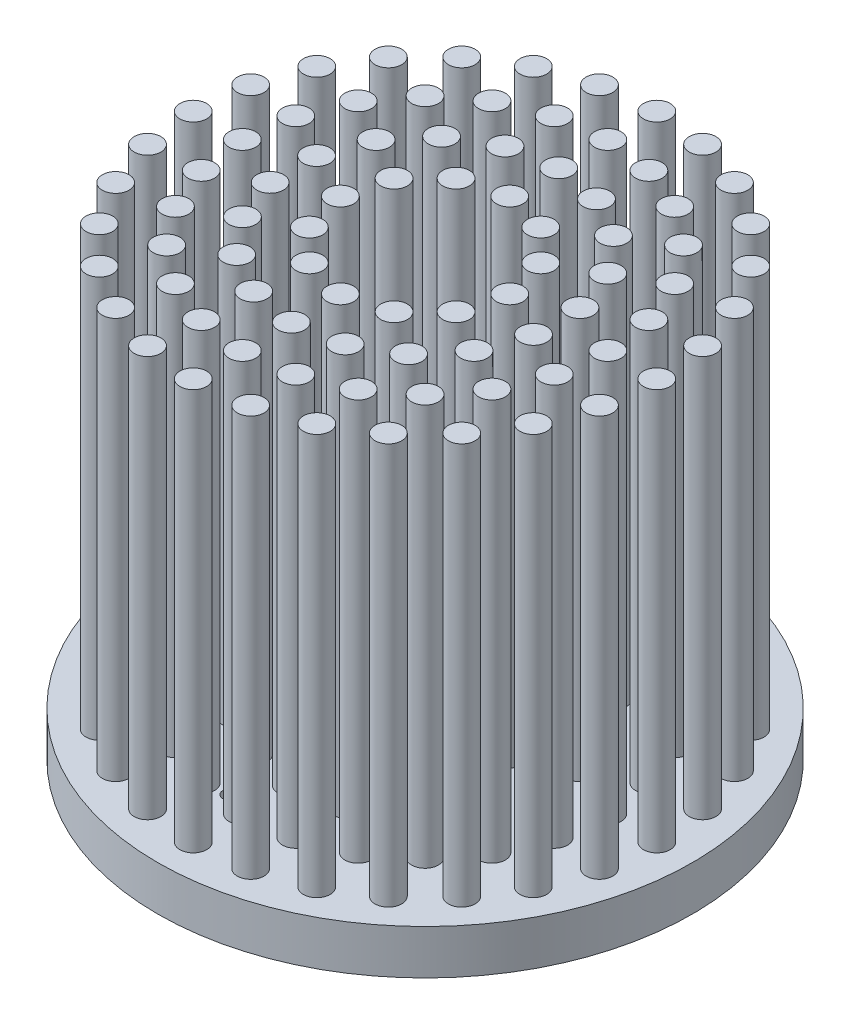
ISO-10303-21;
HEADER;
FILE_DESCRIPTION(('STEP AP214'),'2;1');
FILE_NAME('part.step','',(''),(''),'','','');
FILE_SCHEMA(('AUTOMOTIVE_DESIGN { 1 0 10303 214 1 1 1 1 }'));
ENDSEC;
DATA;
#1=APPLICATION_CONTEXT('core data for automotive mechanical design processes');
#2=APPLICATION_PROTOCOL_DEFINITION('international standard','automotive_design',2000,#1);
#3=PRODUCT_CONTEXT('',#1,'mechanical');
#4=PRODUCT('Part','Part','',(#3));
#5=PRODUCT_RELATED_PRODUCT_CATEGORY('part','',(#4));
#6=PRODUCT_DEFINITION_FORMATION('','',#4);
#7=PRODUCT_DEFINITION_CONTEXT('part definition',#1,'design');
#8=PRODUCT_DEFINITION('design','',#6,#7);
#9=PRODUCT_DEFINITION_SHAPE('','',#8);
#10=(LENGTH_UNIT() NAMED_UNIT(*) SI_UNIT(.MILLI.,.METRE.));
#11=(NAMED_UNIT(*) PLANE_ANGLE_UNIT() SI_UNIT($,.RADIAN.));
#12=(NAMED_UNIT(*) SI_UNIT($,.STERADIAN.) SOLID_ANGLE_UNIT());
#13=UNCERTAINTY_MEASURE_WITH_UNIT(LENGTH_MEASURE(1.E-05),#10,'distance_accuracy_value','');
#14=(GEOMETRIC_REPRESENTATION_CONTEXT(3) GLOBAL_UNCERTAINTY_ASSIGNED_CONTEXT((#13)) GLOBAL_UNIT_ASSIGNED_CONTEXT((#10,
#11,#12)) REPRESENTATION_CONTEXT('',''));
#15=CARTESIAN_POINT('',(0.,0.,0.));
#16=DIRECTION('',(0.,0.,1.));
#17=DIRECTION('',(1.,0.,0.));
#18=AXIS2_PLACEMENT_3D('',#15,#16,#17);
#19=CARTESIAN_POINT('',(0.,3.,0.));
#20=DIRECTION('',(0.,-1.,0.));
#21=DIRECTION('',(0.,0.,-1.));
#22=AXIS2_PLACEMENT_3D('',#19,#20,#21);
#23=CYLINDRICAL_SURFACE('',#22,30.);
#24=CARTESIAN_POINT('',(0.,0.,0.));
#25=DIRECTION('',(0.,1.,0.));
#26=DIRECTION('',(0.,0.,1.));
#27=AXIS2_PLACEMENT_3D('',#24,#25,#26);
#28=CIRCLE('',#27,30.);
#29=CARTESIAN_POINT('',(0.,0.,30.));
#30=VERTEX_POINT('',#29);
#31=EDGE_CURVE('E10',#30,#30,#28,.T.);
#32=ORIENTED_EDGE('',*,*,#31,.T.);
#33=EDGE_LOOP('',(#32));
#34=FACE_BOUND('',#33,.T.);
#35=CARTESIAN_POINT('',(0.,5.,0.));
#36=DIRECTION('',(0.,1.,0.));
#37=DIRECTION('',(0.,0.,1.));
#38=AXIS2_PLACEMENT_3D('',#35,#36,#37);
#39=CIRCLE('',#38,30.);
#40=CARTESIAN_POINT('',(0.,5.,30.));
#41=VERTEX_POINT('',#40);
#42=EDGE_CURVE('E54',#41,#41,#39,.T.);
#43=ORIENTED_EDGE('',*,*,#42,.F.);
#44=EDGE_LOOP('',(#43));
#45=FACE_BOUND('',#44,.T.);
#46=ADVANCED_FACE('F35',(#34,#45),#23,.T.);
#47=CARTESIAN_POINT('',(0.,0.,0.));
#48=DIRECTION('',(0.,1.,0.));
#49=DIRECTION('',(0.,0.,1.));
#50=AXIS2_PLACEMENT_3D('',#47,#48,#49);
#51=PLANE('',#50);
#52=CARTESIAN_POINT('',(0.,0.,0.));
#53=DIRECTION('',(0.,-1.,0.));
#54=DIRECTION('',(0.,0.,-1.));
#55=AXIS2_PLACEMENT_3D('',#52,#53,#54);
#56=CIRCLE('',#55,5.75);
#57=CARTESIAN_POINT('',(0.,0.,-5.75));
#58=VERTEX_POINT('',#57);
#59=EDGE_CURVE('E71',#58,#58,#56,.T.);
#60=ORIENTED_EDGE('',*,*,#59,.F.);
#61=EDGE_LOOP('',(#60));
#62=FACE_BOUND('',#61,.T.);
#63=CARTESIAN_POINT('',(18.0156508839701,0.,-7.4623269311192));
#64=DIRECTION('',(0.,-1.,0.));
#65=DIRECTION('',(0.,0.,-1.));
#66=AXIS2_PLACEMENT_3D('',#63,#64,#65);
#67=CIRCLE('',#66,0.799999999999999);
#68=CARTESIAN_POINT('',(18.0156508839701,0.,-8.2623269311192));
#69=VERTEX_POINT('',#68);
#70=EDGE_CURVE('E61',#69,#69,#67,.T.);
#71=ORIENTED_EDGE('',*,*,#70,.F.);
#72=EDGE_LOOP('',(#71));
#73=FACE_BOUND('',#72,.T.);
#74=CARTESIAN_POINT('',(-15.470390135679,0.,-11.8708478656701));
#75=DIRECTION('',(0.,-1.,0.));
#76=DIRECTION('',(0.,0.,-1.));
#77=AXIS2_PLACEMENT_3D('',#74,#75,#76);
#78=CIRCLE('',#77,0.799999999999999);
#79=CARTESIAN_POINT('',(-15.470390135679,0.,-12.6708478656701));
#80=VERTEX_POINT('',#79);
#81=EDGE_CURVE('E58',#80,#80,#78,.T.);
#82=ORIENTED_EDGE('',*,*,#81,.F.);
#83=EDGE_LOOP('',(#82));
#84=FACE_BOUND('',#83,.T.);
#85=CARTESIAN_POINT('',(-2.54526074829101,0.,19.3331747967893));
#86=DIRECTION('',(0.,-1.,0.));
#87=DIRECTION('',(0.,0.,-1.));
#88=AXIS2_PLACEMENT_3D('',#85,#86,#87);
#89=CIRCLE('',#88,0.799999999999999);
#90=CARTESIAN_POINT('',(-2.54526074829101,0.,18.5331747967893));
#91=VERTEX_POINT('',#90);
#92=EDGE_CURVE('E55',#91,#91,#89,.T.);
#93=ORIENTED_EDGE('',*,*,#92,.F.);
#94=EDGE_LOOP('',(#93));
#95=FACE_BOUND('',#94,.T.);
#96=ORIENTED_EDGE('',*,*,#31,.F.);
#97=EDGE_LOOP('',(#96));
#98=FACE_BOUND('',#97,.T.);
#99=ADVANCED_FACE('F585',(#62,#73,#84,#95,#98),#51,.F.);
#100=CARTESIAN_POINT('',(0.,5.,0.));
#101=DIRECTION('',(0.,1.,0.));
#102=DIRECTION('',(0.,0.,1.));
#103=AXIS2_PLACEMENT_3D('',#100,#101,#102);
#104=PLANE('',#103);
#105=CARTESIAN_POINT('',(0.,5.,0.));
#106=DIRECTION('',(0.,1.,0.));
#107=DIRECTION('',(0.,0.,1.));
#108=AXIS2_PLACEMENT_3D('',#105,#106,#107);
#109=CIRCLE('',#108,5.75);
#110=CARTESIAN_POINT('',(0.,5.,5.75));
#111=VERTEX_POINT('',#110);
#112=EDGE_CURVE('E38',#111,#111,#109,.T.);
#113=ORIENTED_EDGE('',*,*,#112,.F.);
#114=EDGE_LOOP('',(#113));
#115=FACE_BOUND('',#114,.T.);
#116=CARTESIAN_POINT('',(18.0156508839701,5.,-7.4623269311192));
#117=DIRECTION('',(0.,1.,0.));
#118=DIRECTION('',(0.,0.,1.));
#119=AXIS2_PLACEMENT_3D('',#116,#117,#118);
#120=CIRCLE('',#119,0.799999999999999);
#121=CARTESIAN_POINT('',(18.0156508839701,5.,-6.66232693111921));
#122=VERTEX_POINT('',#121);
#123=EDGE_CURVE('E59',#122,#122,#120,.T.);
#124=ORIENTED_EDGE('',*,*,#123,.F.);
#125=EDGE_LOOP('',(#124));
#126=FACE_BOUND('',#125,.T.);
#127=CARTESIAN_POINT('',(-15.470390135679,5.,-11.8708478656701));
#128=DIRECTION('',(0.,1.,0.));
#129=DIRECTION('',(0.,0.,1.));
#130=AXIS2_PLACEMENT_3D('',#127,#128,#129);
#131=CIRCLE('',#130,0.799999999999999);
#132=CARTESIAN_POINT('',(-15.470390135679,5.,-11.0708478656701));
#133=VERTEX_POINT('',#132);
#134=EDGE_CURVE('E56',#133,#133,#131,.T.);
#135=ORIENTED_EDGE('',*,*,#134,.F.);
#136=EDGE_LOOP('',(#135));
#137=FACE_BOUND('',#136,.T.);
#138=CARTESIAN_POINT('',(-2.54526074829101,5.,19.3331747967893));
#139=DIRECTION('',(0.,1.,0.));
#140=DIRECTION('',(0.,0.,1.));
#141=AXIS2_PLACEMENT_3D('',#138,#139,#140);
#142=CIRCLE('',#141,0.799999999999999);
#143=CARTESIAN_POINT('',(-2.54526074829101,5.,20.1331747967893));
#144=VERTEX_POINT('',#143);
#145=EDGE_CURVE('E51',#144,#144,#142,.T.);
#146=ORIENTED_EDGE('',*,*,#145,.F.);
#147=EDGE_LOOP('',(#146));
#148=FACE_BOUND('',#147,.T.);
#149=CARTESIAN_POINT('',(4.75000000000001,5.,-8.22724133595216));
#150=DIRECTION('',(0.,1.,0.));
#151=DIRECTION('',(0.,0.,1.));
#152=AXIS2_PLACEMENT_3D('',#149,#150,#151);
#153=CIRCLE('',#152,1.5);
#154=CARTESIAN_POINT('',(4.75000000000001,5.,-6.72724133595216));
#155=VERTEX_POINT('',#154);
#156=EDGE_CURVE('E318',#155,#155,#153,.T.);
#157=ORIENTED_EDGE('',*,*,#156,.F.);
#158=EDGE_LOOP('',(#157));
#159=FACE_BOUND('',#158,.T.);
#160=CARTESIAN_POINT('',(9.5,5.,0.));
#161=DIRECTION('',(0.,1.,0.));
#162=DIRECTION('',(0.,0.,1.));
#163=AXIS2_PLACEMENT_3D('',#160,#161,#162);
#164=CIRCLE('',#163,1.5);
#165=CARTESIAN_POINT('',(9.5,5.,1.50000000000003));
#166=VERTEX_POINT('',#165);
#167=EDGE_CURVE('E312',#166,#166,#164,.T.);
#168=ORIENTED_EDGE('',*,*,#167,.F.);
#169=EDGE_LOOP('',(#168));
#170=FACE_BOUND('',#169,.T.);
#171=CARTESIAN_POINT('',(4.74999999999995,5.,8.2272413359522));
#172=DIRECTION('',(0.,1.,0.));
#173=DIRECTION('',(0.,0.,1.));
#174=AXIS2_PLACEMENT_3D('',#171,#172,#173);
#175=CIRCLE('',#174,1.5);
#176=CARTESIAN_POINT('',(4.74999999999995,5.,9.7272413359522));
#177=VERTEX_POINT('',#176);
#178=EDGE_CURVE('E306',#177,#177,#175,.T.);
#179=ORIENTED_EDGE('',*,*,#178,.F.);
#180=EDGE_LOOP('',(#179));
#181=FACE_BOUND('',#180,.T.);
#182=CARTESIAN_POINT('',(-4.75000000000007,5.,8.22724133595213));
#183=DIRECTION('',(0.,1.,0.));
#184=DIRECTION('',(0.,0.,1.));
#185=AXIS2_PLACEMENT_3D('',#182,#183,#184);
#186=CIRCLE('',#185,1.5);
#187=CARTESIAN_POINT('',(-4.75000000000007,5.,9.72724133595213));
#188=VERTEX_POINT('',#187);
#189=EDGE_CURVE('E300',#188,#188,#186,.T.);
#190=ORIENTED_EDGE('',*,*,#189,.F.);
#191=EDGE_LOOP('',(#190));
#192=FACE_BOUND('',#191,.T.);
#193=CARTESIAN_POINT('',(-9.5,5.,0.));
#194=DIRECTION('',(0.,1.,0.));
#195=DIRECTION('',(0.,0.,1.));
#196=AXIS2_PLACEMENT_3D('',#193,#194,#195);
#197=CIRCLE('',#196,1.5);
#198=CARTESIAN_POINT('',(-9.5,5.,1.4999999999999));
#199=VERTEX_POINT('',#198);
#200=EDGE_CURVE('E294',#199,#199,#197,.T.);
#201=ORIENTED_EDGE('',*,*,#200,.F.);
#202=EDGE_LOOP('',(#201));
#203=FACE_BOUND('',#202,.T.);
#204=CARTESIAN_POINT('',(-4.7499999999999,5.,-8.22724133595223));
#205=DIRECTION('',(0.,1.,0.));
#206=DIRECTION('',(0.,0.,1.));
#207=AXIS2_PLACEMENT_3D('',#204,#205,#206);
#208=CIRCLE('',#207,1.5);
#209=CARTESIAN_POINT('',(-4.7499999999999,5.,-6.72724133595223));
#210=VERTEX_POINT('',#209);
#211=EDGE_CURVE('E288',#210,#210,#208,.T.);
#212=ORIENTED_EDGE('',*,*,#211,.F.);
#213=EDGE_LOOP('',(#212));
#214=FACE_BOUND('',#213,.T.);
#215=CARTESIAN_POINT('',(5.13030214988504,5.,-14.0953893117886));
#216=DIRECTION('',(0.,1.,0.));
#217=DIRECTION('',(0.,0.,1.));
#218=AXIS2_PLACEMENT_3D('',#215,#216,#217);
#219=CIRCLE('',#218,1.5);
#220=CARTESIAN_POINT('',(5.13030214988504,5.,-12.5953893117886));
#221=VERTEX_POINT('',#220);
#222=EDGE_CURVE('E282',#221,#221,#219,.T.);
#223=ORIENTED_EDGE('',*,*,#222,.F.);
#224=EDGE_LOOP('',(#223));
#225=FACE_BOUND('',#224,.T.);
#226=CARTESIAN_POINT('',(12.9903810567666,5.,-7.49999999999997));
#227=DIRECTION('',(0.,1.,0.));
#228=DIRECTION('',(0.,0.,1.));
#229=AXIS2_PLACEMENT_3D('',#226,#227,#228);
#230=CIRCLE('',#229,1.5);
#231=CARTESIAN_POINT('',(12.9903810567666,5.,-5.99999999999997));
#232=VERTEX_POINT('',#231);
#233=EDGE_CURVE('E276',#232,#232,#230,.T.);
#234=ORIENTED_EDGE('',*,*,#233,.F.);
#235=EDGE_LOOP('',(#234));
#236=FACE_BOUND('',#235,.T.);
#237=CARTESIAN_POINT('',(14.7721162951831,5.,2.60472266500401));
#238=DIRECTION('',(0.,1.,0.));
#239=DIRECTION('',(0.,0.,1.));
#240=AXIS2_PLACEMENT_3D('',#237,#238,#239);
#241=CIRCLE('',#240,1.5);
#242=CARTESIAN_POINT('',(14.7721162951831,5.,4.10472266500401));
#243=VERTEX_POINT('',#242);
#244=EDGE_CURVE('E270',#243,#243,#241,.T.);
#245=ORIENTED_EDGE('',*,*,#244,.F.);
#246=EDGE_LOOP('',(#245));
#247=FACE_BOUND('',#246,.T.);
#248=CARTESIAN_POINT('',(9.64181414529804,5.,11.4906666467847));
#249=DIRECTION('',(0.,1.,0.));
#250=DIRECTION('',(0.,0.,1.));
#251=AXIS2_PLACEMENT_3D('',#248,#249,#250);
#252=CIRCLE('',#251,1.5);
#253=CARTESIAN_POINT('',(9.64181414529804,5.,12.9906666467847));
#254=VERTEX_POINT('',#253);
#255=EDGE_CURVE('E264',#254,#254,#252,.T.);
#256=ORIENTED_EDGE('',*,*,#255,.F.);
#257=EDGE_LOOP('',(#256));
#258=FACE_BOUND('',#257,.T.);
#259=CARTESIAN_POINT('',(0.,5.,15.));
#260=DIRECTION('',(0.,1.,0.));
#261=DIRECTION('',(0.,0.,1.));
#262=AXIS2_PLACEMENT_3D('',#259,#260,#261);
#263=CIRCLE('',#262,1.5);
#264=CARTESIAN_POINT('',(0.,5.,16.5));
#265=VERTEX_POINT('',#264);
#266=EDGE_CURVE('E258',#265,#265,#263,.T.);
#267=ORIENTED_EDGE('',*,*,#266,.F.);
#268=EDGE_LOOP('',(#267));
#269=FACE_BOUND('',#268,.T.);
#270=CARTESIAN_POINT('',(-9.64181414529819,5.,11.4906666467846));
#271=DIRECTION('',(0.,1.,0.));
#272=DIRECTION('',(0.,0.,1.));
#273=AXIS2_PLACEMENT_3D('',#270,#271,#272);
#274=CIRCLE('',#273,1.5);
#275=CARTESIAN_POINT('',(-9.64181414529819,5.,12.9906666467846));
#276=VERTEX_POINT('',#275);
#277=EDGE_CURVE('E252',#276,#276,#274,.T.);
#278=ORIENTED_EDGE('',*,*,#277,.F.);
#279=EDGE_LOOP('',(#278));
#280=FACE_BOUND('',#279,.T.);
#281=CARTESIAN_POINT('',(-14.7721162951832,5.,2.60472266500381));
#282=DIRECTION('',(0.,1.,0.));
#283=DIRECTION('',(0.,0.,1.));
#284=AXIS2_PLACEMENT_3D('',#281,#282,#283);
#285=CIRCLE('',#284,1.5);
#286=CARTESIAN_POINT('',(-14.7721162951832,5.,4.10472266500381));
#287=VERTEX_POINT('',#286);
#288=EDGE_CURVE('E246',#287,#287,#285,.T.);
#289=ORIENTED_EDGE('',*,*,#288,.F.);
#290=EDGE_LOOP('',(#289));
#291=FACE_BOUND('',#290,.T.);
#292=CARTESIAN_POINT('',(-12.9903810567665,5.,-7.50000000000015));
#293=DIRECTION('',(0.,1.,0.));
#294=DIRECTION('',(0.,0.,1.));
#295=AXIS2_PLACEMENT_3D('',#292,#293,#294);
#296=CIRCLE('',#295,1.5);
#297=CARTESIAN_POINT('',(-12.9903810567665,5.,-6.00000000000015));
#298=VERTEX_POINT('',#297);
#299=EDGE_CURVE('E240',#298,#298,#296,.T.);
#300=ORIENTED_EDGE('',*,*,#299,.F.);
#301=EDGE_LOOP('',(#300));
#302=FACE_BOUND('',#301,.T.);
#303=CARTESIAN_POINT('',(-5.13030214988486,5.,-14.0953893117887));
#304=DIRECTION('',(0.,1.,0.));
#305=DIRECTION('',(0.,0.,1.));
#306=AXIS2_PLACEMENT_3D('',#303,#304,#305);
#307=CIRCLE('',#306,1.5);
#308=CARTESIAN_POINT('',(-5.13030214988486,5.,-12.5953893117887));
#309=VERTEX_POINT('',#308);
#310=EDGE_CURVE('E234',#309,#309,#307,.T.);
#311=ORIENTED_EDGE('',*,*,#310,.F.);
#312=EDGE_LOOP('',(#311));
#313=FACE_BOUND('',#312,.T.);
#314=CARTESIAN_POINT('',(5.30579042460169,5.,-19.8014794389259));
#315=DIRECTION('',(0.,1.,0.));
#316=DIRECTION('',(0.,0.,1.));
#317=AXIS2_PLACEMENT_3D('',#314,#315,#316);
#318=CIRCLE('',#317,1.5);
#319=CARTESIAN_POINT('',(5.30579042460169,5.,-18.3014794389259));
#320=VERTEX_POINT('',#319);
#321=EDGE_CURVE('E228',#320,#320,#318,.T.);
#322=ORIENTED_EDGE('',*,*,#321,.F.);
#323=EDGE_LOOP('',(#322));
#324=FACE_BOUND('',#323,.T.);
#325=CARTESIAN_POINT('',(14.4956890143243,5.,-14.4956890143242));
#326=DIRECTION('',(0.,1.,0.));
#327=DIRECTION('',(0.,0.,1.));
#328=AXIS2_PLACEMENT_3D('',#325,#326,#327);
#329=CIRCLE('',#328,1.5);
#330=CARTESIAN_POINT('',(14.4956890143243,5.,-12.9956890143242));
#331=VERTEX_POINT('',#330);
#332=EDGE_CURVE('E222',#331,#331,#329,.T.);
#333=ORIENTED_EDGE('',*,*,#332,.F.);
#334=EDGE_LOOP('',(#333));
#335=FACE_BOUND('',#334,.T.);
#336=CARTESIAN_POINT('',(19.8014794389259,5.,-5.30579042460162));
#337=DIRECTION('',(0.,1.,0.));
#338=DIRECTION('',(0.,0.,1.));
#339=AXIS2_PLACEMENT_3D('',#336,#337,#338);
#340=CIRCLE('',#339,1.5);
#341=CARTESIAN_POINT('',(19.8014794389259,5.,-3.80579042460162));
#342=VERTEX_POINT('',#341);
#343=EDGE_CURVE('E216',#342,#342,#340,.T.);
#344=ORIENTED_EDGE('',*,*,#343,.F.);
#345=EDGE_LOOP('',(#344));
#346=FACE_BOUND('',#345,.T.);
#347=CARTESIAN_POINT('',(19.8014794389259,5.,5.30579042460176));
#348=DIRECTION('',(0.,1.,0.));
#349=DIRECTION('',(0.,0.,1.));
#350=AXIS2_PLACEMENT_3D('',#347,#348,#349);
#351=CIRCLE('',#350,1.5);
#352=CARTESIAN_POINT('',(19.8014794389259,5.,6.80579042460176));
#353=VERTEX_POINT('',#352);
#354=EDGE_CURVE('E210',#353,#353,#351,.T.);
#355=ORIENTED_EDGE('',*,*,#354,.F.);
#356=EDGE_LOOP('',(#355));
#357=FACE_BOUND('',#356,.T.);
#358=CARTESIAN_POINT('',(14.4956890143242,5.,14.4956890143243));
#359=DIRECTION('',(0.,1.,0.));
#360=DIRECTION('',(0.,0.,1.));
#361=AXIS2_PLACEMENT_3D('',#358,#359,#360);
#362=CIRCLE('',#361,1.5);
#363=CARTESIAN_POINT('',(14.4956890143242,5.,15.9956890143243));
#364=VERTEX_POINT('',#363);
#365=EDGE_CURVE('E204',#364,#364,#362,.T.);
#366=ORIENTED_EDGE('',*,*,#365,.F.);
#367=EDGE_LOOP('',(#366));
#368=FACE_BOUND('',#367,.T.);
#369=CARTESIAN_POINT('',(5.30579042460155,5.,19.8014794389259));
#370=DIRECTION('',(0.,1.,0.));
#371=DIRECTION('',(0.,0.,1.));
#372=AXIS2_PLACEMENT_3D('',#369,#370,#371);
#373=CIRCLE('',#372,1.5);
#374=CARTESIAN_POINT('',(5.30579042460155,5.,21.3014794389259));
#375=VERTEX_POINT('',#374);
#376=EDGE_CURVE('E198',#375,#375,#373,.T.);
#377=ORIENTED_EDGE('',*,*,#376,.F.);
#378=EDGE_LOOP('',(#377));
#379=FACE_BOUND('',#378,.T.);
#380=CARTESIAN_POINT('',(-5.30579042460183,5.,19.8014794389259));
#381=DIRECTION('',(0.,1.,0.));
#382=DIRECTION('',(0.,0.,1.));
#383=AXIS2_PLACEMENT_3D('',#380,#381,#382);
#384=CIRCLE('',#383,1.5);
#385=CARTESIAN_POINT('',(-5.30579042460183,5.,21.3014794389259));
#386=VERTEX_POINT('',#385);
#387=EDGE_CURVE('E192',#386,#386,#384,.T.);
#388=ORIENTED_EDGE('',*,*,#387,.F.);
#389=EDGE_LOOP('',(#388));
#390=FACE_BOUND('',#389,.T.);
#391=CARTESIAN_POINT('',(-14.4956890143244,5.,14.4956890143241));
#392=DIRECTION('',(0.,1.,0.));
#393=DIRECTION('',(0.,0.,1.));
#394=AXIS2_PLACEMENT_3D('',#391,#392,#393);
#395=CIRCLE('',#394,1.5);
#396=CARTESIAN_POINT('',(-14.4956890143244,5.,15.9956890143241));
#397=VERTEX_POINT('',#396);
#398=EDGE_CURVE('E186',#397,#397,#395,.T.);
#399=ORIENTED_EDGE('',*,*,#398,.F.);
#400=EDGE_LOOP('',(#399));
#401=FACE_BOUND('',#400,.T.);
#402=CARTESIAN_POINT('',(-19.801479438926,5.,5.30579042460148));
#403=DIRECTION('',(0.,1.,0.));
#404=DIRECTION('',(0.,0.,1.));
#405=AXIS2_PLACEMENT_3D('',#402,#403,#404);
#406=CIRCLE('',#405,1.5);
#407=CARTESIAN_POINT('',(-19.801479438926,5.,6.80579042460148));
#408=VERTEX_POINT('',#407);
#409=EDGE_CURVE('E180',#408,#408,#406,.T.);
#410=ORIENTED_EDGE('',*,*,#409,.F.);
#411=EDGE_LOOP('',(#410));
#412=FACE_BOUND('',#411,.T.);
#413=CARTESIAN_POINT('',(-19.8014794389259,5.,-5.3057904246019));
#414=DIRECTION('',(0.,1.,0.));
#415=DIRECTION('',(0.,0.,1.));
#416=AXIS2_PLACEMENT_3D('',#413,#414,#415);
#417=CIRCLE('',#416,1.5);
#418=CARTESIAN_POINT('',(-19.8014794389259,5.,-3.80579042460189));
#419=VERTEX_POINT('',#418);
#420=EDGE_CURVE('E174',#419,#419,#417,.T.);
#421=ORIENTED_EDGE('',*,*,#420,.F.);
#422=EDGE_LOOP('',(#421));
#423=FACE_BOUND('',#422,.T.);
#424=CARTESIAN_POINT('',(-14.4956890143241,5.,-14.4956890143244));
#425=DIRECTION('',(0.,1.,0.));
#426=DIRECTION('',(0.,0.,1.));
#427=AXIS2_PLACEMENT_3D('',#424,#425,#426);
#428=CIRCLE('',#427,1.5);
#429=CARTESIAN_POINT('',(-14.4956890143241,5.,-12.9956890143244));
#430=VERTEX_POINT('',#429);
#431=EDGE_CURVE('E168',#430,#430,#428,.T.);
#432=ORIENTED_EDGE('',*,*,#431,.F.);
#433=EDGE_LOOP('',(#432));
#434=FACE_BOUND('',#433,.T.);
#435=CARTESIAN_POINT('',(-5.30579042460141,5.,-19.801479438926));
#436=DIRECTION('',(0.,1.,0.));
#437=DIRECTION('',(0.,0.,1.));
#438=AXIS2_PLACEMENT_3D('',#435,#436,#437);
#439=CIRCLE('',#438,1.5);
#440=CARTESIAN_POINT('',(-5.30579042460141,5.,-18.301479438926));
#441=VERTEX_POINT('',#440);
#442=EDGE_CURVE('E162',#441,#441,#439,.T.);
#443=ORIENTED_EDGE('',*,*,#442,.F.);
#444=EDGE_LOOP('',(#443));
#445=FACE_BOUND('',#444,.T.);
#446=CARTESIAN_POINT('',(5.78554428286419,5.,-25.3481257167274));
#447=DIRECTION('',(0.,1.,0.));
#448=DIRECTION('',(0.,0.,1.));
#449=AXIS2_PLACEMENT_3D('',#446,#447,#448);
#450=CIRCLE('',#449,1.5);
#451=CARTESIAN_POINT('',(5.78554428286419,5.,-23.8481257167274));
#452=VERTEX_POINT('',#451);
#453=EDGE_CURVE('E156',#452,#452,#450,.T.);
#454=ORIENTED_EDGE('',*,*,#453,.F.);
#455=EDGE_LOOP('',(#454));
#456=FACE_BOUND('',#455,.T.);
#457=CARTESIAN_POINT('',(16.2107348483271,5.,-20.3276185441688));
#458=DIRECTION('',(0.,1.,0.));
#459=DIRECTION('',(0.,0.,1.));
#460=AXIS2_PLACEMENT_3D('',#457,#458,#459);
#461=CIRCLE('',#460,1.5);
#462=CARTESIAN_POINT('',(16.2107348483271,5.,-18.8276185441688));
#463=VERTEX_POINT('',#462);
#464=EDGE_CURVE('E150',#463,#463,#461,.T.);
#465=ORIENTED_EDGE('',*,*,#464,.F.);
#466=EDGE_LOOP('',(#465));
#467=FACE_BOUND('',#466,.T.);
#468=CARTESIAN_POINT('',(23.4251905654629,5.,-11.2809772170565));
#469=DIRECTION('',(0.,1.,0.));
#470=DIRECTION('',(0.,0.,1.));
#471=AXIS2_PLACEMENT_3D('',#468,#469,#470);
#472=CIRCLE('',#471,1.5);
#473=CARTESIAN_POINT('',(23.4251905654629,5.,-9.78097721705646));
#474=VERTEX_POINT('',#473);
#475=EDGE_CURVE('E144',#474,#474,#472,.T.);
#476=ORIENTED_EDGE('',*,*,#475,.F.);
#477=EDGE_LOOP('',(#476));
#478=FACE_BOUND('',#477,.T.);
#479=CARTESIAN_POINT('',(26.,5.,0.));
#480=DIRECTION('',(0.,1.,0.));
#481=DIRECTION('',(0.,0.,1.));
#482=AXIS2_PLACEMENT_3D('',#479,#480,#481);
#483=CIRCLE('',#482,1.5);
#484=CARTESIAN_POINT('',(26.,5.,1.50000000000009));
#485=VERTEX_POINT('',#484);
#486=EDGE_CURVE('E138',#485,#485,#483,.T.);
#487=ORIENTED_EDGE('',*,*,#486,.F.);
#488=EDGE_LOOP('',(#487));
#489=FACE_BOUND('',#488,.T.);
#490=CARTESIAN_POINT('',(23.4251905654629,5.,11.2809772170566));
#491=DIRECTION('',(0.,1.,0.));
#492=DIRECTION('',(0.,0.,1.));
#493=AXIS2_PLACEMENT_3D('',#490,#491,#492);
#494=CIRCLE('',#493,1.5);
#495=CARTESIAN_POINT('',(23.4251905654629,5.,12.7809772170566));
#496=VERTEX_POINT('',#495);
#497=EDGE_CURVE('E132',#496,#496,#494,.T.);
#498=ORIENTED_EDGE('',*,*,#497,.F.);
#499=EDGE_LOOP('',(#498));
#500=FACE_BOUND('',#499,.T.);
#501=CARTESIAN_POINT('',(16.210734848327,5.,20.3276185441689));
#502=DIRECTION('',(0.,1.,0.));
#503=DIRECTION('',(0.,0.,1.));
#504=AXIS2_PLACEMENT_3D('',#501,#502,#503);
#505=CIRCLE('',#504,1.5);
#506=CARTESIAN_POINT('',(16.210734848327,5.,21.8276185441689));
#507=VERTEX_POINT('',#506);
#508=EDGE_CURVE('E126',#507,#507,#505,.T.);
#509=ORIENTED_EDGE('',*,*,#508,.F.);
#510=EDGE_LOOP('',(#509));
#511=FACE_BOUND('',#510,.T.);
#512=CARTESIAN_POINT('',(5.78554428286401,5.,25.3481257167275));
#513=DIRECTION('',(0.,1.,0.));
#514=DIRECTION('',(0.,0.,1.));
#515=AXIS2_PLACEMENT_3D('',#512,#513,#514);
#516=CIRCLE('',#515,1.5);
#517=CARTESIAN_POINT('',(5.78554428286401,5.,26.8481257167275));
#518=VERTEX_POINT('',#517);
#519=EDGE_CURVE('E120',#518,#518,#516,.T.);
#520=ORIENTED_EDGE('',*,*,#519,.F.);
#521=EDGE_LOOP('',(#520));
#522=FACE_BOUND('',#521,.T.);
#523=CARTESIAN_POINT('',(-5.78554428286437,5.,25.3481257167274));
#524=DIRECTION('',(0.,1.,0.));
#525=DIRECTION('',(0.,0.,1.));
#526=AXIS2_PLACEMENT_3D('',#523,#524,#525);
#527=CIRCLE('',#526,1.5);
#528=CARTESIAN_POINT('',(-5.78554428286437,5.,26.8481257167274));
#529=VERTEX_POINT('',#528);
#530=EDGE_CURVE('E114',#529,#529,#527,.T.);
#531=ORIENTED_EDGE('',*,*,#530,.F.);
#532=EDGE_LOOP('',(#531));
#533=FACE_BOUND('',#532,.T.);
#534=CARTESIAN_POINT('',(-16.2107348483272,5.,20.3276185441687));
#535=DIRECTION('',(0.,1.,0.));
#536=DIRECTION('',(0.,0.,1.));
#537=AXIS2_PLACEMENT_3D('',#534,#535,#536);
#538=CIRCLE('',#537,1.5);
#539=CARTESIAN_POINT('',(-16.2107348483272,5.,21.8276185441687));
#540=VERTEX_POINT('',#539);
#541=EDGE_CURVE('E108',#540,#540,#538,.T.);
#542=ORIENTED_EDGE('',*,*,#541,.F.);
#543=EDGE_LOOP('',(#542));
#544=FACE_BOUND('',#543,.T.);
#545=CARTESIAN_POINT('',(-23.425190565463,5.,11.2809772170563));
#546=DIRECTION('',(0.,1.,0.));
#547=DIRECTION('',(0.,0.,1.));
#548=AXIS2_PLACEMENT_3D('',#545,#546,#547);
#549=CIRCLE('',#548,1.5);
#550=CARTESIAN_POINT('',(-23.425190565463,5.,12.7809772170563));
#551=VERTEX_POINT('',#550);
#552=EDGE_CURVE('E102',#551,#551,#549,.T.);
#553=ORIENTED_EDGE('',*,*,#552,.F.);
#554=EDGE_LOOP('',(#553));
#555=FACE_BOUND('',#554,.T.);
#556=CARTESIAN_POINT('',(-26.,5.,-2.72335702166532E-13));
#557=DIRECTION('',(0.,1.,0.));
#558=DIRECTION('',(0.,0.,1.));
#559=AXIS2_PLACEMENT_3D('',#556,#557,#558);
#560=CIRCLE('',#559,1.5);
#561=CARTESIAN_POINT('',(-26.,5.,1.49999999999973));
#562=VERTEX_POINT('',#561);
#563=EDGE_CURVE('E96',#562,#562,#560,.T.);
#564=ORIENTED_EDGE('',*,*,#563,.F.);
#565=EDGE_LOOP('',(#564));
#566=FACE_BOUND('',#565,.T.);
#567=CARTESIAN_POINT('',(-23.4251905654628,5.,-11.2809772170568));
#568=DIRECTION('',(0.,1.,0.));
#569=DIRECTION('',(0.,0.,1.));
#570=AXIS2_PLACEMENT_3D('',#567,#568,#569);
#571=CIRCLE('',#570,1.5);
#572=CARTESIAN_POINT('',(-23.4251905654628,5.,-9.78097721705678));
#573=VERTEX_POINT('',#572);
#574=EDGE_CURVE('E90',#573,#573,#571,.T.);
#575=ORIENTED_EDGE('',*,*,#574,.F.);
#576=EDGE_LOOP('',(#575));
#577=FACE_BOUND('',#576,.T.);
#578=CARTESIAN_POINT('',(-16.2107348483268,5.,-20.327618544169));
#579=DIRECTION('',(0.,1.,0.));
#580=DIRECTION('',(0.,0.,1.));
#581=AXIS2_PLACEMENT_3D('',#578,#579,#580);
#582=CIRCLE('',#581,1.5);
#583=CARTESIAN_POINT('',(-16.2107348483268,5.,-18.827618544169));
#584=VERTEX_POINT('',#583);
#585=EDGE_CURVE('E84',#584,#584,#582,.T.);
#586=ORIENTED_EDGE('',*,*,#585,.F.);
#587=EDGE_LOOP('',(#586));
#588=FACE_BOUND('',#587,.T.);
#589=CARTESIAN_POINT('',(-5.78554428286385,5.,-25.3481257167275));
#590=DIRECTION('',(0.,1.,0.));
#591=DIRECTION('',(0.,0.,1.));
#592=AXIS2_PLACEMENT_3D('',#589,#590,#591);
#593=CIRCLE('',#592,1.5);
#594=CARTESIAN_POINT('',(-5.78554428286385,5.,-23.8481257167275));
#595=VERTEX_POINT('',#594);
#596=EDGE_CURVE('E78',#595,#595,#593,.T.);
#597=ORIENTED_EDGE('',*,*,#596,.F.);
#598=EDGE_LOOP('',(#597));
#599=FACE_BOUND('',#598,.T.);
#600=ORIENTED_EDGE('',*,*,#42,.T.);
#601=EDGE_LOOP('',(#600));
#602=FACE_BOUND('',#601,.T.);
#603=CARTESIAN_POINT('',(-11.2809772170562,5.,-23.4251905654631));
#604=DIRECTION('',(0.,1.,0.));
#605=DIRECTION('',(0.,0.,1.));
#606=AXIS2_PLACEMENT_3D('',#603,#604,#605);
#607=CIRCLE('',#606,1.5);
#608=CARTESIAN_POINT('',(-11.2809772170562,5.,-21.9251905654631));
#609=VERTEX_POINT('',#608);
#610=EDGE_CURVE('E81',#609,#609,#607,.T.);
#611=ORIENTED_EDGE('',*,*,#610,.F.);
#612=EDGE_LOOP('',(#611));
#613=FACE_BOUND('',#612,.T.);
#614=CARTESIAN_POINT('',(-20.3276185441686,5.,-16.2107348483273));
#615=DIRECTION('',(0.,1.,0.));
#616=DIRECTION('',(0.,0.,1.));
#617=AXIS2_PLACEMENT_3D('',#614,#615,#616);
#618=CIRCLE('',#617,1.5);
#619=CARTESIAN_POINT('',(-20.3276185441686,5.,-14.7107348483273));
#620=VERTEX_POINT('',#619);
#621=EDGE_CURVE('E87',#620,#620,#618,.T.);
#622=ORIENTED_EDGE('',*,*,#621,.F.);
#623=EDGE_LOOP('',(#622));
#624=FACE_BOUND('',#623,.T.);
#625=CARTESIAN_POINT('',(-25.3481257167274,5.,-5.78554428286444));
#626=DIRECTION('',(0.,1.,0.));
#627=DIRECTION('',(0.,0.,1.));
#628=AXIS2_PLACEMENT_3D('',#625,#626,#627);
#629=CIRCLE('',#628,1.5);
#630=CARTESIAN_POINT('',(-25.3481257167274,5.,-4.28554428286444));
#631=VERTEX_POINT('',#630);
#632=EDGE_CURVE('E93',#631,#631,#629,.T.);
#633=ORIENTED_EDGE('',*,*,#632,.F.);
#634=EDGE_LOOP('',(#633));
#635=FACE_BOUND('',#634,.T.);
#636=CARTESIAN_POINT('',(-25.3481257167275,5.,5.78554428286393));
#637=DIRECTION('',(0.,1.,0.));
#638=DIRECTION('',(0.,0.,1.));
#639=AXIS2_PLACEMENT_3D('',#636,#637,#638);
#640=CIRCLE('',#639,1.5);
#641=CARTESIAN_POINT('',(-25.3481257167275,5.,7.28554428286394));
#642=VERTEX_POINT('',#641);
#643=EDGE_CURVE('E99',#642,#642,#640,.T.);
#644=ORIENTED_EDGE('',*,*,#643,.F.);
#645=EDGE_LOOP('',(#644));
#646=FACE_BOUND('',#645,.T.);
#647=CARTESIAN_POINT('',(-20.3276185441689,5.,16.2107348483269));
#648=DIRECTION('',(0.,1.,0.));
#649=DIRECTION('',(0.,0.,1.));
#650=AXIS2_PLACEMENT_3D('',#647,#648,#649);
#651=CIRCLE('',#650,1.5);
#652=CARTESIAN_POINT('',(-20.3276185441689,5.,17.7107348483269));
#653=VERTEX_POINT('',#652);
#654=EDGE_CURVE('E105',#653,#653,#651,.T.);
#655=ORIENTED_EDGE('',*,*,#654,.F.);
#656=EDGE_LOOP('',(#655));
#657=FACE_BOUND('',#656,.T.);
#658=CARTESIAN_POINT('',(-11.2809772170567,5.,23.4251905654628));
#659=DIRECTION('',(0.,1.,0.));
#660=DIRECTION('',(0.,0.,1.));
#661=AXIS2_PLACEMENT_3D('',#658,#659,#660);
#662=CIRCLE('',#661,1.5);
#663=CARTESIAN_POINT('',(-11.2809772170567,5.,24.9251905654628));
#664=VERTEX_POINT('',#663);
#665=EDGE_CURVE('E111',#664,#664,#662,.T.);
#666=ORIENTED_EDGE('',*,*,#665,.F.);
#667=EDGE_LOOP('',(#666));
#668=FACE_BOUND('',#667,.T.);
#669=CARTESIAN_POINT('',(0.,5.,26.));
#670=DIRECTION('',(0.,1.,0.));
#671=DIRECTION('',(0.,0.,1.));
#672=AXIS2_PLACEMENT_3D('',#669,#670,#671);
#673=CIRCLE('',#672,1.5);
#674=CARTESIAN_POINT('',(0.,5.,27.5));
#675=VERTEX_POINT('',#674);
#676=EDGE_CURVE('E117',#675,#675,#673,.T.);
#677=ORIENTED_EDGE('',*,*,#676,.F.);
#678=EDGE_LOOP('',(#677));
#679=FACE_BOUND('',#678,.T.);
#680=CARTESIAN_POINT('',(11.2809772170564,5.,23.425190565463));
#681=DIRECTION('',(0.,1.,0.));
#682=DIRECTION('',(0.,0.,1.));
#683=AXIS2_PLACEMENT_3D('',#680,#681,#682);
#684=CIRCLE('',#683,1.5);
#685=CARTESIAN_POINT('',(11.2809772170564,5.,24.925190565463));
#686=VERTEX_POINT('',#685);
#687=EDGE_CURVE('E123',#686,#686,#684,.T.);
#688=ORIENTED_EDGE('',*,*,#687,.F.);
#689=EDGE_LOOP('',(#688));
#690=FACE_BOUND('',#689,.T.);
#691=CARTESIAN_POINT('',(20.3276185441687,5.,16.2107348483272));
#692=DIRECTION('',(0.,1.,0.));
#693=DIRECTION('',(0.,0.,1.));
#694=AXIS2_PLACEMENT_3D('',#691,#692,#693);
#695=CIRCLE('',#694,1.5);
#696=CARTESIAN_POINT('',(20.3276185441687,5.,17.7107348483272));
#697=VERTEX_POINT('',#696);
#698=EDGE_CURVE('E129',#697,#697,#695,.T.);
#699=ORIENTED_EDGE('',*,*,#698,.F.);
#700=EDGE_LOOP('',(#699));
#701=FACE_BOUND('',#700,.T.);
#702=CARTESIAN_POINT('',(25.3481257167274,5.,5.78554428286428));
#703=DIRECTION('',(0.,1.,0.));
#704=DIRECTION('',(0.,0.,1.));
#705=AXIS2_PLACEMENT_3D('',#702,#703,#704);
#706=CIRCLE('',#705,1.5);
#707=CARTESIAN_POINT('',(25.3481257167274,5.,7.28554428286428));
#708=VERTEX_POINT('',#707);
#709=EDGE_CURVE('E135',#708,#708,#706,.T.);
#710=ORIENTED_EDGE('',*,*,#709,.F.);
#711=EDGE_LOOP('',(#710));
#712=FACE_BOUND('',#711,.T.);
#713=CARTESIAN_POINT('',(25.3481257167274,5.,-5.7855442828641));
#714=DIRECTION('',(0.,1.,0.));
#715=DIRECTION('',(0.,0.,1.));
#716=AXIS2_PLACEMENT_3D('',#713,#714,#715);
#717=CIRCLE('',#716,1.5);
#718=CARTESIAN_POINT('',(25.3481257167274,5.,-4.2855442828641));
#719=VERTEX_POINT('',#718);
#720=EDGE_CURVE('E141',#719,#719,#717,.T.);
#721=ORIENTED_EDGE('',*,*,#720,.F.);
#722=EDGE_LOOP('',(#721));
#723=FACE_BOUND('',#722,.T.);
#724=CARTESIAN_POINT('',(20.3276185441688,5.,-16.210734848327));
#725=DIRECTION('',(0.,1.,0.));
#726=DIRECTION('',(0.,0.,1.));
#727=AXIS2_PLACEMENT_3D('',#724,#725,#726);
#728=CIRCLE('',#727,1.5);
#729=CARTESIAN_POINT('',(20.3276185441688,5.,-14.710734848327));
#730=VERTEX_POINT('',#729);
#731=EDGE_CURVE('E147',#730,#730,#728,.T.);
#732=ORIENTED_EDGE('',*,*,#731,.F.);
#733=EDGE_LOOP('',(#732));
#734=FACE_BOUND('',#733,.T.);
#735=CARTESIAN_POINT('',(11.2809772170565,5.,-23.4251905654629));
#736=DIRECTION('',(0.,1.,0.));
#737=DIRECTION('',(0.,0.,1.));
#738=AXIS2_PLACEMENT_3D('',#735,#736,#737);
#739=CIRCLE('',#738,1.5);
#740=CARTESIAN_POINT('',(11.2809772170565,5.,-21.9251905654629));
#741=VERTEX_POINT('',#740);
#742=EDGE_CURVE('E153',#741,#741,#739,.T.);
#743=ORIENTED_EDGE('',*,*,#742,.F.);
#744=EDGE_LOOP('',(#743));
#745=FACE_BOUND('',#744,.T.);
#746=CARTESIAN_POINT('',(0.,5.,-26.));
#747=DIRECTION('',(0.,1.,0.));
#748=DIRECTION('',(0.,0.,1.));
#749=AXIS2_PLACEMENT_3D('',#746,#747,#748);
#750=CIRCLE('',#749,1.5);
#751=CARTESIAN_POINT('',(0.,5.,-24.5));
#752=VERTEX_POINT('',#751);
#753=EDGE_CURVE('E159',#752,#752,#750,.T.);
#754=ORIENTED_EDGE('',*,*,#753,.F.);
#755=EDGE_LOOP('',(#754));
#756=FACE_BOUND('',#755,.T.);
#757=CARTESIAN_POINT('',(-10.2499999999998,5.,-17.7535207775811));
#758=DIRECTION('',(0.,1.,0.));
#759=DIRECTION('',(0.,0.,1.));
#760=AXIS2_PLACEMENT_3D('',#757,#758,#759);
#761=CIRCLE('',#760,1.5);
#762=CARTESIAN_POINT('',(-10.2499999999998,5.,-16.2535207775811));
#763=VERTEX_POINT('',#762);
#764=EDGE_CURVE('E165',#763,#763,#761,.T.);
#765=ORIENTED_EDGE('',*,*,#764,.F.);
#766=EDGE_LOOP('',(#765));
#767=FACE_BOUND('',#766,.T.);
#768=CARTESIAN_POINT('',(-17.7535207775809,5.,-10.2500000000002));
#769=DIRECTION('',(0.,1.,0.));
#770=DIRECTION('',(0.,0.,1.));
#771=AXIS2_PLACEMENT_3D('',#768,#769,#770);
#772=CIRCLE('',#771,1.5);
#773=CARTESIAN_POINT('',(-17.7535207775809,5.,-8.75000000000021));
#774=VERTEX_POINT('',#773);
#775=EDGE_CURVE('E171',#774,#774,#772,.T.);
#776=ORIENTED_EDGE('',*,*,#775,.F.);
#777=EDGE_LOOP('',(#776));
#778=FACE_BOUND('',#777,.T.);
#779=CARTESIAN_POINT('',(-20.5,5.,-2.14726226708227E-13));
#780=DIRECTION('',(0.,1.,0.));
#781=DIRECTION('',(0.,0.,1.));
#782=AXIS2_PLACEMENT_3D('',#779,#780,#781);
#783=CIRCLE('',#782,1.5);
#784=CARTESIAN_POINT('',(-20.5,5.,1.49999999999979));
#785=VERTEX_POINT('',#784);
#786=EDGE_CURVE('E177',#785,#785,#783,.T.);
#787=ORIENTED_EDGE('',*,*,#786,.F.);
#788=EDGE_LOOP('',(#787));
#789=FACE_BOUND('',#788,.T.);
#790=CARTESIAN_POINT('',(-17.7535207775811,5.,10.2499999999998));
#791=DIRECTION('',(0.,1.,0.));
#792=DIRECTION('',(0.,0.,1.));
#793=AXIS2_PLACEMENT_3D('',#790,#791,#792);
#794=CIRCLE('',#793,1.5);
#795=CARTESIAN_POINT('',(-17.7535207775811,5.,11.7499999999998));
#796=VERTEX_POINT('',#795);
#797=EDGE_CURVE('E183',#796,#796,#794,.T.);
#798=ORIENTED_EDGE('',*,*,#797,.F.);
#799=EDGE_LOOP('',(#798));
#800=FACE_BOUND('',#799,.T.);
#801=CARTESIAN_POINT('',(-10.2500000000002,5.,17.7535207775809));
#802=DIRECTION('',(0.,1.,0.));
#803=DIRECTION('',(0.,0.,1.));
#804=AXIS2_PLACEMENT_3D('',#801,#802,#803);
#805=CIRCLE('',#804,1.5);
#806=CARTESIAN_POINT('',(-10.2500000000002,5.,19.2535207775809));
#807=VERTEX_POINT('',#806);
#808=EDGE_CURVE('E189',#807,#807,#805,.T.);
#809=ORIENTED_EDGE('',*,*,#808,.F.);
#810=EDGE_LOOP('',(#809));
#811=FACE_BOUND('',#810,.T.);
#812=CARTESIAN_POINT('',(0.,5.,20.5));
#813=DIRECTION('',(0.,1.,0.));
#814=DIRECTION('',(0.,0.,1.));
#815=AXIS2_PLACEMENT_3D('',#812,#813,#814);
#816=CIRCLE('',#815,1.5);
#817=CARTESIAN_POINT('',(0.,5.,22.));
#818=VERTEX_POINT('',#817);
#819=EDGE_CURVE('E195',#818,#818,#816,.T.);
#820=ORIENTED_EDGE('',*,*,#819,.F.);
#821=EDGE_LOOP('',(#820));
#822=FACE_BOUND('',#821,.T.);
#823=CARTESIAN_POINT('',(10.2499999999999,5.,17.7535207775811));
#824=DIRECTION('',(0.,1.,0.));
#825=DIRECTION('',(0.,0.,1.));
#826=AXIS2_PLACEMENT_3D('',#823,#824,#825);
#827=CIRCLE('',#826,1.5);
#828=CARTESIAN_POINT('',(10.2499999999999,5.,19.2535207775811));
#829=VERTEX_POINT('',#828);
#830=EDGE_CURVE('E201',#829,#829,#827,.T.);
#831=ORIENTED_EDGE('',*,*,#830,.F.);
#832=EDGE_LOOP('',(#831));
#833=FACE_BOUND('',#832,.T.);
#834=CARTESIAN_POINT('',(17.753520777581,5.,10.2500000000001));
#835=DIRECTION('',(0.,1.,0.));
#836=DIRECTION('',(0.,0.,1.));
#837=AXIS2_PLACEMENT_3D('',#834,#835,#836);
#838=CIRCLE('',#837,1.5);
#839=CARTESIAN_POINT('',(17.753520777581,5.,11.7500000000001));
#840=VERTEX_POINT('',#839);
#841=EDGE_CURVE('E207',#840,#840,#838,.T.);
#842=ORIENTED_EDGE('',*,*,#841,.F.);
#843=EDGE_LOOP('',(#842));
#844=FACE_BOUND('',#843,.T.);
#845=CARTESIAN_POINT('',(20.5,5.,0.));
#846=DIRECTION('',(0.,1.,0.));
#847=DIRECTION('',(0.,0.,1.));
#848=AXIS2_PLACEMENT_3D('',#845,#846,#847);
#849=CIRCLE('',#848,1.5);
#850=CARTESIAN_POINT('',(20.5,5.,1.50000000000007));
#851=VERTEX_POINT('',#850);
#852=EDGE_CURVE('E213',#851,#851,#849,.T.);
#853=ORIENTED_EDGE('',*,*,#852,.F.);
#854=EDGE_LOOP('',(#853));
#855=FACE_BOUND('',#854,.T.);
#856=CARTESIAN_POINT('',(17.753520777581,5.,-10.25));
#857=DIRECTION('',(0.,1.,0.));
#858=DIRECTION('',(0.,0.,1.));
#859=AXIS2_PLACEMENT_3D('',#856,#857,#858);
#860=CIRCLE('',#859,1.5);
#861=CARTESIAN_POINT('',(17.753520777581,5.,-8.74999999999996));
#862=VERTEX_POINT('',#861);
#863=EDGE_CURVE('E219',#862,#862,#860,.T.);
#864=ORIENTED_EDGE('',*,*,#863,.F.);
#865=EDGE_LOOP('',(#864));
#866=FACE_BOUND('',#865,.T.);
#867=CARTESIAN_POINT('',(10.25,5.,-17.753520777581));
#868=DIRECTION('',(0.,1.,0.));
#869=DIRECTION('',(0.,0.,1.));
#870=AXIS2_PLACEMENT_3D('',#867,#868,#869);
#871=CIRCLE('',#870,1.5);
#872=CARTESIAN_POINT('',(10.25,5.,-16.253520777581));
#873=VERTEX_POINT('',#872);
#874=EDGE_CURVE('E225',#873,#873,#871,.T.);
#875=ORIENTED_EDGE('',*,*,#874,.F.);
#876=EDGE_LOOP('',(#875));
#877=FACE_BOUND('',#876,.T.);
#878=CARTESIAN_POINT('',(0.,5.,-20.5));
#879=DIRECTION('',(0.,1.,0.));
#880=DIRECTION('',(0.,0.,1.));
#881=AXIS2_PLACEMENT_3D('',#878,#879,#880);
#882=CIRCLE('',#881,1.5);
#883=CARTESIAN_POINT('',(0.,5.,-19.));
#884=VERTEX_POINT('',#883);
#885=EDGE_CURVE('E231',#884,#884,#882,.T.);
#886=ORIENTED_EDGE('',*,*,#885,.F.);
#887=EDGE_LOOP('',(#886));
#888=FACE_BOUND('',#887,.T.);
#889=CARTESIAN_POINT('',(-9.64181414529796,5.,-11.4906666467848));
#890=DIRECTION('',(0.,1.,0.));
#891=DIRECTION('',(0.,0.,1.));
#892=AXIS2_PLACEMENT_3D('',#889,#890,#891);
#893=CIRCLE('',#892,1.5);
#894=CARTESIAN_POINT('',(-9.64181414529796,5.,-9.99066664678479));
#895=VERTEX_POINT('',#894);
#896=EDGE_CURVE('E237',#895,#895,#893,.T.);
#897=ORIENTED_EDGE('',*,*,#896,.F.);
#898=EDGE_LOOP('',(#897));
#899=FACE_BOUND('',#898,.T.);
#900=CARTESIAN_POINT('',(-14.7721162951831,5.,-2.60472266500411));
#901=DIRECTION('',(0.,1.,0.));
#902=DIRECTION('',(0.,0.,1.));
#903=AXIS2_PLACEMENT_3D('',#900,#901,#902);
#904=CIRCLE('',#903,1.5);
#905=CARTESIAN_POINT('',(-14.7721162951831,5.,-1.10472266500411));
#906=VERTEX_POINT('',#905);
#907=EDGE_CURVE('E243',#906,#906,#904,.T.);
#908=ORIENTED_EDGE('',*,*,#907,.F.);
#909=EDGE_LOOP('',(#908));
#910=FACE_BOUND('',#909,.T.);
#911=CARTESIAN_POINT('',(-12.9903810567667,5.,7.49999999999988));
#912=DIRECTION('',(0.,1.,0.));
#913=DIRECTION('',(0.,0.,1.));
#914=AXIS2_PLACEMENT_3D('',#911,#912,#913);
#915=CIRCLE('',#914,1.5);
#916=CARTESIAN_POINT('',(-12.9903810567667,5.,8.99999999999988));
#917=VERTEX_POINT('',#916);
#918=EDGE_CURVE('E249',#917,#917,#915,.T.);
#919=ORIENTED_EDGE('',*,*,#918,.F.);
#920=EDGE_LOOP('',(#919));
#921=FACE_BOUND('',#920,.T.);
#922=CARTESIAN_POINT('',(-5.13030214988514,5.,14.0953893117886));
#923=DIRECTION('',(0.,1.,0.));
#924=DIRECTION('',(0.,0.,1.));
#925=AXIS2_PLACEMENT_3D('',#922,#923,#924);
#926=CIRCLE('',#925,1.5);
#927=CARTESIAN_POINT('',(-5.13030214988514,5.,15.5953893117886));
#928=VERTEX_POINT('',#927);
#929=EDGE_CURVE('E255',#928,#928,#926,.T.);
#930=ORIENTED_EDGE('',*,*,#929,.F.);
#931=EDGE_LOOP('',(#930));
#932=FACE_BOUND('',#931,.T.);
#933=CARTESIAN_POINT('',(5.13030214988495,5.,14.0953893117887));
#934=DIRECTION('',(0.,1.,0.));
#935=DIRECTION('',(0.,0.,1.));
#936=AXIS2_PLACEMENT_3D('',#933,#934,#935);
#937=CIRCLE('',#936,1.5);
#938=CARTESIAN_POINT('',(5.13030214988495,5.,15.5953893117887));
#939=VERTEX_POINT('',#938);
#940=EDGE_CURVE('E261',#939,#939,#937,.T.);
#941=ORIENTED_EDGE('',*,*,#940,.F.);
#942=EDGE_LOOP('',(#941));
#943=FACE_BOUND('',#942,.T.);
#944=CARTESIAN_POINT('',(12.9903810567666,5.,7.50000000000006));
#945=DIRECTION('',(0.,1.,0.));
#946=DIRECTION('',(0.,0.,1.));
#947=AXIS2_PLACEMENT_3D('',#944,#945,#946);
#948=CIRCLE('',#947,1.5);
#949=CARTESIAN_POINT('',(12.9903810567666,5.,9.00000000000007));
#950=VERTEX_POINT('',#949);
#951=EDGE_CURVE('E267',#950,#950,#948,.T.);
#952=ORIENTED_EDGE('',*,*,#951,.F.);
#953=EDGE_LOOP('',(#952));
#954=FACE_BOUND('',#953,.T.);
#955=CARTESIAN_POINT('',(14.7721162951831,5.,-2.60472266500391));
#956=DIRECTION('',(0.,1.,0.));
#957=DIRECTION('',(0.,0.,1.));
#958=AXIS2_PLACEMENT_3D('',#955,#956,#957);
#959=CIRCLE('',#958,1.5);
#960=CARTESIAN_POINT('',(14.7721162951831,5.,-1.10472266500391));
#961=VERTEX_POINT('',#960);
#962=EDGE_CURVE('E273',#961,#961,#959,.T.);
#963=ORIENTED_EDGE('',*,*,#962,.F.);
#964=EDGE_LOOP('',(#963));
#965=FACE_BOUND('',#964,.T.);
#966=CARTESIAN_POINT('',(9.64181414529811,5.,-11.4906666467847));
#967=DIRECTION('',(0.,1.,0.));
#968=DIRECTION('',(0.,0.,1.));
#969=AXIS2_PLACEMENT_3D('',#966,#967,#968);
#970=CIRCLE('',#969,1.5);
#971=CARTESIAN_POINT('',(9.64181414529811,5.,-9.99066664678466));
#972=VERTEX_POINT('',#971);
#973=EDGE_CURVE('E279',#972,#972,#970,.T.);
#974=ORIENTED_EDGE('',*,*,#973,.F.);
#975=EDGE_LOOP('',(#974));
#976=FACE_BOUND('',#975,.T.);
#977=CARTESIAN_POINT('',(0.,5.,-15.));
#978=DIRECTION('',(0.,1.,0.));
#979=DIRECTION('',(0.,0.,1.));
#980=AXIS2_PLACEMENT_3D('',#977,#978,#979);
#981=CIRCLE('',#980,1.5);
#982=CARTESIAN_POINT('',(0.,5.,-13.5));
#983=VERTEX_POINT('',#982);
#984=EDGE_CURVE('E285',#983,#983,#981,.T.);
#985=ORIENTED_EDGE('',*,*,#984,.F.);
#986=EDGE_LOOP('',(#985));
#987=FACE_BOUND('',#986,.T.);
#988=CARTESIAN_POINT('',(-8.22724133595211,5.,-4.7500000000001));
#989=DIRECTION('',(0.,1.,0.));
#990=DIRECTION('',(0.,0.,1.));
#991=AXIS2_PLACEMENT_3D('',#988,#989,#990);
#992=CIRCLE('',#991,1.5);
#993=CARTESIAN_POINT('',(-8.22724133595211,5.,-3.2500000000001));
#994=VERTEX_POINT('',#993);
#995=EDGE_CURVE('E291',#994,#994,#992,.T.);
#996=ORIENTED_EDGE('',*,*,#995,.F.);
#997=EDGE_LOOP('',(#996));
#998=FACE_BOUND('',#997,.T.);
#999=CARTESIAN_POINT('',(-8.22724133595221,5.,4.74999999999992));
#1000=DIRECTION('',(0.,1.,0.));
#1001=DIRECTION('',(0.,0.,1.));
#1002=AXIS2_PLACEMENT_3D('',#999,#1000,#1001);
#1003=CIRCLE('',#1002,1.5);
#1004=CARTESIAN_POINT('',(-8.22724133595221,5.,6.24999999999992));
#1005=VERTEX_POINT('',#1004);
#1006=EDGE_CURVE('E297',#1005,#1005,#1003,.T.);
#1007=ORIENTED_EDGE('',*,*,#1006,.F.);
#1008=EDGE_LOOP('',(#1007));
#1009=FACE_BOUND('',#1008,.T.);
#1010=CARTESIAN_POINT('',(0.,5.,9.5));
#1011=DIRECTION('',(0.,1.,0.));
#1012=DIRECTION('',(0.,0.,1.));
#1013=AXIS2_PLACEMENT_3D('',#1010,#1011,#1012);
#1014=CIRCLE('',#1013,1.5);
#1015=CARTESIAN_POINT('',(0.,5.,11.));
#1016=VERTEX_POINT('',#1015);
#1017=EDGE_CURVE('E303',#1016,#1016,#1014,.T.);
#1018=ORIENTED_EDGE('',*,*,#1017,.F.);
#1019=EDGE_LOOP('',(#1018));
#1020=FACE_BOUND('',#1019,.T.);
#1021=CARTESIAN_POINT('',(8.22724133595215,5.,4.75000000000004));
#1022=DIRECTION('',(0.,1.,0.));
#1023=DIRECTION('',(0.,0.,1.));
#1024=AXIS2_PLACEMENT_3D('',#1021,#1022,#1023);
#1025=CIRCLE('',#1024,1.5);
#1026=CARTESIAN_POINT('',(8.22724133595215,5.,6.25000000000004));
#1027=VERTEX_POINT('',#1026);
#1028=EDGE_CURVE('E309',#1027,#1027,#1025,.T.);
#1029=ORIENTED_EDGE('',*,*,#1028,.F.);
#1030=EDGE_LOOP('',(#1029));
#1031=FACE_BOUND('',#1030,.T.);
#1032=CARTESIAN_POINT('',(8.22724133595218,5.,-4.74999999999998));
#1033=DIRECTION('',(0.,1.,0.));
#1034=DIRECTION('',(0.,0.,1.));
#1035=AXIS2_PLACEMENT_3D('',#1032,#1033,#1034);
#1036=CIRCLE('',#1035,1.5);
#1037=CARTESIAN_POINT('',(8.22724133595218,5.,-3.24999999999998));
#1038=VERTEX_POINT('',#1037);
#1039=EDGE_CURVE('E315',#1038,#1038,#1036,.T.);
#1040=ORIENTED_EDGE('',*,*,#1039,.F.);
#1041=EDGE_LOOP('',(#1040));
#1042=FACE_BOUND('',#1041,.T.);
#1043=CARTESIAN_POINT('',(0.,5.,-9.5));
#1044=DIRECTION('',(0.,1.,0.));
#1045=DIRECTION('',(0.,0.,1.));
#1046=AXIS2_PLACEMENT_3D('',#1043,#1044,#1045);
#1047=CIRCLE('',#1046,1.5);
#1048=CARTESIAN_POINT('',(0.,5.,-8.));
#1049=VERTEX_POINT('',#1048);
#1050=EDGE_CURVE('E321',#1049,#1049,#1047,.T.);
#1051=ORIENTED_EDGE('',*,*,#1050,.F.);
#1052=EDGE_LOOP('',(#1051));
#1053=FACE_BOUND('',#1052,.T.);
#1054=ADVANCED_FACE('F591',(#115,#126,#137,#148,#159,#170,#181,#192,#203,#214,#225,#236,#247,
#258,#269,#280,#291,#302,#313,#324,#335,#346,#357,#368,#379,#390,#401,#412,#423,#434,#445,#456,
#467,#478,#489,#500,#511,#522,#533,#544,#555,#566,#577,#588,#599,#602,#613,#624,#635,#646,#657,
#668,#679,#690,#701,#712,#723,#734,#745,#756,#767,#778,#789,#800,#811,#822,#833,#844,#855,#866,
#877,#888,#899,#910,#921,#932,#943,#954,#965,#976,#987,#998,#1009,#1020,#1031,#1042,#1053),#104,.T.);
#1055=CARTESIAN_POINT('',(-5.78554428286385,50.,-25.3481257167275));
#1056=DIRECTION('',(0.,1.,0.));
#1057=DIRECTION('',(0.,0.,1.));
#1058=AXIS2_PLACEMENT_3D('',#1055,#1056,#1057);
#1059=PLANE('',#1058);
#1060=CARTESIAN_POINT('',(-5.78554428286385,50.,-25.3481257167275));
#1061=DIRECTION('',(0.,1.,0.));
#1062=DIRECTION('',(0.,0.,1.));
#1063=AXIS2_PLACEMENT_3D('',#1060,#1061,#1062);
#1064=CIRCLE('',#1063,1.5);
#1065=CARTESIAN_POINT('',(-5.78554428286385,50.,-23.8481257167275));
#1066=VERTEX_POINT('',#1065);
#1067=EDGE_CURVE('E339',#1066,#1066,#1064,.T.);
#1068=ORIENTED_EDGE('',*,*,#1067,.T.);
#1069=EDGE_LOOP('',(#1068));
#1070=FACE_BOUND('',#1069,.T.);
#1071=ADVANCED_FACE('F597',(#1070),#1059,.T.);
#1072=CARTESIAN_POINT('',(-5.78554428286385,34.2426406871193,-25.3481257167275));
#1073=DIRECTION('',(0.,-1.,0.));
#1074=DIRECTION('',(0.,0.,-1.));
#1075=AXIS2_PLACEMENT_3D('',#1072,#1073,#1074);
#1076=CYLINDRICAL_SURFACE('',#1075,1.5);
#1077=ORIENTED_EDGE('',*,*,#596,.T.);
#1078=EDGE_LOOP('',(#1077));
#1079=FACE_BOUND('',#1078,.T.);
#1080=ORIENTED_EDGE('',*,*,#1067,.F.);
#1081=EDGE_LOOP('',(#1080));
#1082=FACE_BOUND('',#1081,.T.);
#1083=ADVANCED_FACE('F811',(#1079,#1082),#1076,.T.);
#1084=CARTESIAN_POINT('',(-11.2809772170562,50.,-23.4251905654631));
#1085=DIRECTION('',(0.,1.,0.));
#1086=DIRECTION('',(0.,0.,1.));
#1087=AXIS2_PLACEMENT_3D('',#1084,#1085,#1086);
#1088=PLANE('',#1087);
#1089=CARTESIAN_POINT('',(-11.2809772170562,50.,-23.4251905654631));
#1090=DIRECTION('',(0.,1.,0.));
#1091=DIRECTION('',(0.,0.,1.));
#1092=AXIS2_PLACEMENT_3D('',#1089,#1090,#1091);
#1093=CIRCLE('',#1092,1.5);
#1094=CARTESIAN_POINT('',(-11.2809772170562,50.,-21.9251905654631));
#1095=VERTEX_POINT('',#1094);
#1096=EDGE_CURVE('E450',#1095,#1095,#1093,.T.);
#1097=ORIENTED_EDGE('',*,*,#1096,.T.);
#1098=EDGE_LOOP('',(#1097));
#1099=FACE_BOUND('',#1098,.T.);
#1100=ADVANCED_FACE('F808',(#1099),#1088,.T.);
#1101=CARTESIAN_POINT('',(-11.2809772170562,34.2426406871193,-23.4251905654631));
#1102=DIRECTION('',(0.,-1.,0.));
#1103=DIRECTION('',(0.,0.,-1.));
#1104=AXIS2_PLACEMENT_3D('',#1101,#1102,#1103);
#1105=CYLINDRICAL_SURFACE('',#1104,1.5);
#1106=ORIENTED_EDGE('',*,*,#610,.T.);
#1107=EDGE_LOOP('',(#1106));
#1108=FACE_BOUND('',#1107,.T.);
#1109=ORIENTED_EDGE('',*,*,#1096,.F.);
#1110=EDGE_LOOP('',(#1109));
#1111=FACE_BOUND('',#1110,.T.);
#1112=ADVANCED_FACE('F806',(#1108,#1111),#1105,.T.);
#1113=CARTESIAN_POINT('',(-16.2107348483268,50.,-20.327618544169));
#1114=DIRECTION('',(0.,1.,0.));
#1115=DIRECTION('',(0.,0.,1.));
#1116=AXIS2_PLACEMENT_3D('',#1113,#1114,#1115);
#1117=PLANE('',#1116);
#1118=CARTESIAN_POINT('',(-16.2107348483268,50.,-20.327618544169));
#1119=DIRECTION('',(0.,1.,0.));
#1120=DIRECTION('',(0.,0.,1.));
#1121=AXIS2_PLACEMENT_3D('',#1118,#1119,#1120);
#1122=CIRCLE('',#1121,1.5);
#1123=CARTESIAN_POINT('',(-16.2107348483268,50.,-18.827618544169));
#1124=VERTEX_POINT('',#1123);
#1125=EDGE_CURVE('E447',#1124,#1124,#1122,.T.);
#1126=ORIENTED_EDGE('',*,*,#1125,.T.);
#1127=EDGE_LOOP('',(#1126));
#1128=FACE_BOUND('',#1127,.T.);
#1129=ADVANCED_FACE('F803',(#1128),#1117,.T.);
#1130=CARTESIAN_POINT('',(-16.2107348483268,34.2426406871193,-20.327618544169));
#1131=DIRECTION('',(0.,-1.,0.));
#1132=DIRECTION('',(0.,0.,-1.));
#1133=AXIS2_PLACEMENT_3D('',#1130,#1131,#1132);
#1134=CYLINDRICAL_SURFACE('',#1133,1.5);
#1135=ORIENTED_EDGE('',*,*,#585,.T.);
#1136=EDGE_LOOP('',(#1135));
#1137=FACE_BOUND('',#1136,.T.);
#1138=ORIENTED_EDGE('',*,*,#1125,.F.);
#1139=EDGE_LOOP('',(#1138));
#1140=FACE_BOUND('',#1139,.T.);
#1141=ADVANCED_FACE('F801',(#1137,#1140),#1134,.T.);
#1142=CARTESIAN_POINT('',(-20.3276185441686,50.,-16.2107348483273));
#1143=DIRECTION('',(0.,1.,0.));
#1144=DIRECTION('',(0.,0.,1.));
#1145=AXIS2_PLACEMENT_3D('',#1142,#1143,#1144);
#1146=PLANE('',#1145);
#1147=CARTESIAN_POINT('',(-20.3276185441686,50.,-16.2107348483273));
#1148=DIRECTION('',(0.,1.,0.));
#1149=DIRECTION('',(0.,0.,1.));
#1150=AXIS2_PLACEMENT_3D('',#1147,#1148,#1149);
#1151=CIRCLE('',#1150,1.5);
#1152=CARTESIAN_POINT('',(-20.3276185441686,50.,-14.7107348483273));
#1153=VERTEX_POINT('',#1152);
#1154=EDGE_CURVE('E444',#1153,#1153,#1151,.T.);
#1155=ORIENTED_EDGE('',*,*,#1154,.T.);
#1156=EDGE_LOOP('',(#1155));
#1157=FACE_BOUND('',#1156,.T.);
#1158=ADVANCED_FACE('F797',(#1157),#1146,.T.);
#1159=CARTESIAN_POINT('',(-20.3276185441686,34.2426406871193,-16.2107348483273));
#1160=DIRECTION('',(0.,-1.,0.));
#1161=DIRECTION('',(0.,0.,-1.));
#1162=AXIS2_PLACEMENT_3D('',#1159,#1160,#1161);
#1163=CYLINDRICAL_SURFACE('',#1162,1.5);
#1164=ORIENTED_EDGE('',*,*,#621,.T.);
#1165=EDGE_LOOP('',(#1164));
#1166=FACE_BOUND('',#1165,.T.);
#1167=ORIENTED_EDGE('',*,*,#1154,.F.);
#1168=EDGE_LOOP('',(#1167));
#1169=FACE_BOUND('',#1168,.T.);
#1170=ADVANCED_FACE('F800',(#1166,#1169),#1163,.T.);
#1171=CARTESIAN_POINT('',(-23.4251905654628,50.,-11.2809772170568));
#1172=DIRECTION('',(0.,1.,0.));
#1173=DIRECTION('',(0.,0.,1.));
#1174=AXIS2_PLACEMENT_3D('',#1171,#1172,#1173);
#1175=PLANE('',#1174);
#1176=CARTESIAN_POINT('',(-23.4251905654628,50.,-11.2809772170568));
#1177=DIRECTION('',(0.,1.,0.));
#1178=DIRECTION('',(0.,0.,1.));
#1179=AXIS2_PLACEMENT_3D('',#1176,#1177,#1178);
#1180=CIRCLE('',#1179,1.5);
#1181=CARTESIAN_POINT('',(-23.4251905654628,50.,-9.78097721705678));
#1182=VERTEX_POINT('',#1181);
#1183=EDGE_CURVE('E375',#1182,#1182,#1180,.T.);
#1184=ORIENTED_EDGE('',*,*,#1183,.T.);
#1185=EDGE_LOOP('',(#1184));
#1186=FACE_BOUND('',#1185,.T.);
#1187=ADVANCED_FACE('F1014',(#1186),#1175,.T.);
#1188=CARTESIAN_POINT('',(-23.4251905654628,34.2426406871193,-11.2809772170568));
#1189=DIRECTION('',(0.,-1.,0.));
#1190=DIRECTION('',(0.,0.,-1.));
#1191=AXIS2_PLACEMENT_3D('',#1188,#1189,#1190);
#1192=CYLINDRICAL_SURFACE('',#1191,1.5);
#1193=ORIENTED_EDGE('',*,*,#574,.T.);
#1194=EDGE_LOOP('',(#1193));
#1195=FACE_BOUND('',#1194,.T.);
#1196=ORIENTED_EDGE('',*,*,#1183,.F.);
#1197=EDGE_LOOP('',(#1196));
#1198=FACE_BOUND('',#1197,.T.);
#1199=ADVANCED_FACE('F1016',(#1195,#1198),#1192,.T.);
#1200=CARTESIAN_POINT('',(-25.3481257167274,50.,-5.78554428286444));
#1201=DIRECTION('',(0.,1.,0.));
#1202=DIRECTION('',(0.,0.,1.));
#1203=AXIS2_PLACEMENT_3D('',#1200,#1201,#1202);
#1204=PLANE('',#1203);
#1205=CARTESIAN_POINT('',(-25.3481257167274,50.,-5.78554428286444));
#1206=DIRECTION('',(0.,1.,0.));
#1207=DIRECTION('',(0.,0.,1.));
#1208=AXIS2_PLACEMENT_3D('',#1205,#1206,#1207);
#1209=CIRCLE('',#1208,1.5);
#1210=CARTESIAN_POINT('',(-25.3481257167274,50.,-4.28554428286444));
#1211=VERTEX_POINT('',#1210);
#1212=EDGE_CURVE('E372',#1211,#1211,#1209,.T.);
#1213=ORIENTED_EDGE('',*,*,#1212,.T.);
#1214=EDGE_LOOP('',(#1213));
#1215=FACE_BOUND('',#1214,.T.);
#1216=ADVANCED_FACE('F1019',(#1215),#1204,.T.);
#1217=CARTESIAN_POINT('',(-25.3481257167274,34.2426406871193,-5.78554428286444));
#1218=DIRECTION('',(0.,-1.,0.));
#1219=DIRECTION('',(0.,0.,-1.));
#1220=AXIS2_PLACEMENT_3D('',#1217,#1218,#1219);
#1221=CYLINDRICAL_SURFACE('',#1220,1.5);
#1222=ORIENTED_EDGE('',*,*,#632,.T.);
#1223=EDGE_LOOP('',(#1222));
#1224=FACE_BOUND('',#1223,.T.);
#1225=ORIENTED_EDGE('',*,*,#1212,.F.);
#1226=EDGE_LOOP('',(#1225));
#1227=FACE_BOUND('',#1226,.T.);
#1228=ADVANCED_FACE('F775',(#1224,#1227),#1221,.T.);
#1229=CARTESIAN_POINT('',(-26.,50.,-2.72335702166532E-13));
#1230=DIRECTION('',(0.,1.,0.));
#1231=DIRECTION('',(0.,0.,1.));
#1232=AXIS2_PLACEMENT_3D('',#1229,#1230,#1231);
#1233=PLANE('',#1232);
#1234=CARTESIAN_POINT('',(-26.,50.,-2.72335702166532E-13));
#1235=DIRECTION('',(0.,1.,0.));
#1236=DIRECTION('',(0.,0.,1.));
#1237=AXIS2_PLACEMENT_3D('',#1234,#1235,#1236);
#1238=CIRCLE('',#1237,1.5);
#1239=CARTESIAN_POINT('',(-26.,50.,1.49999999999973));
#1240=VERTEX_POINT('',#1239);
#1241=EDGE_CURVE('E429',#1240,#1240,#1238,.T.);
#1242=ORIENTED_EDGE('',*,*,#1241,.T.);
#1243=EDGE_LOOP('',(#1242));
#1244=FACE_BOUND('',#1243,.T.);
#1245=ADVANCED_FACE('F771',(#1244),#1233,.T.);
#1246=CARTESIAN_POINT('',(-26.,34.2426406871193,-2.72335702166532E-13));
#1247=DIRECTION('',(0.,-1.,0.));
#1248=DIRECTION('',(0.,0.,-1.));
#1249=AXIS2_PLACEMENT_3D('',#1246,#1247,#1248);
#1250=CYLINDRICAL_SURFACE('',#1249,1.5);
#1251=ORIENTED_EDGE('',*,*,#563,.T.);
#1252=EDGE_LOOP('',(#1251));
#1253=FACE_BOUND('',#1252,.T.);
#1254=ORIENTED_EDGE('',*,*,#1241,.F.);
#1255=EDGE_LOOP('',(#1254));
#1256=FACE_BOUND('',#1255,.T.);
#1257=ADVANCED_FACE('F774',(#1253,#1256),#1250,.T.);
#1258=CARTESIAN_POINT('',(-25.3481257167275,50.,5.78554428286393));
#1259=DIRECTION('',(0.,1.,0.));
#1260=DIRECTION('',(0.,0.,1.));
#1261=AXIS2_PLACEMENT_3D('',#1258,#1259,#1260);
#1262=PLANE('',#1261);
#1263=CARTESIAN_POINT('',(-25.3481257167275,50.,5.78554428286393));
#1264=DIRECTION('',(0.,1.,0.));
#1265=DIRECTION('',(0.,0.,1.));
#1266=AXIS2_PLACEMENT_3D('',#1263,#1264,#1265);
#1267=CIRCLE('',#1266,1.5);
#1268=CARTESIAN_POINT('',(-25.3481257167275,50.,7.28554428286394));
#1269=VERTEX_POINT('',#1268);
#1270=EDGE_CURVE('E549',#1269,#1269,#1267,.T.);
#1271=ORIENTED_EDGE('',*,*,#1270,.T.);
#1272=EDGE_LOOP('',(#1271));
#1273=FACE_BOUND('',#1272,.T.);
#1274=ADVANCED_FACE('F974',(#1273),#1262,.T.);
#1275=CARTESIAN_POINT('',(-25.3481257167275,34.2426406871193,5.78554428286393));
#1276=DIRECTION('',(0.,-1.,0.));
#1277=DIRECTION('',(0.,0.,-1.));
#1278=AXIS2_PLACEMENT_3D('',#1275,#1276,#1277);
#1279=CYLINDRICAL_SURFACE('',#1278,1.5);
#1280=ORIENTED_EDGE('',*,*,#643,.T.);
#1281=EDGE_LOOP('',(#1280));
#1282=FACE_BOUND('',#1281,.T.);
#1283=ORIENTED_EDGE('',*,*,#1270,.F.);
#1284=EDGE_LOOP('',(#1283));
#1285=FACE_BOUND('',#1284,.T.);
#1286=ADVANCED_FACE('F921',(#1282,#1285),#1279,.T.);
#1287=CARTESIAN_POINT('',(-23.425190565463,50.,11.2809772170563));
#1288=DIRECTION('',(0.,1.,0.));
#1289=DIRECTION('',(0.,0.,1.));
#1290=AXIS2_PLACEMENT_3D('',#1287,#1288,#1289);
#1291=PLANE('',#1290);
#1292=CARTESIAN_POINT('',(-23.425190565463,50.,11.2809772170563));
#1293=DIRECTION('',(0.,1.,0.));
#1294=DIRECTION('',(0.,0.,1.));
#1295=AXIS2_PLACEMENT_3D('',#1292,#1293,#1294);
#1296=CIRCLE('',#1295,1.5);
#1297=CARTESIAN_POINT('',(-23.425190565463,50.,12.7809772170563));
#1298=VERTEX_POINT('',#1297);
#1299=EDGE_CURVE('E516',#1298,#1298,#1296,.T.);
#1300=ORIENTED_EDGE('',*,*,#1299,.T.);
#1301=EDGE_LOOP('',(#1300));
#1302=FACE_BOUND('',#1301,.T.);
#1303=ADVANCED_FACE('F917',(#1302),#1291,.T.);
#1304=CARTESIAN_POINT('',(-23.425190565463,34.2426406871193,11.2809772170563));
#1305=DIRECTION('',(0.,-1.,0.));
#1306=DIRECTION('',(0.,0.,-1.));
#1307=AXIS2_PLACEMENT_3D('',#1304,#1305,#1306);
#1308=CYLINDRICAL_SURFACE('',#1307,1.5);
#1309=ORIENTED_EDGE('',*,*,#552,.T.);
#1310=EDGE_LOOP('',(#1309));
#1311=FACE_BOUND('',#1310,.T.);
#1312=ORIENTED_EDGE('',*,*,#1299,.F.);
#1313=EDGE_LOOP('',(#1312));
#1314=FACE_BOUND('',#1313,.T.);
#1315=ADVANCED_FACE('F920',(#1311,#1314),#1308,.T.);
#1316=CARTESIAN_POINT('',(-20.3276185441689,50.,16.2107348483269));
#1317=DIRECTION('',(0.,1.,0.));
#1318=DIRECTION('',(0.,0.,1.));
#1319=AXIS2_PLACEMENT_3D('',#1316,#1317,#1318);
#1320=PLANE('',#1319);
#1321=CARTESIAN_POINT('',(-20.3276185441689,50.,16.2107348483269));
#1322=DIRECTION('',(0.,1.,0.));
#1323=DIRECTION('',(0.,0.,1.));
#1324=AXIS2_PLACEMENT_3D('',#1321,#1322,#1323);
#1325=CIRCLE('',#1324,1.5);
#1326=CARTESIAN_POINT('',(-20.3276185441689,50.,17.7107348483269));
#1327=VERTEX_POINT('',#1326);
#1328=EDGE_CURVE('E369',#1327,#1327,#1325,.T.);
#1329=ORIENTED_EDGE('',*,*,#1328,.T.);
#1330=EDGE_LOOP('',(#1329));
#1331=FACE_BOUND('',#1330,.T.);
#1332=ADVANCED_FACE('F1032',(#1331),#1320,.T.);
#1333=CARTESIAN_POINT('',(-20.3276185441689,34.2426406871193,16.2107348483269));
#1334=DIRECTION('',(0.,-1.,0.));
#1335=DIRECTION('',(0.,0.,-1.));
#1336=AXIS2_PLACEMENT_3D('',#1333,#1334,#1335);
#1337=CYLINDRICAL_SURFACE('',#1336,1.5);
#1338=ORIENTED_EDGE('',*,*,#654,.T.);
#1339=EDGE_LOOP('',(#1338));
#1340=FACE_BOUND('',#1339,.T.);
#1341=ORIENTED_EDGE('',*,*,#1328,.F.);
#1342=EDGE_LOOP('',(#1341));
#1343=FACE_BOUND('',#1342,.T.);
#1344=ADVANCED_FACE('F1034',(#1340,#1343),#1337,.T.);
#1345=CARTESIAN_POINT('',(-16.2107348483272,50.,20.3276185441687));
#1346=DIRECTION('',(0.,1.,0.));
#1347=DIRECTION('',(0.,0.,1.));
#1348=AXIS2_PLACEMENT_3D('',#1345,#1346,#1347);
#1349=PLANE('',#1348);
#1350=CARTESIAN_POINT('',(-16.2107348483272,50.,20.3276185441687));
#1351=DIRECTION('',(0.,1.,0.));
#1352=DIRECTION('',(0.,0.,1.));
#1353=AXIS2_PLACEMENT_3D('',#1350,#1351,#1352);
#1354=CIRCLE('',#1353,1.5);
#1355=CARTESIAN_POINT('',(-16.2107348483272,50.,21.8276185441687));
#1356=VERTEX_POINT('',#1355);
#1357=EDGE_CURVE('E366',#1356,#1356,#1354,.T.);
#1358=ORIENTED_EDGE('',*,*,#1357,.T.);
#1359=EDGE_LOOP('',(#1358));
#1360=FACE_BOUND('',#1359,.T.);
#1361=ADVANCED_FACE('F1037',(#1360),#1349,.T.);
#1362=CARTESIAN_POINT('',(-16.2107348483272,34.2426406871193,20.3276185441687));
#1363=DIRECTION('',(0.,-1.,0.));
#1364=DIRECTION('',(0.,0.,-1.));
#1365=AXIS2_PLACEMENT_3D('',#1362,#1363,#1364);
#1366=CYLINDRICAL_SURFACE('',#1365,1.5);
#1367=ORIENTED_EDGE('',*,*,#541,.T.);
#1368=EDGE_LOOP('',(#1367));
#1369=FACE_BOUND('',#1368,.T.);
#1370=ORIENTED_EDGE('',*,*,#1357,.F.);
#1371=EDGE_LOOP('',(#1370));
#1372=FACE_BOUND('',#1371,.T.);
#1373=ADVANCED_FACE('F1039',(#1369,#1372),#1366,.T.);
#1374=CARTESIAN_POINT('',(-11.2809772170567,50.,23.4251905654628));
#1375=DIRECTION('',(0.,1.,0.));
#1376=DIRECTION('',(0.,0.,1.));
#1377=AXIS2_PLACEMENT_3D('',#1374,#1375,#1376);
#1378=PLANE('',#1377);
#1379=CARTESIAN_POINT('',(-11.2809772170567,50.,23.4251905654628));
#1380=DIRECTION('',(0.,1.,0.));
#1381=DIRECTION('',(0.,0.,1.));
#1382=AXIS2_PLACEMENT_3D('',#1379,#1380,#1381);
#1383=CIRCLE('',#1382,1.5);
#1384=CARTESIAN_POINT('',(-11.2809772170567,50.,24.9251905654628));
#1385=VERTEX_POINT('',#1384);
#1386=EDGE_CURVE('E363',#1385,#1385,#1383,.T.);
#1387=ORIENTED_EDGE('',*,*,#1386,.T.);
#1388=EDGE_LOOP('',(#1387));
#1389=FACE_BOUND('',#1388,.T.);
#1390=ADVANCED_FACE('F1042',(#1389),#1378,.T.);
#1391=CARTESIAN_POINT('',(-11.2809772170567,34.2426406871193,23.4251905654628));
#1392=DIRECTION('',(0.,-1.,0.));
#1393=DIRECTION('',(0.,0.,-1.));
#1394=AXIS2_PLACEMENT_3D('',#1391,#1392,#1393);
#1395=CYLINDRICAL_SURFACE('',#1394,1.5);
#1396=ORIENTED_EDGE('',*,*,#665,.T.);
#1397=EDGE_LOOP('',(#1396));
#1398=FACE_BOUND('',#1397,.T.);
#1399=ORIENTED_EDGE('',*,*,#1386,.F.);
#1400=EDGE_LOOP('',(#1399));
#1401=FACE_BOUND('',#1400,.T.);
#1402=ADVANCED_FACE('F1001',(#1398,#1401),#1395,.T.);
#1403=CARTESIAN_POINT('',(-5.78554428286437,50.,25.3481257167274));
#1404=DIRECTION('',(0.,1.,0.));
#1405=DIRECTION('',(0.,0.,1.));
#1406=AXIS2_PLACEMENT_3D('',#1403,#1404,#1405);
#1407=PLANE('',#1406);
#1408=CARTESIAN_POINT('',(-5.78554428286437,50.,25.3481257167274));
#1409=DIRECTION('',(0.,1.,0.));
#1410=DIRECTION('',(0.,0.,1.));
#1411=AXIS2_PLACEMENT_3D('',#1408,#1409,#1410);
#1412=CIRCLE('',#1411,1.5);
#1413=CARTESIAN_POINT('',(-5.78554428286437,50.,26.8481257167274));
#1414=VERTEX_POINT('',#1413);
#1415=EDGE_CURVE('E42',#1414,#1414,#1412,.T.);
#1416=ORIENTED_EDGE('',*,*,#1415,.T.);
#1417=EDGE_LOOP('',(#1416));
#1418=FACE_BOUND('',#1417,.T.);
#1419=ADVANCED_FACE('F997',(#1418),#1407,.T.);
#1420=CARTESIAN_POINT('',(-5.78554428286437,34.2426406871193,25.3481257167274));
#1421=DIRECTION('',(0.,-1.,0.));
#1422=DIRECTION('',(0.,0.,-1.));
#1423=AXIS2_PLACEMENT_3D('',#1420,#1421,#1422);
#1424=CYLINDRICAL_SURFACE('',#1423,1.5);
#1425=ORIENTED_EDGE('',*,*,#530,.T.);
#1426=EDGE_LOOP('',(#1425));
#1427=FACE_BOUND('',#1426,.T.);
#1428=ORIENTED_EDGE('',*,*,#1415,.F.);
#1429=EDGE_LOOP('',(#1428));
#1430=FACE_BOUND('',#1429,.T.);
#1431=ADVANCED_FACE('F1000',(#1427,#1430),#1424,.T.);
#1432=CARTESIAN_POINT('',(0.,50.,26.));
#1433=DIRECTION('',(0.,1.,0.));
#1434=DIRECTION('',(0.,0.,1.));
#1435=AXIS2_PLACEMENT_3D('',#1432,#1433,#1434);
#1436=PLANE('',#1435);
#1437=CARTESIAN_POINT('',(0.,50.,26.));
#1438=DIRECTION('',(0.,1.,0.));
#1439=DIRECTION('',(0.,0.,1.));
#1440=AXIS2_PLACEMENT_3D('',#1437,#1438,#1439);
#1441=CIRCLE('',#1440,1.5);
#1442=CARTESIAN_POINT('',(0.,50.,27.5));
#1443=VERTEX_POINT('',#1442);
#1444=EDGE_CURVE('E360',#1443,#1443,#1441,.T.);
#1445=ORIENTED_EDGE('',*,*,#1444,.T.);
#1446=EDGE_LOOP('',(#1445));
#1447=FACE_BOUND('',#1446,.T.);
#1448=ADVANCED_FACE('F1049',(#1447),#1436,.T.);
#1449=CARTESIAN_POINT('',(0.,34.2426406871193,26.));
#1450=DIRECTION('',(0.,-1.,0.));
#1451=DIRECTION('',(0.,0.,-1.));
#1452=AXIS2_PLACEMENT_3D('',#1449,#1450,#1451);
#1453=CYLINDRICAL_SURFACE('',#1452,1.5);
#1454=ORIENTED_EDGE('',*,*,#676,.T.);
#1455=EDGE_LOOP('',(#1454));
#1456=FACE_BOUND('',#1455,.T.);
#1457=ORIENTED_EDGE('',*,*,#1444,.F.);
#1458=EDGE_LOOP('',(#1457));
#1459=FACE_BOUND('',#1458,.T.);
#1460=ADVANCED_FACE('F1051',(#1456,#1459),#1453,.T.);
#1461=CARTESIAN_POINT('',(5.78554428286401,50.,25.3481257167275));
#1462=DIRECTION('',(0.,1.,0.));
#1463=DIRECTION('',(0.,0.,1.));
#1464=AXIS2_PLACEMENT_3D('',#1461,#1462,#1463);
#1465=PLANE('',#1464);
#1466=CARTESIAN_POINT('',(5.78554428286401,50.,25.3481257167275));
#1467=DIRECTION('',(0.,1.,0.));
#1468=DIRECTION('',(0.,0.,1.));
#1469=AXIS2_PLACEMENT_3D('',#1466,#1467,#1468);
#1470=CIRCLE('',#1469,1.5);
#1471=CARTESIAN_POINT('',(5.78554428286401,50.,26.8481257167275));
#1472=VERTEX_POINT('',#1471);
#1473=EDGE_CURVE('E357',#1472,#1472,#1470,.T.);
#1474=ORIENTED_EDGE('',*,*,#1473,.T.);
#1475=EDGE_LOOP('',(#1474));
#1476=FACE_BOUND('',#1475,.T.);
#1477=ADVANCED_FACE('F1054',(#1476),#1465,.T.);
#1478=CARTESIAN_POINT('',(5.78554428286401,34.2426406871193,25.3481257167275));
#1479=DIRECTION('',(0.,-1.,0.));
#1480=DIRECTION('',(0.,0.,-1.));
#1481=AXIS2_PLACEMENT_3D('',#1478,#1479,#1480);
#1482=CYLINDRICAL_SURFACE('',#1481,1.5);
#1483=ORIENTED_EDGE('',*,*,#519,.T.);
#1484=EDGE_LOOP('',(#1483));
#1485=FACE_BOUND('',#1484,.T.);
#1486=ORIENTED_EDGE('',*,*,#1473,.F.);
#1487=EDGE_LOOP('',(#1486));
#1488=FACE_BOUND('',#1487,.T.);
#1489=ADVANCED_FACE('F994',(#1485,#1488),#1482,.T.);
#1490=CARTESIAN_POINT('',(11.2809772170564,50.,23.425190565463));
#1491=DIRECTION('',(0.,1.,0.));
#1492=DIRECTION('',(0.,0.,1.));
#1493=AXIS2_PLACEMENT_3D('',#1490,#1491,#1492);
#1494=PLANE('',#1493);
#1495=CARTESIAN_POINT('',(11.2809772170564,50.,23.425190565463));
#1496=DIRECTION('',(0.,1.,0.));
#1497=DIRECTION('',(0.,0.,1.));
#1498=AXIS2_PLACEMENT_3D('',#1495,#1496,#1497);
#1499=CIRCLE('',#1498,1.5);
#1500=CARTESIAN_POINT('',(11.2809772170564,50.,24.925190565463));
#1501=VERTEX_POINT('',#1500);
#1502=EDGE_CURVE('E561',#1501,#1501,#1499,.T.);
#1503=ORIENTED_EDGE('',*,*,#1502,.T.);
#1504=EDGE_LOOP('',(#1503));
#1505=FACE_BOUND('',#1504,.T.);
#1506=ADVANCED_FACE('F991',(#1505),#1494,.T.);
#1507=CARTESIAN_POINT('',(11.2809772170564,34.2426406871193,23.425190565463));
#1508=DIRECTION('',(0.,-1.,0.));
#1509=DIRECTION('',(0.,0.,-1.));
#1510=AXIS2_PLACEMENT_3D('',#1507,#1508,#1509);
#1511=CYLINDRICAL_SURFACE('',#1510,1.5);
#1512=ORIENTED_EDGE('',*,*,#687,.T.);
#1513=EDGE_LOOP('',(#1512));
#1514=FACE_BOUND('',#1513,.T.);
#1515=ORIENTED_EDGE('',*,*,#1502,.F.);
#1516=EDGE_LOOP('',(#1515));
#1517=FACE_BOUND('',#1516,.T.);
#1518=ADVANCED_FACE('F993',(#1514,#1517),#1511,.T.);
#1519=CARTESIAN_POINT('',(16.210734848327,50.,20.3276185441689));
#1520=DIRECTION('',(0.,1.,0.));
#1521=DIRECTION('',(0.,0.,1.));
#1522=AXIS2_PLACEMENT_3D('',#1519,#1520,#1521);
#1523=PLANE('',#1522);
#1524=CARTESIAN_POINT('',(16.210734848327,50.,20.3276185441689));
#1525=DIRECTION('',(0.,1.,0.));
#1526=DIRECTION('',(0.,0.,1.));
#1527=AXIS2_PLACEMENT_3D('',#1524,#1525,#1526);
#1528=CIRCLE('',#1527,1.5);
#1529=CARTESIAN_POINT('',(16.210734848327,50.,21.8276185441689));
#1530=VERTEX_POINT('',#1529);
#1531=EDGE_CURVE('E354',#1530,#1530,#1528,.T.);
#1532=ORIENTED_EDGE('',*,*,#1531,.T.);
#1533=EDGE_LOOP('',(#1532));
#1534=FACE_BOUND('',#1533,.T.);
#1535=ADVANCED_FACE('F1061',(#1534),#1523,.T.);
#1536=CARTESIAN_POINT('',(16.210734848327,34.2426406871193,20.3276185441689));
#1537=DIRECTION('',(0.,-1.,0.));
#1538=DIRECTION('',(0.,0.,-1.));
#1539=AXIS2_PLACEMENT_3D('',#1536,#1537,#1538);
#1540=CYLINDRICAL_SURFACE('',#1539,1.5);
#1541=ORIENTED_EDGE('',*,*,#508,.T.);
#1542=EDGE_LOOP('',(#1541));
#1543=FACE_BOUND('',#1542,.T.);
#1544=ORIENTED_EDGE('',*,*,#1531,.F.);
#1545=EDGE_LOOP('',(#1544));
#1546=FACE_BOUND('',#1545,.T.);
#1547=ADVANCED_FACE('F894',(#1543,#1546),#1540,.T.);
#1548=CARTESIAN_POINT('',(20.3276185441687,50.,16.2107348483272));
#1549=DIRECTION('',(0.,1.,0.));
#1550=DIRECTION('',(0.,0.,1.));
#1551=AXIS2_PLACEMENT_3D('',#1548,#1549,#1550);
#1552=PLANE('',#1551);
#1553=CARTESIAN_POINT('',(20.3276185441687,50.,16.2107348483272));
#1554=DIRECTION('',(0.,1.,0.));
#1555=DIRECTION('',(0.,0.,1.));
#1556=AXIS2_PLACEMENT_3D('',#1553,#1554,#1555);
#1557=CIRCLE('',#1556,1.5);
#1558=CARTESIAN_POINT('',(20.3276185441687,50.,17.7107348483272));
#1559=VERTEX_POINT('',#1558);
#1560=EDGE_CURVE('E498',#1559,#1559,#1557,.T.);
#1561=ORIENTED_EDGE('',*,*,#1560,.T.);
#1562=EDGE_LOOP('',(#1561));
#1563=FACE_BOUND('',#1562,.T.);
#1564=ADVANCED_FACE('F891',(#1563),#1552,.T.);
#1565=CARTESIAN_POINT('',(20.3276185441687,34.2426406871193,16.2107348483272));
#1566=DIRECTION('',(0.,-1.,0.));
#1567=DIRECTION('',(0.,0.,-1.));
#1568=AXIS2_PLACEMENT_3D('',#1565,#1566,#1567);
#1569=CYLINDRICAL_SURFACE('',#1568,1.5);
#1570=ORIENTED_EDGE('',*,*,#698,.T.);
#1571=EDGE_LOOP('',(#1570));
#1572=FACE_BOUND('',#1571,.T.);
#1573=ORIENTED_EDGE('',*,*,#1560,.F.);
#1574=EDGE_LOOP('',(#1573));
#1575=FACE_BOUND('',#1574,.T.);
#1576=ADVANCED_FACE('F889',(#1572,#1575),#1569,.T.);
#1577=CARTESIAN_POINT('',(23.4251905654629,50.,11.2809772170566));
#1578=DIRECTION('',(0.,1.,0.));
#1579=DIRECTION('',(0.,0.,1.));
#1580=AXIS2_PLACEMENT_3D('',#1577,#1578,#1579);
#1581=PLANE('',#1580);
#1582=CARTESIAN_POINT('',(23.4251905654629,50.,11.2809772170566));
#1583=DIRECTION('',(0.,1.,0.));
#1584=DIRECTION('',(0.,0.,1.));
#1585=AXIS2_PLACEMENT_3D('',#1582,#1583,#1584);
#1586=CIRCLE('',#1585,1.5);
#1587=CARTESIAN_POINT('',(23.4251905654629,50.,12.7809772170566));
#1588=VERTEX_POINT('',#1587);
#1589=EDGE_CURVE('E495',#1588,#1588,#1586,.T.);
#1590=ORIENTED_EDGE('',*,*,#1589,.T.);
#1591=EDGE_LOOP('',(#1590));
#1592=FACE_BOUND('',#1591,.T.);
#1593=ADVANCED_FACE('F886',(#1592),#1581,.T.);
#1594=CARTESIAN_POINT('',(23.4251905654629,34.2426406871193,11.2809772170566));
#1595=DIRECTION('',(0.,-1.,0.));
#1596=DIRECTION('',(0.,0.,-1.));
#1597=AXIS2_PLACEMENT_3D('',#1594,#1595,#1596);
#1598=CYLINDRICAL_SURFACE('',#1597,1.5);
#1599=ORIENTED_EDGE('',*,*,#497,.T.);
#1600=EDGE_LOOP('',(#1599));
#1601=FACE_BOUND('',#1600,.T.);
#1602=ORIENTED_EDGE('',*,*,#1589,.F.);
#1603=EDGE_LOOP('',(#1602));
#1604=FACE_BOUND('',#1603,.T.);
#1605=ADVANCED_FACE('F879',(#1601,#1604),#1598,.T.);
#1606=CARTESIAN_POINT('',(25.3481257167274,50.,5.78554428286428));
#1607=DIRECTION('',(0.,1.,0.));
#1608=DIRECTION('',(0.,0.,1.));
#1609=AXIS2_PLACEMENT_3D('',#1606,#1607,#1608);
#1610=PLANE('',#1609);
#1611=CARTESIAN_POINT('',(25.3481257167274,50.,5.78554428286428));
#1612=DIRECTION('',(0.,1.,0.));
#1613=DIRECTION('',(0.,0.,1.));
#1614=AXIS2_PLACEMENT_3D('',#1611,#1612,#1613);
#1615=CIRCLE('',#1614,1.5);
#1616=CARTESIAN_POINT('',(25.3481257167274,50.,7.28554428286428));
#1617=VERTEX_POINT('',#1616);
#1618=EDGE_CURVE('E489',#1617,#1617,#1615,.T.);
#1619=ORIENTED_EDGE('',*,*,#1618,.T.);
#1620=EDGE_LOOP('',(#1619));
#1621=FACE_BOUND('',#1620,.T.);
#1622=ADVANCED_FACE('F876',(#1621),#1610,.T.);
#1623=CARTESIAN_POINT('',(25.3481257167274,34.2426406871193,5.78554428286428));
#1624=DIRECTION('',(0.,-1.,0.));
#1625=DIRECTION('',(0.,0.,-1.));
#1626=AXIS2_PLACEMENT_3D('',#1623,#1624,#1625);
#1627=CYLINDRICAL_SURFACE('',#1626,1.5);
#1628=ORIENTED_EDGE('',*,*,#709,.T.);
#1629=EDGE_LOOP('',(#1628));
#1630=FACE_BOUND('',#1629,.T.);
#1631=ORIENTED_EDGE('',*,*,#1618,.F.);
#1632=EDGE_LOOP('',(#1631));
#1633=FACE_BOUND('',#1632,.T.);
#1634=ADVANCED_FACE('F874',(#1630,#1633),#1627,.T.);
#1635=CARTESIAN_POINT('',(26.,50.,0.));
#1636=DIRECTION('',(0.,1.,0.));
#1637=DIRECTION('',(0.,0.,1.));
#1638=AXIS2_PLACEMENT_3D('',#1635,#1636,#1637);
#1639=PLANE('',#1638);
#1640=CARTESIAN_POINT('',(26.,50.,0.));
#1641=DIRECTION('',(0.,1.,0.));
#1642=DIRECTION('',(0.,0.,1.));
#1643=AXIS2_PLACEMENT_3D('',#1640,#1641,#1642);
#1644=CIRCLE('',#1643,1.5);
#1645=CARTESIAN_POINT('',(26.,50.,1.5000000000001));
#1646=VERTEX_POINT('',#1645);
#1647=EDGE_CURVE('E486',#1646,#1646,#1644,.T.);
#1648=ORIENTED_EDGE('',*,*,#1647,.T.);
#1649=EDGE_LOOP('',(#1648));
#1650=FACE_BOUND('',#1649,.T.);
#1651=ADVANCED_FACE('F871',(#1650),#1639,.T.);
#1652=CARTESIAN_POINT('',(26.,34.2426406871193,0.));
#1653=DIRECTION('',(0.,-1.,0.));
#1654=DIRECTION('',(0.,0.,-1.));
#1655=AXIS2_PLACEMENT_3D('',#1652,#1653,#1654);
#1656=CYLINDRICAL_SURFACE('',#1655,1.5);
#1657=ORIENTED_EDGE('',*,*,#486,.T.);
#1658=EDGE_LOOP('',(#1657));
#1659=FACE_BOUND('',#1658,.T.);
#1660=ORIENTED_EDGE('',*,*,#1647,.F.);
#1661=EDGE_LOOP('',(#1660));
#1662=FACE_BOUND('',#1661,.T.);
#1663=ADVANCED_FACE('F858',(#1659,#1662),#1656,.T.);
#1664=CARTESIAN_POINT('',(25.3481257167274,50.,-5.7855442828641));
#1665=DIRECTION('',(0.,1.,0.));
#1666=DIRECTION('',(0.,0.,1.));
#1667=AXIS2_PLACEMENT_3D('',#1664,#1665,#1666);
#1668=PLANE('',#1667);
#1669=CARTESIAN_POINT('',(25.3481257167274,50.,-5.7855442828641));
#1670=DIRECTION('',(0.,1.,0.));
#1671=DIRECTION('',(0.,0.,1.));
#1672=AXIS2_PLACEMENT_3D('',#1669,#1670,#1671);
#1673=CIRCLE('',#1672,1.5);
#1674=CARTESIAN_POINT('',(25.3481257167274,50.,-4.2855442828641));
#1675=VERTEX_POINT('',#1674);
#1676=EDGE_CURVE('E477',#1675,#1675,#1673,.T.);
#1677=ORIENTED_EDGE('',*,*,#1676,.T.);
#1678=EDGE_LOOP('',(#1677));
#1679=FACE_BOUND('',#1678,.T.);
#1680=ADVANCED_FACE('F855',(#1679),#1668,.T.);
#1681=CARTESIAN_POINT('',(25.3481257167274,34.2426406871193,-5.7855442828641));
#1682=DIRECTION('',(0.,-1.,0.));
#1683=DIRECTION('',(0.,0.,-1.));
#1684=AXIS2_PLACEMENT_3D('',#1681,#1682,#1683);
#1685=CYLINDRICAL_SURFACE('',#1684,1.5);
#1686=ORIENTED_EDGE('',*,*,#720,.T.);
#1687=EDGE_LOOP('',(#1686));
#1688=FACE_BOUND('',#1687,.T.);
#1689=ORIENTED_EDGE('',*,*,#1676,.F.);
#1690=EDGE_LOOP('',(#1689));
#1691=FACE_BOUND('',#1690,.T.);
#1692=ADVANCED_FACE('F853',(#1688,#1691),#1685,.T.);
#1693=CARTESIAN_POINT('',(23.4251905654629,50.,-11.2809772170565));
#1694=DIRECTION('',(0.,1.,0.));
#1695=DIRECTION('',(0.,0.,1.));
#1696=AXIS2_PLACEMENT_3D('',#1693,#1694,#1695);
#1697=PLANE('',#1696);
#1698=CARTESIAN_POINT('',(23.4251905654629,50.,-11.2809772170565));
#1699=DIRECTION('',(0.,1.,0.));
#1700=DIRECTION('',(0.,0.,1.));
#1701=AXIS2_PLACEMENT_3D('',#1698,#1699,#1700);
#1702=CIRCLE('',#1701,1.5);
#1703=CARTESIAN_POINT('',(23.4251905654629,50.,-9.78097721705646));
#1704=VERTEX_POINT('',#1703);
#1705=EDGE_CURVE('E474',#1704,#1704,#1702,.T.);
#1706=ORIENTED_EDGE('',*,*,#1705,.T.);
#1707=EDGE_LOOP('',(#1706));
#1708=FACE_BOUND('',#1707,.T.);
#1709=ADVANCED_FACE('F849',(#1708),#1697,.T.);
#1710=CARTESIAN_POINT('',(23.4251905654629,34.2426406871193,-11.2809772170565));
#1711=DIRECTION('',(0.,-1.,0.));
#1712=DIRECTION('',(0.,0.,-1.));
#1713=AXIS2_PLACEMENT_3D('',#1710,#1711,#1712);
#1714=CYLINDRICAL_SURFACE('',#1713,1.5);
#1715=ORIENTED_EDGE('',*,*,#475,.T.);
#1716=EDGE_LOOP('',(#1715));
#1717=FACE_BOUND('',#1716,.T.);
#1718=ORIENTED_EDGE('',*,*,#1705,.F.);
#1719=EDGE_LOOP('',(#1718));
#1720=FACE_BOUND('',#1719,.T.);
#1721=ADVANCED_FACE('F852',(#1717,#1720),#1714,.T.);
#1722=CARTESIAN_POINT('',(20.3276185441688,50.,-16.210734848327));
#1723=DIRECTION('',(0.,1.,0.));
#1724=DIRECTION('',(0.,0.,1.));
#1725=AXIS2_PLACEMENT_3D('',#1722,#1723,#1724);
#1726=PLANE('',#1725);
#1727=CARTESIAN_POINT('',(20.3276185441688,50.,-16.210734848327));
#1728=DIRECTION('',(0.,1.,0.));
#1729=DIRECTION('',(0.,0.,1.));
#1730=AXIS2_PLACEMENT_3D('',#1727,#1728,#1729);
#1731=CIRCLE('',#1730,1.5);
#1732=CARTESIAN_POINT('',(20.3276185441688,50.,-14.710734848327));
#1733=VERTEX_POINT('',#1732);
#1734=EDGE_CURVE('E558',#1733,#1733,#1731,.T.);
#1735=ORIENTED_EDGE('',*,*,#1734,.T.);
#1736=EDGE_LOOP('',(#1735));
#1737=FACE_BOUND('',#1736,.T.);
#1738=ADVANCED_FACE('F987',(#1737),#1726,.T.);
#1739=CARTESIAN_POINT('',(20.3276185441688,34.2426406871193,-16.210734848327));
#1740=DIRECTION('',(0.,-1.,0.));
#1741=DIRECTION('',(0.,0.,-1.));
#1742=AXIS2_PLACEMENT_3D('',#1739,#1740,#1741);
#1743=CYLINDRICAL_SURFACE('',#1742,1.5);
#1744=ORIENTED_EDGE('',*,*,#731,.T.);
#1745=EDGE_LOOP('',(#1744));
#1746=FACE_BOUND('',#1745,.T.);
#1747=ORIENTED_EDGE('',*,*,#1734,.F.);
#1748=EDGE_LOOP('',(#1747));
#1749=FACE_BOUND('',#1748,.T.);
#1750=ADVANCED_FACE('F957',(#1746,#1749),#1743,.T.);
#1751=CARTESIAN_POINT('',(16.2107348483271,50.,-20.3276185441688));
#1752=DIRECTION('',(0.,1.,0.));
#1753=DIRECTION('',(0.,0.,1.));
#1754=AXIS2_PLACEMENT_3D('',#1751,#1752,#1753);
#1755=PLANE('',#1754);
#1756=CARTESIAN_POINT('',(16.2107348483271,50.,-20.3276185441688));
#1757=DIRECTION('',(0.,1.,0.));
#1758=DIRECTION('',(0.,0.,1.));
#1759=AXIS2_PLACEMENT_3D('',#1756,#1757,#1758);
#1760=CIRCLE('',#1759,1.5);
#1761=CARTESIAN_POINT('',(16.2107348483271,50.,-18.8276185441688));
#1762=VERTEX_POINT('',#1761);
#1763=EDGE_CURVE('E537',#1762,#1762,#1760,.T.);
#1764=ORIENTED_EDGE('',*,*,#1763,.T.);
#1765=EDGE_LOOP('',(#1764));
#1766=FACE_BOUND('',#1765,.T.);
#1767=ADVANCED_FACE('F953',(#1766),#1755,.T.);
#1768=CARTESIAN_POINT('',(16.2107348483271,34.2426406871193,-20.3276185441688));
#1769=DIRECTION('',(0.,-1.,0.));
#1770=DIRECTION('',(0.,0.,-1.));
#1771=AXIS2_PLACEMENT_3D('',#1768,#1769,#1770);
#1772=CYLINDRICAL_SURFACE('',#1771,1.5);
#1773=ORIENTED_EDGE('',*,*,#464,.T.);
#1774=EDGE_LOOP('',(#1773));
#1775=FACE_BOUND('',#1774,.T.);
#1776=ORIENTED_EDGE('',*,*,#1763,.F.);
#1777=EDGE_LOOP('',(#1776));
#1778=FACE_BOUND('',#1777,.T.);
#1779=ADVANCED_FACE('F956',(#1775,#1778),#1772,.T.);
#1780=CARTESIAN_POINT('',(11.2809772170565,50.,-23.4251905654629));
#1781=DIRECTION('',(0.,1.,0.));
#1782=DIRECTION('',(0.,0.,1.));
#1783=AXIS2_PLACEMENT_3D('',#1780,#1781,#1782);
#1784=PLANE('',#1783);
#1785=CARTESIAN_POINT('',(11.2809772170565,50.,-23.4251905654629));
#1786=DIRECTION('',(0.,1.,0.));
#1787=DIRECTION('',(0.,0.,1.));
#1788=AXIS2_PLACEMENT_3D('',#1785,#1786,#1787);
#1789=CIRCLE('',#1788,1.5);
#1790=CARTESIAN_POINT('',(11.2809772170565,50.,-21.9251905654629));
#1791=VERTEX_POINT('',#1790);
#1792=EDGE_CURVE('E342',#1791,#1791,#1789,.T.);
#1793=ORIENTED_EDGE('',*,*,#1792,.T.);
#1794=EDGE_LOOP('',(#1793));
#1795=FACE_BOUND('',#1794,.T.);
#1796=ADVANCED_FACE('F1089',(#1795),#1784,.T.);
#1797=CARTESIAN_POINT('',(11.2809772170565,34.2426406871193,-23.4251905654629));
#1798=DIRECTION('',(0.,-1.,0.));
#1799=DIRECTION('',(0.,0.,-1.));
#1800=AXIS2_PLACEMENT_3D('',#1797,#1798,#1799);
#1801=CYLINDRICAL_SURFACE('',#1800,1.5);
#1802=ORIENTED_EDGE('',*,*,#742,.T.);
#1803=EDGE_LOOP('',(#1802));
#1804=FACE_BOUND('',#1803,.T.);
#1805=ORIENTED_EDGE('',*,*,#1792,.F.);
#1806=EDGE_LOOP('',(#1805));
#1807=FACE_BOUND('',#1806,.T.);
#1808=ADVANCED_FACE('F946',(#1804,#1807),#1801,.T.);
#1809=CARTESIAN_POINT('',(5.78554428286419,50.,-25.3481257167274));
#1810=DIRECTION('',(0.,1.,0.));
#1811=DIRECTION('',(0.,0.,1.));
#1812=AXIS2_PLACEMENT_3D('',#1809,#1810,#1811);
#1813=PLANE('',#1812);
#1814=CARTESIAN_POINT('',(5.78554428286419,50.,-25.3481257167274));
#1815=DIRECTION('',(0.,1.,0.));
#1816=DIRECTION('',(0.,0.,1.));
#1817=AXIS2_PLACEMENT_3D('',#1814,#1815,#1816);
#1818=CIRCLE('',#1817,1.5);
#1819=CARTESIAN_POINT('',(5.78554428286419,50.,-23.8481257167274));
#1820=VERTEX_POINT('',#1819);
#1821=EDGE_CURVE('E531',#1820,#1820,#1818,.T.);
#1822=ORIENTED_EDGE('',*,*,#1821,.T.);
#1823=EDGE_LOOP('',(#1822));
#1824=FACE_BOUND('',#1823,.T.);
#1825=ADVANCED_FACE('F943',(#1824),#1813,.T.);
#1826=CARTESIAN_POINT('',(5.78554428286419,34.2426406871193,-25.3481257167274));
#1827=DIRECTION('',(0.,-1.,0.));
#1828=DIRECTION('',(0.,0.,-1.));
#1829=AXIS2_PLACEMENT_3D('',#1826,#1827,#1828);
#1830=CYLINDRICAL_SURFACE('',#1829,1.5);
#1831=ORIENTED_EDGE('',*,*,#453,.T.);
#1832=EDGE_LOOP('',(#1831));
#1833=FACE_BOUND('',#1832,.T.);
#1834=ORIENTED_EDGE('',*,*,#1821,.F.);
#1835=EDGE_LOOP('',(#1834));
#1836=FACE_BOUND('',#1835,.T.);
#1837=ADVANCED_FACE('F936',(#1833,#1836),#1830,.T.);
#1838=CARTESIAN_POINT('',(0.,50.,-26.));
#1839=DIRECTION('',(0.,1.,0.));
#1840=DIRECTION('',(0.,0.,1.));
#1841=AXIS2_PLACEMENT_3D('',#1838,#1839,#1840);
#1842=PLANE('',#1841);
#1843=CARTESIAN_POINT('',(0.,50.,-26.));
#1844=DIRECTION('',(0.,1.,0.));
#1845=DIRECTION('',(0.,0.,1.));
#1846=AXIS2_PLACEMENT_3D('',#1843,#1844,#1845);
#1847=CIRCLE('',#1846,1.5);
#1848=CARTESIAN_POINT('',(0.,50.,-24.5));
#1849=VERTEX_POINT('',#1848);
#1850=EDGE_CURVE('E525',#1849,#1849,#1847,.T.);
#1851=ORIENTED_EDGE('',*,*,#1850,.T.);
#1852=EDGE_LOOP('',(#1851));
#1853=FACE_BOUND('',#1852,.T.);
#1854=ADVANCED_FACE('F933',(#1853),#1842,.T.);
#1855=CARTESIAN_POINT('',(0.,34.2426406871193,-26.));
#1856=DIRECTION('',(0.,-1.,0.));
#1857=DIRECTION('',(0.,0.,-1.));
#1858=AXIS2_PLACEMENT_3D('',#1855,#1856,#1857);
#1859=CYLINDRICAL_SURFACE('',#1858,1.5);
#1860=ORIENTED_EDGE('',*,*,#753,.T.);
#1861=EDGE_LOOP('',(#1860));
#1862=FACE_BOUND('',#1861,.T.);
#1863=ORIENTED_EDGE('',*,*,#1850,.F.);
#1864=EDGE_LOOP('',(#1863));
#1865=FACE_BOUND('',#1864,.T.);
#1866=ADVANCED_FACE('F931',(#1862,#1865),#1859,.T.);
#1867=CARTESIAN_POINT('',(-5.30579042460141,50.,-19.801479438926));
#1868=DIRECTION('',(0.,1.,0.));
#1869=DIRECTION('',(0.,0.,1.));
#1870=AXIS2_PLACEMENT_3D('',#1867,#1868,#1869);
#1871=PLANE('',#1870);
#1872=CARTESIAN_POINT('',(-5.30579042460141,50.,-19.801479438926));
#1873=DIRECTION('',(0.,1.,0.));
#1874=DIRECTION('',(0.,0.,1.));
#1875=AXIS2_PLACEMENT_3D('',#1872,#1873,#1874);
#1876=CIRCLE('',#1875,1.5);
#1877=CARTESIAN_POINT('',(-5.30579042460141,50.,-18.301479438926));
#1878=VERTEX_POINT('',#1877);
#1879=EDGE_CURVE('E522',#1878,#1878,#1876,.T.);
#1880=ORIENTED_EDGE('',*,*,#1879,.T.);
#1881=EDGE_LOOP('',(#1880));
#1882=FACE_BOUND('',#1881,.T.);
#1883=ADVANCED_FACE('F927',(#1882),#1871,.T.);
#1884=CARTESIAN_POINT('',(-5.30579042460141,34.2426406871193,-19.801479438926));
#1885=DIRECTION('',(0.,-1.,0.));
#1886=DIRECTION('',(0.,0.,-1.));
#1887=AXIS2_PLACEMENT_3D('',#1884,#1885,#1886);
#1888=CYLINDRICAL_SURFACE('',#1887,1.5);
#1889=ORIENTED_EDGE('',*,*,#442,.T.);
#1890=EDGE_LOOP('',(#1889));
#1891=FACE_BOUND('',#1890,.T.);
#1892=ORIENTED_EDGE('',*,*,#1879,.F.);
#1893=EDGE_LOOP('',(#1892));
#1894=FACE_BOUND('',#1893,.T.);
#1895=ADVANCED_FACE('F930',(#1891,#1894),#1888,.T.);
#1896=CARTESIAN_POINT('',(-10.2499999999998,50.,-17.7535207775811));
#1897=DIRECTION('',(0.,1.,0.));
#1898=DIRECTION('',(0.,0.,1.));
#1899=AXIS2_PLACEMENT_3D('',#1896,#1897,#1898);
#1900=PLANE('',#1899);
#1901=CARTESIAN_POINT('',(-10.2499999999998,50.,-17.7535207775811));
#1902=DIRECTION('',(0.,1.,0.));
#1903=DIRECTION('',(0.,0.,1.));
#1904=AXIS2_PLACEMENT_3D('',#1901,#1902,#1903);
#1905=CIRCLE('',#1904,1.5);
#1906=CARTESIAN_POINT('',(-10.2499999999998,50.,-16.2535207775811));
#1907=VERTEX_POINT('',#1906);
#1908=EDGE_CURVE('E378',#1907,#1907,#1905,.T.);
#1909=ORIENTED_EDGE('',*,*,#1908,.T.);
#1910=EDGE_LOOP('',(#1909));
#1911=FACE_BOUND('',#1910,.T.);
#1912=ADVANCED_FACE('F1102',(#1911),#1900,.T.);
#1913=CARTESIAN_POINT('',(-10.2499999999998,34.2426406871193,-17.7535207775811));
#1914=DIRECTION('',(0.,-1.,0.));
#1915=DIRECTION('',(0.,0.,-1.));
#1916=AXIS2_PLACEMENT_3D('',#1913,#1914,#1915);
#1917=CYLINDRICAL_SURFACE('',#1916,1.5);
#1918=ORIENTED_EDGE('',*,*,#764,.T.);
#1919=EDGE_LOOP('',(#1918));
#1920=FACE_BOUND('',#1919,.T.);
#1921=ORIENTED_EDGE('',*,*,#1908,.F.);
#1922=EDGE_LOOP('',(#1921));
#1923=FACE_BOUND('',#1922,.T.);
#1924=ADVANCED_FACE('F795',(#1920,#1923),#1917,.T.);
#1925=CARTESIAN_POINT('',(-14.4956890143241,50.,-14.4956890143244));
#1926=DIRECTION('',(0.,1.,0.));
#1927=DIRECTION('',(0.,0.,1.));
#1928=AXIS2_PLACEMENT_3D('',#1925,#1926,#1927);
#1929=PLANE('',#1928);
#1930=CARTESIAN_POINT('',(-14.4956890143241,50.,-14.4956890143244));
#1931=DIRECTION('',(0.,1.,0.));
#1932=DIRECTION('',(0.,0.,1.));
#1933=AXIS2_PLACEMENT_3D('',#1930,#1931,#1932);
#1934=CIRCLE('',#1933,1.5);
#1935=CARTESIAN_POINT('',(-14.4956890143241,50.,-12.9956890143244));
#1936=VERTEX_POINT('',#1935);
#1937=EDGE_CURVE('E441',#1936,#1936,#1934,.T.);
#1938=ORIENTED_EDGE('',*,*,#1937,.T.);
#1939=EDGE_LOOP('',(#1938));
#1940=FACE_BOUND('',#1939,.T.);
#1941=ADVANCED_FACE('F792',(#1940),#1929,.T.);
#1942=CARTESIAN_POINT('',(-14.4956890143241,34.2426406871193,-14.4956890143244));
#1943=DIRECTION('',(0.,-1.,0.));
#1944=DIRECTION('',(0.,0.,-1.));
#1945=AXIS2_PLACEMENT_3D('',#1942,#1943,#1944);
#1946=CYLINDRICAL_SURFACE('',#1945,1.5);
#1947=ORIENTED_EDGE('',*,*,#431,.T.);
#1948=EDGE_LOOP('',(#1947));
#1949=FACE_BOUND('',#1948,.T.);
#1950=ORIENTED_EDGE('',*,*,#1937,.F.);
#1951=EDGE_LOOP('',(#1950));
#1952=FACE_BOUND('',#1951,.T.);
#1953=ADVANCED_FACE('F790',(#1949,#1952),#1946,.T.);
#1954=CARTESIAN_POINT('',(-17.7535207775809,50.,-10.2500000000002));
#1955=DIRECTION('',(0.,1.,0.));
#1956=DIRECTION('',(0.,0.,1.));
#1957=AXIS2_PLACEMENT_3D('',#1954,#1955,#1956);
#1958=PLANE('',#1957);
#1959=CARTESIAN_POINT('',(-17.7535207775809,50.,-10.2500000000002));
#1960=DIRECTION('',(0.,1.,0.));
#1961=DIRECTION('',(0.,0.,1.));
#1962=AXIS2_PLACEMENT_3D('',#1959,#1960,#1961);
#1963=CIRCLE('',#1962,1.5);
#1964=CARTESIAN_POINT('',(-17.7535207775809,50.,-8.75000000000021));
#1965=VERTEX_POINT('',#1964);
#1966=EDGE_CURVE('E438',#1965,#1965,#1963,.T.);
#1967=ORIENTED_EDGE('',*,*,#1966,.T.);
#1968=EDGE_LOOP('',(#1967));
#1969=FACE_BOUND('',#1968,.T.);
#1970=ADVANCED_FACE('F787',(#1969),#1958,.T.);
#1971=CARTESIAN_POINT('',(-17.7535207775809,34.2426406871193,-10.2500000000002));
#1972=DIRECTION('',(0.,-1.,0.));
#1973=DIRECTION('',(0.,0.,-1.));
#1974=AXIS2_PLACEMENT_3D('',#1971,#1972,#1973);
#1975=CYLINDRICAL_SURFACE('',#1974,1.5);
#1976=ORIENTED_EDGE('',*,*,#775,.T.);
#1977=EDGE_LOOP('',(#1976));
#1978=FACE_BOUND('',#1977,.T.);
#1979=ORIENTED_EDGE('',*,*,#1966,.F.);
#1980=EDGE_LOOP('',(#1979));
#1981=FACE_BOUND('',#1980,.T.);
#1982=ADVANCED_FACE('F785',(#1978,#1981),#1975,.T.);
#1983=CARTESIAN_POINT('',(-19.8014794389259,50.,-5.3057904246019));
#1984=DIRECTION('',(0.,1.,0.));
#1985=DIRECTION('',(0.,0.,1.));
#1986=AXIS2_PLACEMENT_3D('',#1983,#1984,#1985);
#1987=PLANE('',#1986);
#1988=CARTESIAN_POINT('',(-19.8014794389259,50.,-5.3057904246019));
#1989=DIRECTION('',(0.,1.,0.));
#1990=DIRECTION('',(0.,0.,1.));
#1991=AXIS2_PLACEMENT_3D('',#1988,#1989,#1990);
#1992=CIRCLE('',#1991,1.5);
#1993=CARTESIAN_POINT('',(-19.8014794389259,50.,-3.80579042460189));
#1994=VERTEX_POINT('',#1993);
#1995=EDGE_CURVE('E435',#1994,#1994,#1992,.T.);
#1996=ORIENTED_EDGE('',*,*,#1995,.T.);
#1997=EDGE_LOOP('',(#1996));
#1998=FACE_BOUND('',#1997,.T.);
#1999=ADVANCED_FACE('F782',(#1998),#1987,.T.);
#2000=CARTESIAN_POINT('',(-19.8014794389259,34.2426406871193,-5.3057904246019));
#2001=DIRECTION('',(0.,-1.,0.));
#2002=DIRECTION('',(0.,0.,-1.));
#2003=AXIS2_PLACEMENT_3D('',#2000,#2001,#2002);
#2004=CYLINDRICAL_SURFACE('',#2003,1.5);
#2005=ORIENTED_EDGE('',*,*,#420,.T.);
#2006=EDGE_LOOP('',(#2005));
#2007=FACE_BOUND('',#2006,.T.);
#2008=ORIENTED_EDGE('',*,*,#1995,.F.);
#2009=EDGE_LOOP('',(#2008));
#2010=FACE_BOUND('',#2009,.T.);
#2011=ADVANCED_FACE('F780',(#2007,#2010),#2004,.T.);
#2012=CARTESIAN_POINT('',(-20.5,50.,-2.14726226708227E-13));
#2013=DIRECTION('',(0.,1.,0.));
#2014=DIRECTION('',(0.,0.,1.));
#2015=AXIS2_PLACEMENT_3D('',#2012,#2013,#2014);
#2016=PLANE('',#2015);
#2017=CARTESIAN_POINT('',(-20.5,50.,-2.14726226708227E-13));
#2018=DIRECTION('',(0.,1.,0.));
#2019=DIRECTION('',(0.,0.,1.));
#2020=AXIS2_PLACEMENT_3D('',#2017,#2018,#2019);
#2021=CIRCLE('',#2020,1.5);
#2022=CARTESIAN_POINT('',(-20.5,50.,1.49999999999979));
#2023=VERTEX_POINT('',#2022);
#2024=EDGE_CURVE('E432',#2023,#2023,#2021,.T.);
#2025=ORIENTED_EDGE('',*,*,#2024,.T.);
#2026=EDGE_LOOP('',(#2025));
#2027=FACE_BOUND('',#2026,.T.);
#2028=ADVANCED_FACE('F777',(#2027),#2016,.T.);
#2029=CARTESIAN_POINT('',(-20.5,34.2426406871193,-2.14726226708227E-13));
#2030=DIRECTION('',(0.,-1.,0.));
#2031=DIRECTION('',(0.,0.,-1.));
#2032=AXIS2_PLACEMENT_3D('',#2029,#2030,#2031);
#2033=CYLINDRICAL_SURFACE('',#2032,1.5);
#2034=ORIENTED_EDGE('',*,*,#786,.T.);
#2035=EDGE_LOOP('',(#2034));
#2036=FACE_BOUND('',#2035,.T.);
#2037=ORIENTED_EDGE('',*,*,#2024,.F.);
#2038=EDGE_LOOP('',(#2037));
#2039=FACE_BOUND('',#2038,.T.);
#2040=ADVANCED_FACE('F769',(#2036,#2039),#2033,.T.);
#2041=CARTESIAN_POINT('',(-19.801479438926,50.,5.30579042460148));
#2042=DIRECTION('',(0.,1.,0.));
#2043=DIRECTION('',(0.,0.,1.));
#2044=AXIS2_PLACEMENT_3D('',#2041,#2042,#2043);
#2045=PLANE('',#2044);
#2046=CARTESIAN_POINT('',(-19.801479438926,50.,5.30579042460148));
#2047=DIRECTION('',(0.,1.,0.));
#2048=DIRECTION('',(0.,0.,1.));
#2049=AXIS2_PLACEMENT_3D('',#2046,#2047,#2048);
#2050=CIRCLE('',#2049,1.5);
#2051=CARTESIAN_POINT('',(-19.801479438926,50.,6.80579042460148));
#2052=VERTEX_POINT('',#2051);
#2053=EDGE_CURVE('E426',#2052,#2052,#2050,.T.);
#2054=ORIENTED_EDGE('',*,*,#2053,.T.);
#2055=EDGE_LOOP('',(#2054));
#2056=FACE_BOUND('',#2055,.T.);
#2057=ADVANCED_FACE('F765',(#2056),#2045,.T.);
#2058=CARTESIAN_POINT('',(-19.801479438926,34.2426406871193,5.30579042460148));
#2059=DIRECTION('',(0.,-1.,0.));
#2060=DIRECTION('',(0.,0.,-1.));
#2061=AXIS2_PLACEMENT_3D('',#2058,#2059,#2060);
#2062=CYLINDRICAL_SURFACE('',#2061,1.5);
#2063=ORIENTED_EDGE('',*,*,#409,.T.);
#2064=EDGE_LOOP('',(#2063));
#2065=FACE_BOUND('',#2064,.T.);
#2066=ORIENTED_EDGE('',*,*,#2053,.F.);
#2067=EDGE_LOOP('',(#2066));
#2068=FACE_BOUND('',#2067,.T.);
#2069=ADVANCED_FACE('F768',(#2065,#2068),#2062,.T.);
#2070=CARTESIAN_POINT('',(-17.7535207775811,50.,10.2499999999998));
#2071=DIRECTION('',(0.,1.,0.));
#2072=DIRECTION('',(0.,0.,1.));
#2073=AXIS2_PLACEMENT_3D('',#2070,#2071,#2072);
#2074=PLANE('',#2073);
#2075=CARTESIAN_POINT('',(-17.7535207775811,50.,10.2499999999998));
#2076=DIRECTION('',(0.,1.,0.));
#2077=DIRECTION('',(0.,0.,1.));
#2078=AXIS2_PLACEMENT_3D('',#2075,#2076,#2077);
#2079=CIRCLE('',#2078,1.5);
#2080=CARTESIAN_POINT('',(-17.7535207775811,50.,11.7499999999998));
#2081=VERTEX_POINT('',#2080);
#2082=EDGE_CURVE('E519',#2081,#2081,#2079,.T.);
#2083=ORIENTED_EDGE('',*,*,#2082,.T.);
#2084=EDGE_LOOP('',(#2083));
#2085=FACE_BOUND('',#2084,.T.);
#2086=ADVANCED_FACE('F923',(#2085),#2074,.T.);
#2087=CARTESIAN_POINT('',(-17.7535207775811,34.2426406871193,10.2499999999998));
#2088=DIRECTION('',(0.,-1.,0.));
#2089=DIRECTION('',(0.,0.,-1.));
#2090=AXIS2_PLACEMENT_3D('',#2087,#2088,#2089);
#2091=CYLINDRICAL_SURFACE('',#2090,1.5);
#2092=ORIENTED_EDGE('',*,*,#797,.T.);
#2093=EDGE_LOOP('',(#2092));
#2094=FACE_BOUND('',#2093,.T.);
#2095=ORIENTED_EDGE('',*,*,#2082,.F.);
#2096=EDGE_LOOP('',(#2095));
#2097=FACE_BOUND('',#2096,.T.);
#2098=ADVANCED_FACE('F915',(#2094,#2097),#2091,.T.);
#2099=CARTESIAN_POINT('',(-14.4956890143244,50.,14.4956890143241));
#2100=DIRECTION('',(0.,1.,0.));
#2101=DIRECTION('',(0.,0.,1.));
#2102=AXIS2_PLACEMENT_3D('',#2099,#2100,#2101);
#2103=PLANE('',#2102);
#2104=CARTESIAN_POINT('',(-14.4956890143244,50.,14.4956890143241));
#2105=DIRECTION('',(0.,1.,0.));
#2106=DIRECTION('',(0.,0.,1.));
#2107=AXIS2_PLACEMENT_3D('',#2104,#2105,#2106);
#2108=CIRCLE('',#2107,1.5);
#2109=CARTESIAN_POINT('',(-14.4956890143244,50.,15.9956890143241));
#2110=VERTEX_POINT('',#2109);
#2111=EDGE_CURVE('E513',#2110,#2110,#2108,.T.);
#2112=ORIENTED_EDGE('',*,*,#2111,.T.);
#2113=EDGE_LOOP('',(#2112));
#2114=FACE_BOUND('',#2113,.T.);
#2115=ADVANCED_FACE('F911',(#2114),#2103,.T.);
#2116=CARTESIAN_POINT('',(-14.4956890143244,34.2426406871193,14.4956890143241));
#2117=DIRECTION('',(0.,-1.,0.));
#2118=DIRECTION('',(0.,0.,-1.));
#2119=AXIS2_PLACEMENT_3D('',#2116,#2117,#2118);
#2120=CYLINDRICAL_SURFACE('',#2119,1.5);
#2121=ORIENTED_EDGE('',*,*,#398,.T.);
#2122=EDGE_LOOP('',(#2121));
#2123=FACE_BOUND('',#2122,.T.);
#2124=ORIENTED_EDGE('',*,*,#2111,.F.);
#2125=EDGE_LOOP('',(#2124));
#2126=FACE_BOUND('',#2125,.T.);
#2127=ADVANCED_FACE('F914',(#2123,#2126),#2120,.T.);
#2128=CARTESIAN_POINT('',(-10.2500000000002,50.,17.7535207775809));
#2129=DIRECTION('',(0.,1.,0.));
#2130=DIRECTION('',(0.,0.,1.));
#2131=AXIS2_PLACEMENT_3D('',#2128,#2129,#2130);
#2132=PLANE('',#2131);
#2133=CARTESIAN_POINT('',(-10.2500000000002,50.,17.7535207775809));
#2134=DIRECTION('',(0.,1.,0.));
#2135=DIRECTION('',(0.,0.,1.));
#2136=AXIS2_PLACEMENT_3D('',#2133,#2134,#2135);
#2137=CIRCLE('',#2136,1.5);
#2138=CARTESIAN_POINT('',(-10.2500000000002,50.,19.2535207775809));
#2139=VERTEX_POINT('',#2138);
#2140=EDGE_CURVE('E546',#2139,#2139,#2137,.T.);
#2141=ORIENTED_EDGE('',*,*,#2140,.T.);
#2142=EDGE_LOOP('',(#2141));
#2143=FACE_BOUND('',#2142,.T.);
#2144=ADVANCED_FACE('F970',(#2143),#2132,.T.);
#2145=CARTESIAN_POINT('',(-10.2500000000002,34.2426406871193,17.7535207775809));
#2146=DIRECTION('',(0.,-1.,0.));
#2147=DIRECTION('',(0.,0.,-1.));
#2148=AXIS2_PLACEMENT_3D('',#2145,#2146,#2147);
#2149=CYLINDRICAL_SURFACE('',#2148,1.5);
#2150=ORIENTED_EDGE('',*,*,#808,.T.);
#2151=EDGE_LOOP('',(#2150));
#2152=FACE_BOUND('',#2151,.T.);
#2153=ORIENTED_EDGE('',*,*,#2140,.F.);
#2154=EDGE_LOOP('',(#2153));
#2155=FACE_BOUND('',#2154,.T.);
#2156=ADVANCED_FACE('F909',(#2152,#2155),#2149,.T.);
#2157=CARTESIAN_POINT('',(-5.30579042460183,50.,19.8014794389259));
#2158=DIRECTION('',(0.,1.,0.));
#2159=DIRECTION('',(0.,0.,1.));
#2160=AXIS2_PLACEMENT_3D('',#2157,#2158,#2159);
#2161=PLANE('',#2160);
#2162=CARTESIAN_POINT('',(-5.30579042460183,50.,19.8014794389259));
#2163=DIRECTION('',(0.,1.,0.));
#2164=DIRECTION('',(0.,0.,1.));
#2165=AXIS2_PLACEMENT_3D('',#2162,#2163,#2164);
#2166=CIRCLE('',#2165,1.5);
#2167=CARTESIAN_POINT('',(-5.30579042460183,50.,21.3014794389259));
#2168=VERTEX_POINT('',#2167);
#2169=EDGE_CURVE('E510',#2168,#2168,#2166,.T.);
#2170=ORIENTED_EDGE('',*,*,#2169,.T.);
#2171=EDGE_LOOP('',(#2170));
#2172=FACE_BOUND('',#2171,.T.);
#2173=ADVANCED_FACE('F906',(#2172),#2161,.T.);
#2174=CARTESIAN_POINT('',(-5.30579042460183,34.2426406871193,19.8014794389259));
#2175=DIRECTION('',(0.,-1.,0.));
#2176=DIRECTION('',(0.,0.,-1.));
#2177=AXIS2_PLACEMENT_3D('',#2174,#2175,#2176);
#2178=CYLINDRICAL_SURFACE('',#2177,1.5);
#2179=ORIENTED_EDGE('',*,*,#387,.T.);
#2180=EDGE_LOOP('',(#2179));
#2181=FACE_BOUND('',#2180,.T.);
#2182=ORIENTED_EDGE('',*,*,#2169,.F.);
#2183=EDGE_LOOP('',(#2182));
#2184=FACE_BOUND('',#2183,.T.);
#2185=ADVANCED_FACE('F580',(#2181,#2184),#2178,.T.);
#2186=CARTESIAN_POINT('',(0.,50.,20.5));
#2187=DIRECTION('',(0.,1.,0.));
#2188=DIRECTION('',(0.,0.,1.));
#2189=AXIS2_PLACEMENT_3D('',#2186,#2187,#2188);
#2190=PLANE('',#2189);
#2191=CARTESIAN_POINT('',(0.,50.,20.5));
#2192=DIRECTION('',(0.,1.,0.));
#2193=DIRECTION('',(0.,0.,1.));
#2194=AXIS2_PLACEMENT_3D('',#2191,#2192,#2193);
#2195=CIRCLE('',#2194,1.5);
#2196=CARTESIAN_POINT('',(0.,50.,22.));
#2197=VERTEX_POINT('',#2196);
#2198=EDGE_CURVE('E47',#2197,#2197,#2195,.T.);
#2199=ORIENTED_EDGE('',*,*,#2198,.T.);
#2200=EDGE_LOOP('',(#2199));
#2201=FACE_BOUND('',#2200,.T.);
#2202=ADVANCED_FACE('F566',(#2201),#2190,.T.);
#2203=CARTESIAN_POINT('',(0.,34.2426406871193,20.5));
#2204=DIRECTION('',(0.,-1.,0.));
#2205=DIRECTION('',(0.,0.,-1.));
#2206=AXIS2_PLACEMENT_3D('',#2203,#2204,#2205);
#2207=CYLINDRICAL_SURFACE('',#2206,1.5);
#2208=ORIENTED_EDGE('',*,*,#819,.T.);
#2209=EDGE_LOOP('',(#2208));
#2210=FACE_BOUND('',#2209,.T.);
#2211=ORIENTED_EDGE('',*,*,#2198,.F.);
#2212=EDGE_LOOP('',(#2211));
#2213=FACE_BOUND('',#2212,.T.);
#2214=ADVANCED_FACE('F568',(#2210,#2213),#2207,.T.);
#2215=CARTESIAN_POINT('',(5.30579042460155,50.,19.8014794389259));
#2216=DIRECTION('',(0.,1.,0.));
#2217=DIRECTION('',(0.,0.,1.));
#2218=AXIS2_PLACEMENT_3D('',#2215,#2216,#2217);
#2219=PLANE('',#2218);
#2220=CARTESIAN_POINT('',(5.30579042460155,50.,19.8014794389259));
#2221=DIRECTION('',(0.,1.,0.));
#2222=DIRECTION('',(0.,0.,1.));
#2223=AXIS2_PLACEMENT_3D('',#2220,#2221,#2222);
#2224=CIRCLE('',#2223,1.5);
#2225=CARTESIAN_POINT('',(5.30579042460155,50.,21.3014794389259));
#2226=VERTEX_POINT('',#2225);
#2227=EDGE_CURVE('E507',#2226,#2226,#2224,.T.);
#2228=ORIENTED_EDGE('',*,*,#2227,.T.);
#2229=EDGE_LOOP('',(#2228));
#2230=FACE_BOUND('',#2229,.T.);
#2231=ADVANCED_FACE('F570',(#2230),#2219,.T.);
#2232=CARTESIAN_POINT('',(5.30579042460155,34.2426406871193,19.8014794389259));
#2233=DIRECTION('',(0.,-1.,0.));
#2234=DIRECTION('',(0.,0.,-1.));
#2235=AXIS2_PLACEMENT_3D('',#2232,#2233,#2234);
#2236=CYLINDRICAL_SURFACE('',#2235,1.5);
#2237=ORIENTED_EDGE('',*,*,#376,.T.);
#2238=EDGE_LOOP('',(#2237));
#2239=FACE_BOUND('',#2238,.T.);
#2240=ORIENTED_EDGE('',*,*,#2227,.F.);
#2241=EDGE_LOOP('',(#2240));
#2242=FACE_BOUND('',#2241,.T.);
#2243=ADVANCED_FACE('F577',(#2239,#2242),#2236,.T.);
#2244=CARTESIAN_POINT('',(10.2499999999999,50.,17.7535207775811));
#2245=DIRECTION('',(0.,1.,0.));
#2246=DIRECTION('',(0.,0.,1.));
#2247=AXIS2_PLACEMENT_3D('',#2244,#2245,#2246);
#2248=PLANE('',#2247);
#2249=CARTESIAN_POINT('',(10.2499999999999,50.,17.7535207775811));
#2250=DIRECTION('',(0.,1.,0.));
#2251=DIRECTION('',(0.,0.,1.));
#2252=AXIS2_PLACEMENT_3D('',#2249,#2250,#2251);
#2253=CIRCLE('',#2252,1.5);
#2254=CARTESIAN_POINT('',(10.2499999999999,50.,19.2535207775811));
#2255=VERTEX_POINT('',#2254);
#2256=EDGE_CURVE('E504',#2255,#2255,#2253,.T.);
#2257=ORIENTED_EDGE('',*,*,#2256,.T.);
#2258=EDGE_LOOP('',(#2257));
#2259=FACE_BOUND('',#2258,.T.);
#2260=ADVANCED_FACE('F902',(#2259),#2248,.T.);
#2261=CARTESIAN_POINT('',(10.2499999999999,34.2426406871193,17.7535207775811));
#2262=DIRECTION('',(0.,-1.,0.));
#2263=DIRECTION('',(0.,0.,-1.));
#2264=AXIS2_PLACEMENT_3D('',#2261,#2262,#2263);
#2265=CYLINDRICAL_SURFACE('',#2264,1.5);
#2266=ORIENTED_EDGE('',*,*,#830,.T.);
#2267=EDGE_LOOP('',(#2266));
#2268=FACE_BOUND('',#2267,.T.);
#2269=ORIENTED_EDGE('',*,*,#2256,.F.);
#2270=EDGE_LOOP('',(#2269));
#2271=FACE_BOUND('',#2270,.T.);
#2272=ADVANCED_FACE('F900',(#2268,#2271),#2265,.T.);
#2273=CARTESIAN_POINT('',(14.4956890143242,50.,14.4956890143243));
#2274=DIRECTION('',(0.,1.,0.));
#2275=DIRECTION('',(0.,0.,1.));
#2276=AXIS2_PLACEMENT_3D('',#2273,#2274,#2275);
#2277=PLANE('',#2276);
#2278=CARTESIAN_POINT('',(14.4956890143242,50.,14.4956890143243));
#2279=DIRECTION('',(0.,1.,0.));
#2280=DIRECTION('',(0.,0.,1.));
#2281=AXIS2_PLACEMENT_3D('',#2278,#2279,#2280);
#2282=CIRCLE('',#2281,1.5);
#2283=CARTESIAN_POINT('',(14.4956890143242,50.,15.9956890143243));
#2284=VERTEX_POINT('',#2283);
#2285=EDGE_CURVE('E501',#2284,#2284,#2282,.T.);
#2286=ORIENTED_EDGE('',*,*,#2285,.T.);
#2287=EDGE_LOOP('',(#2286));
#2288=FACE_BOUND('',#2287,.T.);
#2289=ADVANCED_FACE('F896',(#2288),#2277,.T.);
#2290=CARTESIAN_POINT('',(14.4956890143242,34.2426406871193,14.4956890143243));
#2291=DIRECTION('',(0.,-1.,0.));
#2292=DIRECTION('',(0.,0.,-1.));
#2293=AXIS2_PLACEMENT_3D('',#2290,#2291,#2292);
#2294=CYLINDRICAL_SURFACE('',#2293,1.5);
#2295=ORIENTED_EDGE('',*,*,#365,.T.);
#2296=EDGE_LOOP('',(#2295));
#2297=FACE_BOUND('',#2296,.T.);
#2298=ORIENTED_EDGE('',*,*,#2285,.F.);
#2299=EDGE_LOOP('',(#2298));
#2300=FACE_BOUND('',#2299,.T.);
#2301=ADVANCED_FACE('F899',(#2297,#2300),#2294,.T.);
#2302=CARTESIAN_POINT('',(17.753520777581,50.,10.2500000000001));
#2303=DIRECTION('',(0.,1.,0.));
#2304=DIRECTION('',(0.,0.,1.));
#2305=AXIS2_PLACEMENT_3D('',#2302,#2303,#2304);
#2306=PLANE('',#2305);
#2307=CARTESIAN_POINT('',(17.753520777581,50.,10.2500000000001));
#2308=DIRECTION('',(0.,1.,0.));
#2309=DIRECTION('',(0.,0.,1.));
#2310=AXIS2_PLACEMENT_3D('',#2307,#2308,#2309);
#2311=CIRCLE('',#2310,1.5);
#2312=CARTESIAN_POINT('',(17.753520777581,50.,11.7500000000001));
#2313=VERTEX_POINT('',#2312);
#2314=EDGE_CURVE('E351',#2313,#2313,#2311,.T.);
#2315=ORIENTED_EDGE('',*,*,#2314,.T.);
#2316=EDGE_LOOP('',(#2315));
#2317=FACE_BOUND('',#2316,.T.);
#2318=ADVANCED_FACE('F1198',(#2317),#2306,.T.);
#2319=CARTESIAN_POINT('',(17.753520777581,34.2426406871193,10.2500000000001));
#2320=DIRECTION('',(0.,-1.,0.));
#2321=DIRECTION('',(0.,0.,-1.));
#2322=AXIS2_PLACEMENT_3D('',#2319,#2320,#2321);
#2323=CYLINDRICAL_SURFACE('',#2322,1.5);
#2324=ORIENTED_EDGE('',*,*,#841,.T.);
#2325=EDGE_LOOP('',(#2324));
#2326=FACE_BOUND('',#2325,.T.);
#2327=ORIENTED_EDGE('',*,*,#2314,.F.);
#2328=EDGE_LOOP('',(#2327));
#2329=FACE_BOUND('',#2328,.T.);
#2330=ADVANCED_FACE('F884',(#2326,#2329),#2323,.T.);
#2331=CARTESIAN_POINT('',(19.8014794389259,50.,5.30579042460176));
#2332=DIRECTION('',(0.,1.,0.));
#2333=DIRECTION('',(0.,0.,1.));
#2334=AXIS2_PLACEMENT_3D('',#2331,#2332,#2333);
#2335=PLANE('',#2334);
#2336=CARTESIAN_POINT('',(19.8014794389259,50.,5.30579042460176));
#2337=DIRECTION('',(0.,1.,0.));
#2338=DIRECTION('',(0.,0.,1.));
#2339=AXIS2_PLACEMENT_3D('',#2336,#2337,#2338);
#2340=CIRCLE('',#2339,1.5);
#2341=CARTESIAN_POINT('',(19.8014794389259,50.,6.80579042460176));
#2342=VERTEX_POINT('',#2341);
#2343=EDGE_CURVE('E492',#2342,#2342,#2340,.T.);
#2344=ORIENTED_EDGE('',*,*,#2343,.T.);
#2345=EDGE_LOOP('',(#2344));
#2346=FACE_BOUND('',#2345,.T.);
#2347=ADVANCED_FACE('F881',(#2346),#2335,.T.);
#2348=CARTESIAN_POINT('',(19.8014794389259,34.2426406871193,5.30579042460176));
#2349=DIRECTION('',(0.,-1.,0.));
#2350=DIRECTION('',(0.,0.,-1.));
#2351=AXIS2_PLACEMENT_3D('',#2348,#2349,#2350);
#2352=CYLINDRICAL_SURFACE('',#2351,1.5);
#2353=ORIENTED_EDGE('',*,*,#354,.T.);
#2354=EDGE_LOOP('',(#2353));
#2355=FACE_BOUND('',#2354,.T.);
#2356=ORIENTED_EDGE('',*,*,#2343,.F.);
#2357=EDGE_LOOP('',(#2356));
#2358=FACE_BOUND('',#2357,.T.);
#2359=ADVANCED_FACE('F869',(#2355,#2358),#2352,.T.);
#2360=CARTESIAN_POINT('',(20.5,50.,0.));
#2361=DIRECTION('',(0.,1.,0.));
#2362=DIRECTION('',(0.,0.,1.));
#2363=AXIS2_PLACEMENT_3D('',#2360,#2361,#2362);
#2364=PLANE('',#2363);
#2365=CARTESIAN_POINT('',(20.5,50.,0.));
#2366=DIRECTION('',(0.,1.,0.));
#2367=DIRECTION('',(0.,0.,1.));
#2368=AXIS2_PLACEMENT_3D('',#2365,#2366,#2367);
#2369=CIRCLE('',#2368,1.5);
#2370=CARTESIAN_POINT('',(20.5,50.,1.50000000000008));
#2371=VERTEX_POINT('',#2370);
#2372=EDGE_CURVE('E483',#2371,#2371,#2369,.T.);
#2373=ORIENTED_EDGE('',*,*,#2372,.T.);
#2374=EDGE_LOOP('',(#2373));
#2375=FACE_BOUND('',#2374,.T.);
#2376=ADVANCED_FACE('F866',(#2375),#2364,.T.);
#2377=CARTESIAN_POINT('',(20.5,34.2426406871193,0.));
#2378=DIRECTION('',(0.,-1.,0.));
#2379=DIRECTION('',(0.,0.,-1.));
#2380=AXIS2_PLACEMENT_3D('',#2377,#2378,#2379);
#2381=CYLINDRICAL_SURFACE('',#2380,1.5);
#2382=ORIENTED_EDGE('',*,*,#852,.T.);
#2383=EDGE_LOOP('',(#2382));
#2384=FACE_BOUND('',#2383,.T.);
#2385=ORIENTED_EDGE('',*,*,#2372,.F.);
#2386=EDGE_LOOP('',(#2385));
#2387=FACE_BOUND('',#2386,.T.);
#2388=ADVANCED_FACE('F864',(#2384,#2387),#2381,.T.);
#2389=CARTESIAN_POINT('',(19.8014794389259,50.,-5.30579042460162));
#2390=DIRECTION('',(0.,1.,0.));
#2391=DIRECTION('',(0.,0.,1.));
#2392=AXIS2_PLACEMENT_3D('',#2389,#2390,#2391);
#2393=PLANE('',#2392);
#2394=CARTESIAN_POINT('',(19.8014794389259,50.,-5.30579042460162));
#2395=DIRECTION('',(0.,1.,0.));
#2396=DIRECTION('',(0.,0.,1.));
#2397=AXIS2_PLACEMENT_3D('',#2394,#2395,#2396);
#2398=CIRCLE('',#2397,1.5);
#2399=CARTESIAN_POINT('',(19.8014794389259,50.,-3.80579042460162));
#2400=VERTEX_POINT('',#2399);
#2401=EDGE_CURVE('E480',#2400,#2400,#2398,.T.);
#2402=ORIENTED_EDGE('',*,*,#2401,.T.);
#2403=EDGE_LOOP('',(#2402));
#2404=FACE_BOUND('',#2403,.T.);
#2405=ADVANCED_FACE('F860',(#2404),#2393,.T.);
#2406=CARTESIAN_POINT('',(19.8014794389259,34.2426406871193,-5.30579042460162));
#2407=DIRECTION('',(0.,-1.,0.));
#2408=DIRECTION('',(0.,0.,-1.));
#2409=AXIS2_PLACEMENT_3D('',#2406,#2407,#2408);
#2410=CYLINDRICAL_SURFACE('',#2409,1.5);
#2411=ORIENTED_EDGE('',*,*,#343,.T.);
#2412=EDGE_LOOP('',(#2411));
#2413=FACE_BOUND('',#2412,.T.);
#2414=ORIENTED_EDGE('',*,*,#2401,.F.);
#2415=EDGE_LOOP('',(#2414));
#2416=FACE_BOUND('',#2415,.T.);
#2417=ADVANCED_FACE('F863',(#2413,#2416),#2410,.T.);
#2418=CARTESIAN_POINT('',(17.753520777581,50.,-10.25));
#2419=DIRECTION('',(0.,1.,0.));
#2420=DIRECTION('',(0.,0.,1.));
#2421=AXIS2_PLACEMENT_3D('',#2418,#2419,#2420);
#2422=PLANE('',#2421);
#2423=CARTESIAN_POINT('',(17.753520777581,50.,-10.25));
#2424=DIRECTION('',(0.,1.,0.));
#2425=DIRECTION('',(0.,0.,1.));
#2426=AXIS2_PLACEMENT_3D('',#2423,#2424,#2425);
#2427=CIRCLE('',#2426,1.5);
#2428=CARTESIAN_POINT('',(17.753520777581,50.,-8.74999999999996));
#2429=VERTEX_POINT('',#2428);
#2430=EDGE_CURVE('E348',#2429,#2429,#2427,.T.);
#2431=ORIENTED_EDGE('',*,*,#2430,.T.);
#2432=EDGE_LOOP('',(#2431));
#2433=FACE_BOUND('',#2432,.T.);
#2434=ADVANCED_FACE('F1194',(#2433),#2422,.T.);
#2435=CARTESIAN_POINT('',(17.753520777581,34.2426406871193,-10.25));
#2436=DIRECTION('',(0.,-1.,0.));
#2437=DIRECTION('',(0.,0.,-1.));
#2438=AXIS2_PLACEMENT_3D('',#2435,#2436,#2437);
#2439=CYLINDRICAL_SURFACE('',#2438,1.5);
#2440=ORIENTED_EDGE('',*,*,#863,.T.);
#2441=EDGE_LOOP('',(#2440));
#2442=FACE_BOUND('',#2441,.T.);
#2443=ORIENTED_EDGE('',*,*,#2430,.F.);
#2444=EDGE_LOOP('',(#2443));
#2445=FACE_BOUND('',#2444,.T.);
#2446=ADVANCED_FACE('F963',(#2442,#2445),#2439,.T.);
#2447=CARTESIAN_POINT('',(14.4956890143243,50.,-14.4956890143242));
#2448=DIRECTION('',(0.,1.,0.));
#2449=DIRECTION('',(0.,0.,1.));
#2450=AXIS2_PLACEMENT_3D('',#2447,#2448,#2449);
#2451=PLANE('',#2450);
#2452=CARTESIAN_POINT('',(14.4956890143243,50.,-14.4956890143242));
#2453=DIRECTION('',(0.,1.,0.));
#2454=DIRECTION('',(0.,0.,1.));
#2455=AXIS2_PLACEMENT_3D('',#2452,#2453,#2454);
#2456=CIRCLE('',#2455,1.5);
#2457=CARTESIAN_POINT('',(14.4956890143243,50.,-12.9956890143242));
#2458=VERTEX_POINT('',#2457);
#2459=EDGE_CURVE('E540',#2458,#2458,#2456,.T.);
#2460=ORIENTED_EDGE('',*,*,#2459,.T.);
#2461=EDGE_LOOP('',(#2460));
#2462=FACE_BOUND('',#2461,.T.);
#2463=ADVANCED_FACE('F959',(#2462),#2451,.T.);
#2464=CARTESIAN_POINT('',(14.4956890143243,34.2426406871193,-14.4956890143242));
#2465=DIRECTION('',(0.,-1.,0.));
#2466=DIRECTION('',(0.,0.,-1.));
#2467=AXIS2_PLACEMENT_3D('',#2464,#2465,#2466);
#2468=CYLINDRICAL_SURFACE('',#2467,1.5);
#2469=ORIENTED_EDGE('',*,*,#332,.T.);
#2470=EDGE_LOOP('',(#2469));
#2471=FACE_BOUND('',#2470,.T.);
#2472=ORIENTED_EDGE('',*,*,#2459,.F.);
#2473=EDGE_LOOP('',(#2472));
#2474=FACE_BOUND('',#2473,.T.);
#2475=ADVANCED_FACE('F962',(#2471,#2474),#2468,.T.);
#2476=CARTESIAN_POINT('',(10.25,50.,-17.753520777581));
#2477=DIRECTION('',(0.,1.,0.));
#2478=DIRECTION('',(0.,0.,1.));
#2479=AXIS2_PLACEMENT_3D('',#2476,#2477,#2478);
#2480=PLANE('',#2479);
#2481=CARTESIAN_POINT('',(10.25,50.,-17.753520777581));
#2482=DIRECTION('',(0.,1.,0.));
#2483=DIRECTION('',(0.,0.,1.));
#2484=AXIS2_PLACEMENT_3D('',#2481,#2482,#2483);
#2485=CIRCLE('',#2484,1.5);
#2486=CARTESIAN_POINT('',(10.25,50.,-16.253520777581));
#2487=VERTEX_POINT('',#2486);
#2488=EDGE_CURVE('E345',#2487,#2487,#2485,.T.);
#2489=ORIENTED_EDGE('',*,*,#2488,.T.);
#2490=EDGE_LOOP('',(#2489));
#2491=FACE_BOUND('',#2490,.T.);
#2492=ADVANCED_FACE('F1190',(#2491),#2480,.T.);
#2493=CARTESIAN_POINT('',(10.25,34.2426406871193,-17.753520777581));
#2494=DIRECTION('',(0.,-1.,0.));
#2495=DIRECTION('',(0.,0.,-1.));
#2496=AXIS2_PLACEMENT_3D('',#2493,#2494,#2495);
#2497=CYLINDRICAL_SURFACE('',#2496,1.5);
#2498=ORIENTED_EDGE('',*,*,#874,.T.);
#2499=EDGE_LOOP('',(#2498));
#2500=FACE_BOUND('',#2499,.T.);
#2501=ORIENTED_EDGE('',*,*,#2488,.F.);
#2502=EDGE_LOOP('',(#2501));
#2503=FACE_BOUND('',#2502,.T.);
#2504=ADVANCED_FACE('F951',(#2500,#2503),#2497,.T.);
#2505=CARTESIAN_POINT('',(5.30579042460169,50.,-19.8014794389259));
#2506=DIRECTION('',(0.,1.,0.));
#2507=DIRECTION('',(0.,0.,1.));
#2508=AXIS2_PLACEMENT_3D('',#2505,#2506,#2507);
#2509=PLANE('',#2508);
#2510=CARTESIAN_POINT('',(5.30579042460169,50.,-19.8014794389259));
#2511=DIRECTION('',(0.,1.,0.));
#2512=DIRECTION('',(0.,0.,1.));
#2513=AXIS2_PLACEMENT_3D('',#2510,#2511,#2512);
#2514=CIRCLE('',#2513,1.5);
#2515=CARTESIAN_POINT('',(5.30579042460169,50.,-18.3014794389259));
#2516=VERTEX_POINT('',#2515);
#2517=EDGE_CURVE('E534',#2516,#2516,#2514,.T.);
#2518=ORIENTED_EDGE('',*,*,#2517,.T.);
#2519=EDGE_LOOP('',(#2518));
#2520=FACE_BOUND('',#2519,.T.);
#2521=ADVANCED_FACE('F948',(#2520),#2509,.T.);
#2522=CARTESIAN_POINT('',(5.30579042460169,34.2426406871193,-19.8014794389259));
#2523=DIRECTION('',(0.,-1.,0.));
#2524=DIRECTION('',(0.,0.,-1.));
#2525=AXIS2_PLACEMENT_3D('',#2522,#2523,#2524);
#2526=CYLINDRICAL_SURFACE('',#2525,1.5);
#2527=ORIENTED_EDGE('',*,*,#321,.T.);
#2528=EDGE_LOOP('',(#2527));
#2529=FACE_BOUND('',#2528,.T.);
#2530=ORIENTED_EDGE('',*,*,#2517,.F.);
#2531=EDGE_LOOP('',(#2530));
#2532=FACE_BOUND('',#2531,.T.);
#2533=ADVANCED_FACE('F941',(#2529,#2532),#2526,.T.);
#2534=CARTESIAN_POINT('',(0.,50.,-20.5));
#2535=DIRECTION('',(0.,1.,0.));
#2536=DIRECTION('',(0.,0.,1.));
#2537=AXIS2_PLACEMENT_3D('',#2534,#2535,#2536);
#2538=PLANE('',#2537);
#2539=CARTESIAN_POINT('',(0.,50.,-20.5));
#2540=DIRECTION('',(0.,1.,0.));
#2541=DIRECTION('',(0.,0.,1.));
#2542=AXIS2_PLACEMENT_3D('',#2539,#2540,#2541);
#2543=CIRCLE('',#2542,1.5);
#2544=CARTESIAN_POINT('',(0.,50.,-19.));
#2545=VERTEX_POINT('',#2544);
#2546=EDGE_CURVE('E528',#2545,#2545,#2543,.T.);
#2547=ORIENTED_EDGE('',*,*,#2546,.T.);
#2548=EDGE_LOOP('',(#2547));
#2549=FACE_BOUND('',#2548,.T.);
#2550=ADVANCED_FACE('F938',(#2549),#2538,.T.);
#2551=CARTESIAN_POINT('',(0.,34.2426406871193,-20.5));
#2552=DIRECTION('',(0.,-1.,0.));
#2553=DIRECTION('',(0.,0.,-1.));
#2554=AXIS2_PLACEMENT_3D('',#2551,#2552,#2553);
#2555=CYLINDRICAL_SURFACE('',#2554,1.5);
#2556=ORIENTED_EDGE('',*,*,#885,.T.);
#2557=EDGE_LOOP('',(#2556));
#2558=FACE_BOUND('',#2557,.T.);
#2559=ORIENTED_EDGE('',*,*,#2546,.F.);
#2560=EDGE_LOOP('',(#2559));
#2561=FACE_BOUND('',#2560,.T.);
#2562=ADVANCED_FACE('F816',(#2558,#2561),#2555,.T.);
#2563=CARTESIAN_POINT('',(-5.13030214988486,50.,-14.0953893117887));
#2564=DIRECTION('',(0.,1.,0.));
#2565=DIRECTION('',(0.,0.,1.));
#2566=AXIS2_PLACEMENT_3D('',#2563,#2564,#2565);
#2567=PLANE('',#2566);
#2568=CARTESIAN_POINT('',(-5.13030214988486,50.,-14.0953893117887));
#2569=DIRECTION('',(0.,1.,0.));
#2570=DIRECTION('',(0.,0.,1.));
#2571=AXIS2_PLACEMENT_3D('',#2568,#2569,#2570);
#2572=CIRCLE('',#2571,1.5);
#2573=CARTESIAN_POINT('',(-5.13030214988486,50.,-12.5953893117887));
#2574=VERTEX_POINT('',#2573);
#2575=EDGE_CURVE('E453',#2574,#2574,#2572,.T.);
#2576=ORIENTED_EDGE('',*,*,#2575,.T.);
#2577=EDGE_LOOP('',(#2576));
#2578=FACE_BOUND('',#2577,.T.);
#2579=ADVANCED_FACE('F813',(#2578),#2567,.T.);
#2580=CARTESIAN_POINT('',(-5.13030214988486,34.2426406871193,-14.0953893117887));
#2581=DIRECTION('',(0.,-1.,0.));
#2582=DIRECTION('',(0.,0.,-1.));
#2583=AXIS2_PLACEMENT_3D('',#2580,#2581,#2582);
#2584=CYLINDRICAL_SURFACE('',#2583,1.5);
#2585=ORIENTED_EDGE('',*,*,#310,.T.);
#2586=EDGE_LOOP('',(#2585));
#2587=FACE_BOUND('',#2586,.T.);
#2588=ORIENTED_EDGE('',*,*,#2575,.F.);
#2589=EDGE_LOOP('',(#2588));
#2590=FACE_BOUND('',#2589,.T.);
#2591=ADVANCED_FACE('F713',(#2587,#2590),#2584,.T.);
#2592=CARTESIAN_POINT('',(-9.64181414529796,50.,-11.4906666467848));
#2593=DIRECTION('',(0.,1.,0.));
#2594=DIRECTION('',(0.,0.,1.));
#2595=AXIS2_PLACEMENT_3D('',#2592,#2593,#2594);
#2596=PLANE('',#2595);
#2597=CARTESIAN_POINT('',(-9.64181414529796,50.,-11.4906666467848));
#2598=DIRECTION('',(0.,1.,0.));
#2599=DIRECTION('',(0.,0.,1.));
#2600=AXIS2_PLACEMENT_3D('',#2597,#2598,#2599);
#2601=CIRCLE('',#2600,1.5);
#2602=CARTESIAN_POINT('',(-9.64181414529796,50.,-9.99066664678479));
#2603=VERTEX_POINT('',#2602);
#2604=EDGE_CURVE('E393',#2603,#2603,#2601,.T.);
#2605=ORIENTED_EDGE('',*,*,#2604,.T.);
#2606=EDGE_LOOP('',(#2605));
#2607=FACE_BOUND('',#2606,.T.);
#2608=ADVANCED_FACE('F709',(#2607),#2596,.T.);
#2609=CARTESIAN_POINT('',(-9.64181414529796,34.2426406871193,-11.4906666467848));
#2610=DIRECTION('',(0.,-1.,0.));
#2611=DIRECTION('',(0.,0.,-1.));
#2612=AXIS2_PLACEMENT_3D('',#2609,#2610,#2611);
#2613=CYLINDRICAL_SURFACE('',#2612,1.5);
#2614=ORIENTED_EDGE('',*,*,#896,.T.);
#2615=EDGE_LOOP('',(#2614));
#2616=FACE_BOUND('',#2615,.T.);
#2617=ORIENTED_EDGE('',*,*,#2604,.F.);
#2618=EDGE_LOOP('',(#2617));
#2619=FACE_BOUND('',#2618,.T.);
#2620=ADVANCED_FACE('F712',(#2616,#2619),#2613,.T.);
#2621=CARTESIAN_POINT('',(-12.9903810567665,50.,-7.50000000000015));
#2622=DIRECTION('',(0.,1.,0.));
#2623=DIRECTION('',(0.,0.,1.));
#2624=AXIS2_PLACEMENT_3D('',#2621,#2622,#2623);
#2625=PLANE('',#2624);
#2626=CARTESIAN_POINT('',(-12.9903810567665,50.,-7.50000000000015));
#2627=DIRECTION('',(0.,1.,0.));
#2628=DIRECTION('',(0.,0.,1.));
#2629=AXIS2_PLACEMENT_3D('',#2626,#2627,#2628);
#2630=CIRCLE('',#2629,1.5);
#2631=CARTESIAN_POINT('',(-12.9903810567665,50.,-6.00000000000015));
#2632=VERTEX_POINT('',#2631);
#2633=EDGE_CURVE('E396',#2632,#2632,#2630,.T.);
#2634=ORIENTED_EDGE('',*,*,#2633,.T.);
#2635=EDGE_LOOP('',(#2634));
#2636=FACE_BOUND('',#2635,.T.);
#2637=ADVANCED_FACE('F715',(#2636),#2625,.T.);
#2638=CARTESIAN_POINT('',(-12.9903810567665,34.2426406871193,-7.50000000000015));
#2639=DIRECTION('',(0.,-1.,0.));
#2640=DIRECTION('',(0.,0.,-1.));
#2641=AXIS2_PLACEMENT_3D('',#2638,#2639,#2640);
#2642=CYLINDRICAL_SURFACE('',#2641,1.5);
#2643=ORIENTED_EDGE('',*,*,#299,.T.);
#2644=EDGE_LOOP('',(#2643));
#2645=FACE_BOUND('',#2644,.T.);
#2646=ORIENTED_EDGE('',*,*,#2633,.F.);
#2647=EDGE_LOOP('',(#2646));
#2648=FACE_BOUND('',#2647,.T.);
#2649=ADVANCED_FACE('F718',(#2645,#2648),#2642,.T.);
#2650=CARTESIAN_POINT('',(-14.7721162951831,50.,-2.60472266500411));
#2651=DIRECTION('',(0.,1.,0.));
#2652=DIRECTION('',(0.,0.,1.));
#2653=AXIS2_PLACEMENT_3D('',#2650,#2651,#2652);
#2654=PLANE('',#2653);
#2655=CARTESIAN_POINT('',(-14.7721162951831,50.,-2.60472266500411));
#2656=DIRECTION('',(0.,1.,0.));
#2657=DIRECTION('',(0.,0.,1.));
#2658=AXIS2_PLACEMENT_3D('',#2655,#2656,#2657);
#2659=CIRCLE('',#2658,1.5);
#2660=CARTESIAN_POINT('',(-14.7721162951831,50.,-1.10472266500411));
#2661=VERTEX_POINT('',#2660);
#2662=EDGE_CURVE('E408',#2661,#2661,#2659,.T.);
#2663=ORIENTED_EDGE('',*,*,#2662,.T.);
#2664=EDGE_LOOP('',(#2663));
#2665=FACE_BOUND('',#2664,.T.);
#2666=ADVANCED_FACE('F736',(#2665),#2654,.T.);
#2667=CARTESIAN_POINT('',(-14.7721162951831,34.2426406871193,-2.60472266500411));
#2668=DIRECTION('',(0.,-1.,0.));
#2669=DIRECTION('',(0.,0.,-1.));
#2670=AXIS2_PLACEMENT_3D('',#2667,#2668,#2669);
#2671=CYLINDRICAL_SURFACE('',#2670,1.5);
#2672=ORIENTED_EDGE('',*,*,#907,.T.);
#2673=EDGE_LOOP('',(#2672));
#2674=FACE_BOUND('',#2673,.T.);
#2675=ORIENTED_EDGE('',*,*,#2662,.F.);
#2676=EDGE_LOOP('',(#2675));
#2677=FACE_BOUND('',#2676,.T.);
#2678=ADVANCED_FACE('F734',(#2674,#2677),#2671,.T.);
#2679=CARTESIAN_POINT('',(-14.7721162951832,50.,2.60472266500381));
#2680=DIRECTION('',(0.,1.,0.));
#2681=DIRECTION('',(0.,0.,1.));
#2682=AXIS2_PLACEMENT_3D('',#2679,#2680,#2681);
#2683=PLANE('',#2682);
#2684=CARTESIAN_POINT('',(-14.7721162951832,50.,2.60472266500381));
#2685=DIRECTION('',(0.,1.,0.));
#2686=DIRECTION('',(0.,0.,1.));
#2687=AXIS2_PLACEMENT_3D('',#2684,#2685,#2686);
#2688=CIRCLE('',#2687,1.5);
#2689=CARTESIAN_POINT('',(-14.7721162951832,50.,4.10472266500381));
#2690=VERTEX_POINT('',#2689);
#2691=EDGE_CURVE('E405',#2690,#2690,#2688,.T.);
#2692=ORIENTED_EDGE('',*,*,#2691,.T.);
#2693=EDGE_LOOP('',(#2692));
#2694=FACE_BOUND('',#2693,.T.);
#2695=ADVANCED_FACE('F730',(#2694),#2683,.T.);
#2696=CARTESIAN_POINT('',(-14.7721162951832,34.2426406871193,2.60472266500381));
#2697=DIRECTION('',(0.,-1.,0.));
#2698=DIRECTION('',(0.,0.,-1.));
#2699=AXIS2_PLACEMENT_3D('',#2696,#2697,#2698);
#2700=CYLINDRICAL_SURFACE('',#2699,1.5);
#2701=ORIENTED_EDGE('',*,*,#288,.T.);
#2702=EDGE_LOOP('',(#2701));
#2703=FACE_BOUND('',#2702,.T.);
#2704=ORIENTED_EDGE('',*,*,#2691,.F.);
#2705=EDGE_LOOP('',(#2704));
#2706=FACE_BOUND('',#2705,.T.);
#2707=ADVANCED_FACE('F733',(#2703,#2706),#2700,.T.);
#2708=CARTESIAN_POINT('',(-12.9903810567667,50.,7.49999999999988));
#2709=DIRECTION('',(0.,1.,0.));
#2710=DIRECTION('',(0.,0.,1.));
#2711=AXIS2_PLACEMENT_3D('',#2708,#2709,#2710);
#2712=PLANE('',#2711);
#2713=CARTESIAN_POINT('',(-12.9903810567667,50.,7.49999999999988));
#2714=DIRECTION('',(0.,1.,0.));
#2715=DIRECTION('',(0.,0.,1.));
#2716=AXIS2_PLACEMENT_3D('',#2713,#2714,#2715);
#2717=CIRCLE('',#2716,1.5);
#2718=CARTESIAN_POINT('',(-12.9903810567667,50.,8.99999999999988));
#2719=VERTEX_POINT('',#2718);
#2720=EDGE_CURVE('E543',#2719,#2719,#2717,.T.);
#2721=ORIENTED_EDGE('',*,*,#2720,.T.);
#2722=EDGE_LOOP('',(#2721));
#2723=FACE_BOUND('',#2722,.T.);
#2724=ADVANCED_FACE('F965',(#2723),#2712,.T.);
#2725=CARTESIAN_POINT('',(-12.9903810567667,34.2426406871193,7.49999999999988));
#2726=DIRECTION('',(0.,-1.,0.));
#2727=DIRECTION('',(0.,0.,-1.));
#2728=AXIS2_PLACEMENT_3D('',#2725,#2726,#2727);
#2729=CYLINDRICAL_SURFACE('',#2728,1.5);
#2730=ORIENTED_EDGE('',*,*,#918,.T.);
#2731=EDGE_LOOP('',(#2730));
#2732=FACE_BOUND('',#2731,.T.);
#2733=ORIENTED_EDGE('',*,*,#2720,.F.);
#2734=EDGE_LOOP('',(#2733));
#2735=FACE_BOUND('',#2734,.T.);
#2736=ADVANCED_FACE('F968',(#2732,#2735),#2729,.T.);
#2737=CARTESIAN_POINT('',(-9.64181414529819,50.,11.4906666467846));
#2738=DIRECTION('',(0.,1.,0.));
#2739=DIRECTION('',(0.,0.,1.));
#2740=AXIS2_PLACEMENT_3D('',#2737,#2738,#2739);
#2741=PLANE('',#2740);
#2742=CARTESIAN_POINT('',(-9.64181414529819,50.,11.4906666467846));
#2743=DIRECTION('',(0.,1.,0.));
#2744=DIRECTION('',(0.,0.,1.));
#2745=AXIS2_PLACEMENT_3D('',#2742,#2743,#2744);
#2746=CIRCLE('',#2745,1.5);
#2747=CARTESIAN_POINT('',(-9.64181414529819,50.,12.9906666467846));
#2748=VERTEX_POINT('',#2747);
#2749=EDGE_CURVE('E330',#2748,#2748,#2746,.T.);
#2750=ORIENTED_EDGE('',*,*,#2749,.T.);
#2751=EDGE_LOOP('',(#2750));
#2752=FACE_BOUND('',#2751,.T.);
#2753=ADVANCED_FACE('F1361',(#2752),#2741,.T.);
#2754=CARTESIAN_POINT('',(-9.64181414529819,34.2426406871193,11.4906666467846));
#2755=DIRECTION('',(0.,-1.,0.));
#2756=DIRECTION('',(0.,0.,-1.));
#2757=AXIS2_PLACEMENT_3D('',#2754,#2755,#2756);
#2758=CYLINDRICAL_SURFACE('',#2757,1.5);
#2759=ORIENTED_EDGE('',*,*,#277,.T.);
#2760=EDGE_LOOP('',(#2759));
#2761=FACE_BOUND('',#2760,.T.);
#2762=ORIENTED_EDGE('',*,*,#2749,.F.);
#2763=EDGE_LOOP('',(#2762));
#2764=FACE_BOUND('',#2763,.T.);
#2765=ADVANCED_FACE('F754',(#2761,#2764),#2758,.T.);
#2766=CARTESIAN_POINT('',(-5.13030214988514,50.,14.0953893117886));
#2767=DIRECTION('',(0.,1.,0.));
#2768=DIRECTION('',(0.,0.,1.));
#2769=AXIS2_PLACEMENT_3D('',#2766,#2767,#2768);
#2770=PLANE('',#2769);
#2771=CARTESIAN_POINT('',(-5.13030214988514,50.,14.0953893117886));
#2772=DIRECTION('',(0.,1.,0.));
#2773=DIRECTION('',(0.,0.,1.));
#2774=AXIS2_PLACEMENT_3D('',#2771,#2772,#2773);
#2775=CIRCLE('',#2774,1.5);
#2776=CARTESIAN_POINT('',(-5.13030214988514,50.,15.5953893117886));
#2777=VERTEX_POINT('',#2776);
#2778=EDGE_CURVE('E417',#2777,#2777,#2775,.T.);
#2779=ORIENTED_EDGE('',*,*,#2778,.T.);
#2780=EDGE_LOOP('',(#2779));
#2781=FACE_BOUND('',#2780,.T.);
#2782=ADVANCED_FACE('F750',(#2781),#2770,.T.);
#2783=CARTESIAN_POINT('',(-5.13030214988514,34.2426406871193,14.0953893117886));
#2784=DIRECTION('',(0.,-1.,0.));
#2785=DIRECTION('',(0.,0.,-1.));
#2786=AXIS2_PLACEMENT_3D('',#2783,#2784,#2785);
#2787=CYLINDRICAL_SURFACE('',#2786,1.5);
#2788=ORIENTED_EDGE('',*,*,#929,.T.);
#2789=EDGE_LOOP('',(#2788));
#2790=FACE_BOUND('',#2789,.T.);
#2791=ORIENTED_EDGE('',*,*,#2778,.F.);
#2792=EDGE_LOOP('',(#2791));
#2793=FACE_BOUND('',#2792,.T.);
#2794=ADVANCED_FACE('F753',(#2790,#2793),#2787,.T.);
#2795=CARTESIAN_POINT('',(0.,50.,15.));
#2796=DIRECTION('',(0.,1.,0.));
#2797=DIRECTION('',(0.,0.,1.));
#2798=AXIS2_PLACEMENT_3D('',#2795,#2796,#2797);
#2799=PLANE('',#2798);
#2800=CARTESIAN_POINT('',(0.,50.,15.));
#2801=DIRECTION('',(0.,1.,0.));
#2802=DIRECTION('',(0.,0.,1.));
#2803=AXIS2_PLACEMENT_3D('',#2800,#2801,#2802);
#2804=CIRCLE('',#2803,1.5);
#2805=CARTESIAN_POINT('',(0.,50.,16.5));
#2806=VERTEX_POINT('',#2805);
#2807=EDGE_CURVE('E468',#2806,#2806,#2804,.T.);
#2808=ORIENTED_EDGE('',*,*,#2807,.T.);
#2809=EDGE_LOOP('',(#2808));
#2810=FACE_BOUND('',#2809,.T.);
#2811=ADVANCED_FACE('F840',(#2810),#2799,.T.);
#2812=CARTESIAN_POINT('',(0.,34.2426406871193,15.));
#2813=DIRECTION('',(0.,-1.,0.));
#2814=DIRECTION('',(0.,0.,-1.));
#2815=AXIS2_PLACEMENT_3D('',#2812,#2813,#2814);
#2816=CYLINDRICAL_SURFACE('',#2815,1.5);
#2817=ORIENTED_EDGE('',*,*,#266,.T.);
#2818=EDGE_LOOP('',(#2817));
#2819=FACE_BOUND('',#2818,.T.);
#2820=ORIENTED_EDGE('',*,*,#2807,.F.);
#2821=EDGE_LOOP('',(#2820));
#2822=FACE_BOUND('',#2821,.T.);
#2823=ADVANCED_FACE('F843',(#2819,#2822),#2816,.T.);
#2824=CARTESIAN_POINT('',(5.13030214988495,50.,14.0953893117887));
#2825=DIRECTION('',(0.,1.,0.));
#2826=DIRECTION('',(0.,0.,1.));
#2827=AXIS2_PLACEMENT_3D('',#2824,#2825,#2826);
#2828=PLANE('',#2827);
#2829=CARTESIAN_POINT('',(5.13030214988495,50.,14.0953893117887));
#2830=DIRECTION('',(0.,1.,0.));
#2831=DIRECTION('',(0.,0.,1.));
#2832=AXIS2_PLACEMENT_3D('',#2829,#2830,#2831);
#2833=CIRCLE('',#2832,1.5);
#2834=CARTESIAN_POINT('',(5.13030214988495,50.,15.5953893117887));
#2835=VERTEX_POINT('',#2834);
#2836=EDGE_CURVE('E471',#2835,#2835,#2833,.T.);
#2837=ORIENTED_EDGE('',*,*,#2836,.T.);
#2838=EDGE_LOOP('',(#2837));
#2839=FACE_BOUND('',#2838,.T.);
#2840=ADVANCED_FACE('F845',(#2839),#2828,.T.);
#2841=CARTESIAN_POINT('',(5.13030214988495,34.2426406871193,14.0953893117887));
#2842=DIRECTION('',(0.,-1.,0.));
#2843=DIRECTION('',(0.,0.,-1.));
#2844=AXIS2_PLACEMENT_3D('',#2841,#2842,#2843);
#2845=CYLINDRICAL_SURFACE('',#2844,1.5);
#2846=ORIENTED_EDGE('',*,*,#940,.T.);
#2847=EDGE_LOOP('',(#2846));
#2848=FACE_BOUND('',#2847,.T.);
#2849=ORIENTED_EDGE('',*,*,#2836,.F.);
#2850=EDGE_LOOP('',(#2849));
#2851=FACE_BOUND('',#2850,.T.);
#2852=ADVANCED_FACE('F838',(#2848,#2851),#2845,.T.);
#2853=CARTESIAN_POINT('',(9.64181414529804,50.,11.4906666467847));
#2854=DIRECTION('',(0.,1.,0.));
#2855=DIRECTION('',(0.,0.,1.));
#2856=AXIS2_PLACEMENT_3D('',#2853,#2854,#2855);
#2857=PLANE('',#2856);
#2858=CARTESIAN_POINT('',(9.64181414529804,50.,11.4906666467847));
#2859=DIRECTION('',(0.,1.,0.));
#2860=DIRECTION('',(0.,0.,1.));
#2861=AXIS2_PLACEMENT_3D('',#2858,#2859,#2860);
#2862=CIRCLE('',#2861,1.5);
#2863=CARTESIAN_POINT('',(9.64181414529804,50.,12.9906666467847));
#2864=VERTEX_POINT('',#2863);
#2865=EDGE_CURVE('E465',#2864,#2864,#2862,.T.);
#2866=ORIENTED_EDGE('',*,*,#2865,.T.);
#2867=EDGE_LOOP('',(#2866));
#2868=FACE_BOUND('',#2867,.T.);
#2869=ADVANCED_FACE('F834',(#2868),#2857,.T.);
#2870=CARTESIAN_POINT('',(9.64181414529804,34.2426406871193,11.4906666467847));
#2871=DIRECTION('',(0.,-1.,0.));
#2872=DIRECTION('',(0.,0.,-1.));
#2873=AXIS2_PLACEMENT_3D('',#2870,#2871,#2872);
#2874=CYLINDRICAL_SURFACE('',#2873,1.5);
#2875=ORIENTED_EDGE('',*,*,#255,.T.);
#2876=EDGE_LOOP('',(#2875));
#2877=FACE_BOUND('',#2876,.T.);
#2878=ORIENTED_EDGE('',*,*,#2865,.F.);
#2879=EDGE_LOOP('',(#2878));
#2880=FACE_BOUND('',#2879,.T.);
#2881=ADVANCED_FACE('F837',(#2877,#2880),#2874,.T.);
#2882=CARTESIAN_POINT('',(12.9903810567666,50.,7.50000000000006));
#2883=DIRECTION('',(0.,1.,0.));
#2884=DIRECTION('',(0.,0.,1.));
#2885=AXIS2_PLACEMENT_3D('',#2882,#2883,#2884);
#2886=PLANE('',#2885);
#2887=CARTESIAN_POINT('',(12.9903810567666,50.,7.50000000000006));
#2888=DIRECTION('',(0.,1.,0.));
#2889=DIRECTION('',(0.,0.,1.));
#2890=AXIS2_PLACEMENT_3D('',#2887,#2888,#2889);
#2891=CIRCLE('',#2890,1.5);
#2892=CARTESIAN_POINT('',(12.9903810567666,50.,9.00000000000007));
#2893=VERTEX_POINT('',#2892);
#2894=EDGE_CURVE('E327',#2893,#2893,#2891,.T.);
#2895=ORIENTED_EDGE('',*,*,#2894,.T.);
#2896=EDGE_LOOP('',(#2895));
#2897=FACE_BOUND('',#2896,.T.);
#2898=ADVANCED_FACE('F1357',(#2897),#2886,.T.);
#2899=CARTESIAN_POINT('',(12.9903810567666,34.2426406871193,7.50000000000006));
#2900=DIRECTION('',(0.,-1.,0.));
#2901=DIRECTION('',(0.,0.,-1.));
#2902=AXIS2_PLACEMENT_3D('',#2899,#2900,#2901);
#2903=CYLINDRICAL_SURFACE('',#2902,1.5);
#2904=ORIENTED_EDGE('',*,*,#951,.T.);
#2905=EDGE_LOOP('',(#2904));
#2906=FACE_BOUND('',#2905,.T.);
#2907=ORIENTED_EDGE('',*,*,#2894,.F.);
#2908=EDGE_LOOP('',(#2907));
#2909=FACE_BOUND('',#2908,.T.);
#2910=ADVANCED_FACE('F1355',(#2906,#2909),#2903,.T.);
#2911=CARTESIAN_POINT('',(14.7721162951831,50.,2.60472266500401));
#2912=DIRECTION('',(0.,1.,0.));
#2913=DIRECTION('',(0.,0.,1.));
#2914=AXIS2_PLACEMENT_3D('',#2911,#2912,#2913);
#2915=PLANE('',#2914);
#2916=CARTESIAN_POINT('',(14.7721162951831,50.,2.60472266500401));
#2917=DIRECTION('',(0.,1.,0.));
#2918=DIRECTION('',(0.,0.,1.));
#2919=AXIS2_PLACEMENT_3D('',#2916,#2917,#2918);
#2920=CIRCLE('',#2919,1.5);
#2921=CARTESIAN_POINT('',(14.7721162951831,50.,4.10472266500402));
#2922=VERTEX_POINT('',#2921);
#2923=EDGE_CURVE('E324',#2922,#2922,#2920,.T.);
#2924=ORIENTED_EDGE('',*,*,#2923,.T.);
#2925=EDGE_LOOP('',(#2924));
#2926=FACE_BOUND('',#2925,.T.);
#2927=ADVANCED_FACE('F1352',(#2926),#2915,.T.);
#2928=CARTESIAN_POINT('',(14.7721162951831,34.2426406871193,2.60472266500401));
#2929=DIRECTION('',(0.,-1.,0.));
#2930=DIRECTION('',(0.,0.,-1.));
#2931=AXIS2_PLACEMENT_3D('',#2928,#2929,#2930);
#2932=CYLINDRICAL_SURFACE('',#2931,1.5);
#2933=ORIENTED_EDGE('',*,*,#244,.T.);
#2934=EDGE_LOOP('',(#2933));
#2935=FACE_BOUND('',#2934,.T.);
#2936=ORIENTED_EDGE('',*,*,#2923,.F.);
#2937=EDGE_LOOP('',(#2936));
#2938=FACE_BOUND('',#2937,.T.);
#2939=ADVANCED_FACE('F832',(#2935,#2938),#2932,.T.);
#2940=CARTESIAN_POINT('',(14.7721162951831,50.,-2.60472266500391));
#2941=DIRECTION('',(0.,1.,0.));
#2942=DIRECTION('',(0.,0.,1.));
#2943=AXIS2_PLACEMENT_3D('',#2940,#2941,#2942);
#2944=PLANE('',#2943);
#2945=CARTESIAN_POINT('',(14.7721162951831,50.,-2.60472266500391));
#2946=DIRECTION('',(0.,1.,0.));
#2947=DIRECTION('',(0.,0.,1.));
#2948=AXIS2_PLACEMENT_3D('',#2945,#2946,#2947);
#2949=CIRCLE('',#2948,1.5);
#2950=CARTESIAN_POINT('',(14.7721162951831,50.,-1.10472266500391));
#2951=VERTEX_POINT('',#2950);
#2952=EDGE_CURVE('E462',#2951,#2951,#2949,.T.);
#2953=ORIENTED_EDGE('',*,*,#2952,.T.);
#2954=EDGE_LOOP('',(#2953));
#2955=FACE_BOUND('',#2954,.T.);
#2956=ADVANCED_FACE('F828',(#2955),#2944,.T.);
#2957=CARTESIAN_POINT('',(14.7721162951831,34.2426406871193,-2.60472266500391));
#2958=DIRECTION('',(0.,-1.,0.));
#2959=DIRECTION('',(0.,0.,-1.));
#2960=AXIS2_PLACEMENT_3D('',#2957,#2958,#2959);
#2961=CYLINDRICAL_SURFACE('',#2960,1.5);
#2962=ORIENTED_EDGE('',*,*,#962,.T.);
#2963=EDGE_LOOP('',(#2962));
#2964=FACE_BOUND('',#2963,.T.);
#2965=ORIENTED_EDGE('',*,*,#2952,.F.);
#2966=EDGE_LOOP('',(#2965));
#2967=FACE_BOUND('',#2966,.T.);
#2968=ADVANCED_FACE('F831',(#2964,#2967),#2961,.T.);
#2969=CARTESIAN_POINT('',(12.9903810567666,50.,-7.49999999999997));
#2970=DIRECTION('',(0.,1.,0.));
#2971=DIRECTION('',(0.,0.,1.));
#2972=AXIS2_PLACEMENT_3D('',#2969,#2970,#2971);
#2973=PLANE('',#2972);
#2974=CARTESIAN_POINT('',(12.9903810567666,50.,-7.49999999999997));
#2975=DIRECTION('',(0.,1.,0.));
#2976=DIRECTION('',(0.,0.,1.));
#2977=AXIS2_PLACEMENT_3D('',#2974,#2975,#2976);
#2978=CIRCLE('',#2977,1.5);
#2979=CARTESIAN_POINT('',(12.9903810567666,50.,-5.99999999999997));
#2980=VERTEX_POINT('',#2979);
#2981=EDGE_CURVE('E555',#2980,#2980,#2978,.T.);
#2982=ORIENTED_EDGE('',*,*,#2981,.T.);
#2983=EDGE_LOOP('',(#2982));
#2984=FACE_BOUND('',#2983,.T.);
#2985=ADVANCED_FACE('F983',(#2984),#2973,.T.);
#2986=CARTESIAN_POINT('',(12.9903810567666,34.2426406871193,-7.49999999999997));
#2987=DIRECTION('',(0.,-1.,0.));
#2988=DIRECTION('',(0.,0.,-1.));
#2989=AXIS2_PLACEMENT_3D('',#2986,#2987,#2988);
#2990=CYLINDRICAL_SURFACE('',#2989,1.5);
#2991=ORIENTED_EDGE('',*,*,#233,.T.);
#2992=EDGE_LOOP('',(#2991));
#2993=FACE_BOUND('',#2992,.T.);
#2994=ORIENTED_EDGE('',*,*,#2981,.F.);
#2995=EDGE_LOOP('',(#2994));
#2996=FACE_BOUND('',#2995,.T.);
#2997=ADVANCED_FACE('F981',(#2993,#2996),#2990,.T.);
#2998=CARTESIAN_POINT('',(9.64181414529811,50.,-11.4906666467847));
#2999=DIRECTION('',(0.,1.,0.));
#3000=DIRECTION('',(0.,0.,1.));
#3001=AXIS2_PLACEMENT_3D('',#2998,#2999,#3000);
#3002=PLANE('',#3001);
#3003=CARTESIAN_POINT('',(9.64181414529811,50.,-11.4906666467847));
#3004=DIRECTION('',(0.,1.,0.));
#3005=DIRECTION('',(0.,0.,1.));
#3006=AXIS2_PLACEMENT_3D('',#3003,#3004,#3005);
#3007=CIRCLE('',#3006,1.5);
#3008=CARTESIAN_POINT('',(9.64181414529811,50.,-9.99066664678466));
#3009=VERTEX_POINT('',#3008);
#3010=EDGE_CURVE('E552',#3009,#3009,#3007,.T.);
#3011=ORIENTED_EDGE('',*,*,#3010,.T.);
#3012=EDGE_LOOP('',(#3011));
#3013=FACE_BOUND('',#3012,.T.);
#3014=ADVANCED_FACE('F978',(#3013),#3002,.T.);
#3015=CARTESIAN_POINT('',(9.64181414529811,34.2426406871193,-11.4906666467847));
#3016=DIRECTION('',(0.,-1.,0.));
#3017=DIRECTION('',(0.,0.,-1.));
#3018=AXIS2_PLACEMENT_3D('',#3015,#3016,#3017);
#3019=CYLINDRICAL_SURFACE('',#3018,1.5);
#3020=ORIENTED_EDGE('',*,*,#973,.T.);
#3021=EDGE_LOOP('',(#3020));
#3022=FACE_BOUND('',#3021,.T.);
#3023=ORIENTED_EDGE('',*,*,#3010,.F.);
#3024=EDGE_LOOP('',(#3023));
#3025=FACE_BOUND('',#3024,.T.);
#3026=ADVANCED_FACE('F826',(#3022,#3025),#3019,.T.);
#3027=CARTESIAN_POINT('',(5.13030214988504,50.,-14.0953893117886));
#3028=DIRECTION('',(0.,1.,0.));
#3029=DIRECTION('',(0.,0.,1.));
#3030=AXIS2_PLACEMENT_3D('',#3027,#3028,#3029);
#3031=PLANE('',#3030);
#3032=CARTESIAN_POINT('',(5.13030214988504,50.,-14.0953893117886));
#3033=DIRECTION('',(0.,1.,0.));
#3034=DIRECTION('',(0.,0.,1.));
#3035=AXIS2_PLACEMENT_3D('',#3032,#3033,#3034);
#3036=CIRCLE('',#3035,1.5);
#3037=CARTESIAN_POINT('',(5.13030214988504,50.,-12.5953893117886));
#3038=VERTEX_POINT('',#3037);
#3039=EDGE_CURVE('E459',#3038,#3038,#3036,.T.);
#3040=ORIENTED_EDGE('',*,*,#3039,.T.);
#3041=EDGE_LOOP('',(#3040));
#3042=FACE_BOUND('',#3041,.T.);
#3043=ADVANCED_FACE('F823',(#3042),#3031,.T.);
#3044=CARTESIAN_POINT('',(5.13030214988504,34.2426406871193,-14.0953893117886));
#3045=DIRECTION('',(0.,-1.,0.));
#3046=DIRECTION('',(0.,0.,-1.));
#3047=AXIS2_PLACEMENT_3D('',#3044,#3045,#3046);
#3048=CYLINDRICAL_SURFACE('',#3047,1.5);
#3049=ORIENTED_EDGE('',*,*,#222,.T.);
#3050=EDGE_LOOP('',(#3049));
#3051=FACE_BOUND('',#3050,.T.);
#3052=ORIENTED_EDGE('',*,*,#3039,.F.);
#3053=EDGE_LOOP('',(#3052));
#3054=FACE_BOUND('',#3053,.T.);
#3055=ADVANCED_FACE('F821',(#3051,#3054),#3048,.T.);
#3056=CARTESIAN_POINT('',(0.,50.,-15.));
#3057=DIRECTION('',(0.,1.,0.));
#3058=DIRECTION('',(0.,0.,1.));
#3059=AXIS2_PLACEMENT_3D('',#3056,#3057,#3058);
#3060=PLANE('',#3059);
#3061=CARTESIAN_POINT('',(0.,50.,-15.));
#3062=DIRECTION('',(0.,1.,0.));
#3063=DIRECTION('',(0.,0.,1.));
#3064=AXIS2_PLACEMENT_3D('',#3061,#3062,#3063);
#3065=CIRCLE('',#3064,1.5);
#3066=CARTESIAN_POINT('',(0.,50.,-13.5));
#3067=VERTEX_POINT('',#3066);
#3068=EDGE_CURVE('E456',#3067,#3067,#3065,.T.);
#3069=ORIENTED_EDGE('',*,*,#3068,.T.);
#3070=EDGE_LOOP('',(#3069));
#3071=FACE_BOUND('',#3070,.T.);
#3072=ADVANCED_FACE('F818',(#3071),#3060,.T.);
#3073=CARTESIAN_POINT('',(0.,34.2426406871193,-15.));
#3074=DIRECTION('',(0.,-1.,0.));
#3075=DIRECTION('',(0.,0.,-1.));
#3076=AXIS2_PLACEMENT_3D('',#3073,#3074,#3075);
#3077=CYLINDRICAL_SURFACE('',#3076,1.5);
#3078=ORIENTED_EDGE('',*,*,#984,.T.);
#3079=EDGE_LOOP('',(#3078));
#3080=FACE_BOUND('',#3079,.T.);
#3081=ORIENTED_EDGE('',*,*,#3068,.F.);
#3082=EDGE_LOOP('',(#3081));
#3083=FACE_BOUND('',#3082,.T.);
#3084=ADVANCED_FACE('F707',(#3080,#3083),#3077,.T.);
#3085=CARTESIAN_POINT('',(-4.7499999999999,50.,-8.22724133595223));
#3086=DIRECTION('',(0.,1.,0.));
#3087=DIRECTION('',(0.,0.,1.));
#3088=AXIS2_PLACEMENT_3D('',#3085,#3086,#3087);
#3089=PLANE('',#3088);
#3090=CARTESIAN_POINT('',(-4.7499999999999,50.,-8.22724133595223));
#3091=DIRECTION('',(0.,1.,0.));
#3092=DIRECTION('',(0.,0.,1.));
#3093=AXIS2_PLACEMENT_3D('',#3090,#3091,#3092);
#3094=CIRCLE('',#3093,1.5);
#3095=CARTESIAN_POINT('',(-4.7499999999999,50.,-6.72724133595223));
#3096=VERTEX_POINT('',#3095);
#3097=EDGE_CURVE('E390',#3096,#3096,#3094,.T.);
#3098=ORIENTED_EDGE('',*,*,#3097,.T.);
#3099=EDGE_LOOP('',(#3098));
#3100=FACE_BOUND('',#3099,.T.);
#3101=ADVANCED_FACE('F703',(#3100),#3089,.T.);
#3102=CARTESIAN_POINT('',(-4.7499999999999,34.2426406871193,-8.22724133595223));
#3103=DIRECTION('',(0.,-1.,0.));
#3104=DIRECTION('',(0.,0.,-1.));
#3105=AXIS2_PLACEMENT_3D('',#3102,#3103,#3104);
#3106=CYLINDRICAL_SURFACE('',#3105,1.5);
#3107=ORIENTED_EDGE('',*,*,#211,.T.);
#3108=EDGE_LOOP('',(#3107));
#3109=FACE_BOUND('',#3108,.T.);
#3110=ORIENTED_EDGE('',*,*,#3097,.F.);
#3111=EDGE_LOOP('',(#3110));
#3112=FACE_BOUND('',#3111,.T.);
#3113=ADVANCED_FACE('F706',(#3109,#3112),#3106,.T.);
#3114=CARTESIAN_POINT('',(-8.22724133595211,50.,-4.7500000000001));
#3115=DIRECTION('',(0.,1.,0.));
#3116=DIRECTION('',(0.,0.,1.));
#3117=AXIS2_PLACEMENT_3D('',#3114,#3115,#3116);
#3118=PLANE('',#3117);
#3119=CARTESIAN_POINT('',(-8.22724133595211,50.,-4.7500000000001));
#3120=DIRECTION('',(0.,1.,0.));
#3121=DIRECTION('',(0.,0.,1.));
#3122=AXIS2_PLACEMENT_3D('',#3119,#3120,#3121);
#3123=CIRCLE('',#3122,1.5);
#3124=CARTESIAN_POINT('',(-8.22724133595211,50.,-3.2500000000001));
#3125=VERTEX_POINT('',#3124);
#3126=EDGE_CURVE('E399',#3125,#3125,#3123,.T.);
#3127=ORIENTED_EDGE('',*,*,#3126,.T.);
#3128=EDGE_LOOP('',(#3127));
#3129=FACE_BOUND('',#3128,.T.);
#3130=ADVANCED_FACE('F720',(#3129),#3118,.T.);
#3131=CARTESIAN_POINT('',(-8.22724133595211,34.2426406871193,-4.7500000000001));
#3132=DIRECTION('',(0.,-1.,0.));
#3133=DIRECTION('',(0.,0.,-1.));
#3134=AXIS2_PLACEMENT_3D('',#3131,#3132,#3133);
#3135=CYLINDRICAL_SURFACE('',#3134,1.5);
#3136=ORIENTED_EDGE('',*,*,#995,.T.);
#3137=EDGE_LOOP('',(#3136));
#3138=FACE_BOUND('',#3137,.T.);
#3139=ORIENTED_EDGE('',*,*,#3126,.F.);
#3140=EDGE_LOOP('',(#3139));
#3141=FACE_BOUND('',#3140,.T.);
#3142=ADVANCED_FACE('F723',(#3138,#3141),#3135,.T.);
#3143=CARTESIAN_POINT('',(-9.5,50.,0.));
#3144=DIRECTION('',(0.,1.,0.));
#3145=DIRECTION('',(0.,0.,1.));
#3146=AXIS2_PLACEMENT_3D('',#3143,#3144,#3145);
#3147=PLANE('',#3146);
#3148=CARTESIAN_POINT('',(-9.5,50.,0.));
#3149=DIRECTION('',(0.,1.,0.));
#3150=DIRECTION('',(0.,0.,1.));
#3151=AXIS2_PLACEMENT_3D('',#3148,#3149,#3150);
#3152=CIRCLE('',#3151,1.5);
#3153=CARTESIAN_POINT('',(-9.5,50.,1.4999999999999));
#3154=VERTEX_POINT('',#3153);
#3155=EDGE_CURVE('E402',#3154,#3154,#3152,.T.);
#3156=ORIENTED_EDGE('',*,*,#3155,.T.);
#3157=EDGE_LOOP('',(#3156));
#3158=FACE_BOUND('',#3157,.T.);
#3159=ADVANCED_FACE('F725',(#3158),#3147,.T.);
#3160=CARTESIAN_POINT('',(-9.5,34.2426406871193,0.));
#3161=DIRECTION('',(0.,-1.,0.));
#3162=DIRECTION('',(0.,0.,-1.));
#3163=AXIS2_PLACEMENT_3D('',#3160,#3161,#3162);
#3164=CYLINDRICAL_SURFACE('',#3163,1.5);
#3165=ORIENTED_EDGE('',*,*,#200,.T.);
#3166=EDGE_LOOP('',(#3165));
#3167=FACE_BOUND('',#3166,.T.);
#3168=ORIENTED_EDGE('',*,*,#3155,.F.);
#3169=EDGE_LOOP('',(#3168));
#3170=FACE_BOUND('',#3169,.T.);
#3171=ADVANCED_FACE('F728',(#3167,#3170),#3164,.T.);
#3172=CARTESIAN_POINT('',(-8.22724133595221,50.,4.74999999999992));
#3173=DIRECTION('',(0.,1.,0.));
#3174=DIRECTION('',(0.,0.,1.));
#3175=AXIS2_PLACEMENT_3D('',#3172,#3173,#3174);
#3176=PLANE('',#3175);
#3177=CARTESIAN_POINT('',(-8.22724133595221,50.,4.74999999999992));
#3178=DIRECTION('',(0.,1.,0.));
#3179=DIRECTION('',(0.,0.,1.));
#3180=AXIS2_PLACEMENT_3D('',#3177,#3178,#3179);
#3181=CIRCLE('',#3180,1.5);
#3182=CARTESIAN_POINT('',(-8.22724133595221,50.,6.24999999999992));
#3183=VERTEX_POINT('',#3182);
#3184=EDGE_CURVE('E411',#3183,#3183,#3181,.T.);
#3185=ORIENTED_EDGE('',*,*,#3184,.T.);
#3186=EDGE_LOOP('',(#3185));
#3187=FACE_BOUND('',#3186,.T.);
#3188=ADVANCED_FACE('F740',(#3187),#3176,.T.);
#3189=CARTESIAN_POINT('',(-8.22724133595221,34.2426406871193,4.74999999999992));
#3190=DIRECTION('',(0.,-1.,0.));
#3191=DIRECTION('',(0.,0.,-1.));
#3192=AXIS2_PLACEMENT_3D('',#3189,#3190,#3191);
#3193=CYLINDRICAL_SURFACE('',#3192,1.5);
#3194=ORIENTED_EDGE('',*,*,#1006,.T.);
#3195=EDGE_LOOP('',(#3194));
#3196=FACE_BOUND('',#3195,.T.);
#3197=ORIENTED_EDGE('',*,*,#3184,.F.);
#3198=EDGE_LOOP('',(#3197));
#3199=FACE_BOUND('',#3198,.T.);
#3200=ADVANCED_FACE('F743',(#3196,#3199),#3193,.T.);
#3201=CARTESIAN_POINT('',(-4.75000000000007,50.,8.22724133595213));
#3202=DIRECTION('',(0.,1.,0.));
#3203=DIRECTION('',(0.,0.,1.));
#3204=AXIS2_PLACEMENT_3D('',#3201,#3202,#3203);
#3205=PLANE('',#3204);
#3206=CARTESIAN_POINT('',(-4.75000000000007,50.,8.22724133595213));
#3207=DIRECTION('',(0.,1.,0.));
#3208=DIRECTION('',(0.,0.,1.));
#3209=AXIS2_PLACEMENT_3D('',#3206,#3207,#3208);
#3210=CIRCLE('',#3209,1.5);
#3211=CARTESIAN_POINT('',(-4.75000000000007,50.,9.72724133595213));
#3212=VERTEX_POINT('',#3211);
#3213=EDGE_CURVE('E414',#3212,#3212,#3210,.T.);
#3214=ORIENTED_EDGE('',*,*,#3213,.T.);
#3215=EDGE_LOOP('',(#3214));
#3216=FACE_BOUND('',#3215,.T.);
#3217=ADVANCED_FACE('F745',(#3216),#3205,.T.);
#3218=CARTESIAN_POINT('',(-4.75000000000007,34.2426406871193,8.22724133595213));
#3219=DIRECTION('',(0.,-1.,0.));
#3220=DIRECTION('',(0.,0.,-1.));
#3221=AXIS2_PLACEMENT_3D('',#3218,#3219,#3220);
#3222=CYLINDRICAL_SURFACE('',#3221,1.5);
#3223=ORIENTED_EDGE('',*,*,#189,.T.);
#3224=EDGE_LOOP('',(#3223));
#3225=FACE_BOUND('',#3224,.T.);
#3226=ORIENTED_EDGE('',*,*,#3213,.F.);
#3227=EDGE_LOOP('',(#3226));
#3228=FACE_BOUND('',#3227,.T.);
#3229=ADVANCED_FACE('F748',(#3225,#3228),#3222,.T.);
#3230=CARTESIAN_POINT('',(0.,50.,9.5));
#3231=DIRECTION('',(0.,1.,0.));
#3232=DIRECTION('',(0.,0.,1.));
#3233=AXIS2_PLACEMENT_3D('',#3230,#3231,#3232);
#3234=PLANE('',#3233);
#3235=CARTESIAN_POINT('',(0.,50.,9.5));
#3236=DIRECTION('',(0.,1.,0.));
#3237=DIRECTION('',(0.,0.,1.));
#3238=AXIS2_PLACEMENT_3D('',#3235,#3236,#3237);
#3239=CIRCLE('',#3238,1.5);
#3240=CARTESIAN_POINT('',(0.,50.,11.));
#3241=VERTEX_POINT('',#3240);
#3242=EDGE_CURVE('E384',#3241,#3241,#3239,.T.);
#3243=ORIENTED_EDGE('',*,*,#3242,.T.);
#3244=EDGE_LOOP('',(#3243));
#3245=FACE_BOUND('',#3244,.T.);
#3246=ADVANCED_FACE('F701',(#3245),#3234,.T.);
#3247=CARTESIAN_POINT('',(0.,34.2426406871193,9.5));
#3248=DIRECTION('',(0.,-1.,0.));
#3249=DIRECTION('',(0.,0.,-1.));
#3250=AXIS2_PLACEMENT_3D('',#3247,#3248,#3249);
#3251=CYLINDRICAL_SURFACE('',#3250,1.5);
#3252=ORIENTED_EDGE('',*,*,#1017,.T.);
#3253=EDGE_LOOP('',(#3252));
#3254=FACE_BOUND('',#3253,.T.);
#3255=ORIENTED_EDGE('',*,*,#3242,.F.);
#3256=EDGE_LOOP('',(#3255));
#3257=FACE_BOUND('',#3256,.T.);
#3258=ADVANCED_FACE('F1231',(#3254,#3257),#3251,.T.);
#3259=CARTESIAN_POINT('',(4.74999999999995,50.,8.2272413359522));
#3260=DIRECTION('',(0.,1.,0.));
#3261=DIRECTION('',(0.,0.,1.));
#3262=AXIS2_PLACEMENT_3D('',#3259,#3260,#3261);
#3263=PLANE('',#3262);
#3264=CARTESIAN_POINT('',(4.74999999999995,50.,8.2272413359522));
#3265=DIRECTION('',(0.,1.,0.));
#3266=DIRECTION('',(0.,0.,1.));
#3267=AXIS2_PLACEMENT_3D('',#3264,#3265,#3266);
#3268=CIRCLE('',#3267,1.5);
#3269=CARTESIAN_POINT('',(4.74999999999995,50.,9.7272413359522));
#3270=VERTEX_POINT('',#3269);
#3271=EDGE_CURVE('E381',#3270,#3270,#3268,.T.);
#3272=ORIENTED_EDGE('',*,*,#3271,.T.);
#3273=EDGE_LOOP('',(#3272));
#3274=FACE_BOUND('',#3273,.T.);
#3275=ADVANCED_FACE('F1228',(#3274),#3263,.T.);
#3276=CARTESIAN_POINT('',(4.74999999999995,34.2426406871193,8.2272413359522));
#3277=DIRECTION('',(0.,-1.,0.));
#3278=DIRECTION('',(0.,0.,-1.));
#3279=AXIS2_PLACEMENT_3D('',#3276,#3277,#3278);
#3280=CYLINDRICAL_SURFACE('',#3279,1.5);
#3281=ORIENTED_EDGE('',*,*,#178,.T.);
#3282=EDGE_LOOP('',(#3281));
#3283=FACE_BOUND('',#3282,.T.);
#3284=ORIENTED_EDGE('',*,*,#3271,.F.);
#3285=EDGE_LOOP('',(#3284));
#3286=FACE_BOUND('',#3285,.T.);
#3287=ADVANCED_FACE('F1230',(#3283,#3286),#3280,.T.);
#3288=CARTESIAN_POINT('',(8.22724133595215,50.,4.75000000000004));
#3289=DIRECTION('',(0.,1.,0.));
#3290=DIRECTION('',(0.,0.,1.));
#3291=AXIS2_PLACEMENT_3D('',#3288,#3289,#3290);
#3292=PLANE('',#3291);
#3293=CARTESIAN_POINT('',(8.22724133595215,50.,4.75000000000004));
#3294=DIRECTION('',(0.,1.,0.));
#3295=DIRECTION('',(0.,0.,1.));
#3296=AXIS2_PLACEMENT_3D('',#3293,#3294,#3295);
#3297=CIRCLE('',#3296,1.5);
#3298=CARTESIAN_POINT('',(8.22724133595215,50.,6.25000000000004));
#3299=VERTEX_POINT('',#3298);
#3300=EDGE_CURVE('E336',#3299,#3299,#3297,.T.);
#3301=ORIENTED_EDGE('',*,*,#3300,.T.);
#3302=EDGE_LOOP('',(#3301));
#3303=FACE_BOUND('',#3302,.T.);
#3304=ADVANCED_FACE('F1185',(#3303),#3292,.T.);
#3305=CARTESIAN_POINT('',(8.22724133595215,34.2426406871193,4.75000000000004));
#3306=DIRECTION('',(0.,-1.,0.));
#3307=DIRECTION('',(0.,0.,-1.));
#3308=AXIS2_PLACEMENT_3D('',#3305,#3306,#3307);
#3309=CYLINDRICAL_SURFACE('',#3308,1.5);
#3310=ORIENTED_EDGE('',*,*,#1028,.T.);
#3311=EDGE_LOOP('',(#3310));
#3312=FACE_BOUND('',#3311,.T.);
#3313=ORIENTED_EDGE('',*,*,#3300,.F.);
#3314=EDGE_LOOP('',(#3313));
#3315=FACE_BOUND('',#3314,.T.);
#3316=ADVANCED_FACE('F1251',(#3312,#3315),#3309,.T.);
#3317=CARTESIAN_POINT('',(9.5,50.,0.));
#3318=DIRECTION('',(0.,1.,0.));
#3319=DIRECTION('',(0.,0.,1.));
#3320=AXIS2_PLACEMENT_3D('',#3317,#3318,#3319);
#3321=PLANE('',#3320);
#3322=CARTESIAN_POINT('',(9.5,50.,0.));
#3323=DIRECTION('',(0.,1.,0.));
#3324=DIRECTION('',(0.,0.,1.));
#3325=AXIS2_PLACEMENT_3D('',#3322,#3323,#3324);
#3326=CIRCLE('',#3325,1.5);
#3327=CARTESIAN_POINT('',(9.5,50.,1.50000000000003));
#3328=VERTEX_POINT('',#3327);
#3329=EDGE_CURVE('E333',#3328,#3328,#3326,.T.);
#3330=ORIENTED_EDGE('',*,*,#3329,.T.);
#3331=EDGE_LOOP('',(#3330));
#3332=FACE_BOUND('',#3331,.T.);
#3333=ADVANCED_FACE('F1254',(#3332),#3321,.T.);
#3334=CARTESIAN_POINT('',(9.5,34.2426406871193,0.));
#3335=DIRECTION('',(0.,-1.,0.));
#3336=DIRECTION('',(0.,0.,-1.));
#3337=AXIS2_PLACEMENT_3D('',#3334,#3335,#3336);
#3338=CYLINDRICAL_SURFACE('',#3337,1.5);
#3339=ORIENTED_EDGE('',*,*,#167,.T.);
#3340=EDGE_LOOP('',(#3339));
#3341=FACE_BOUND('',#3340,.T.);
#3342=ORIENTED_EDGE('',*,*,#3329,.F.);
#3343=EDGE_LOOP('',(#3342));
#3344=FACE_BOUND('',#3343,.T.);
#3345=ADVANCED_FACE('F763',(#3341,#3344),#3338,.T.);
#3346=CARTESIAN_POINT('',(8.22724133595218,50.,-4.74999999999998));
#3347=DIRECTION('',(0.,1.,0.));
#3348=DIRECTION('',(0.,0.,1.));
#3349=AXIS2_PLACEMENT_3D('',#3346,#3347,#3348);
#3350=PLANE('',#3349);
#3351=CARTESIAN_POINT('',(8.22724133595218,50.,-4.74999999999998));
#3352=DIRECTION('',(0.,1.,0.));
#3353=DIRECTION('',(0.,0.,1.));
#3354=AXIS2_PLACEMENT_3D('',#3351,#3352,#3353);
#3355=CIRCLE('',#3354,1.5);
#3356=CARTESIAN_POINT('',(8.22724133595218,50.,-3.24999999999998));
#3357=VERTEX_POINT('',#3356);
#3358=EDGE_CURVE('E423',#3357,#3357,#3355,.T.);
#3359=ORIENTED_EDGE('',*,*,#3358,.T.);
#3360=EDGE_LOOP('',(#3359));
#3361=FACE_BOUND('',#3360,.T.);
#3362=ADVANCED_FACE('F760',(#3361),#3350,.T.);
#3363=CARTESIAN_POINT('',(8.22724133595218,34.2426406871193,-4.74999999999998));
#3364=DIRECTION('',(0.,-1.,0.));
#3365=DIRECTION('',(0.,0.,-1.));
#3366=AXIS2_PLACEMENT_3D('',#3363,#3364,#3365);
#3367=CYLINDRICAL_SURFACE('',#3366,1.5);
#3368=ORIENTED_EDGE('',*,*,#1039,.T.);
#3369=EDGE_LOOP('',(#3368));
#3370=FACE_BOUND('',#3369,.T.);
#3371=ORIENTED_EDGE('',*,*,#3358,.F.);
#3372=EDGE_LOOP('',(#3371));
#3373=FACE_BOUND('',#3372,.T.);
#3374=ADVANCED_FACE('F758',(#3370,#3373),#3367,.T.);
#3375=CARTESIAN_POINT('',(4.75000000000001,50.,-8.22724133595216));
#3376=DIRECTION('',(0.,1.,0.));
#3377=DIRECTION('',(0.,0.,1.));
#3378=AXIS2_PLACEMENT_3D('',#3375,#3376,#3377);
#3379=PLANE('',#3378);
#3380=CARTESIAN_POINT('',(4.75000000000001,50.,-8.22724133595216));
#3381=DIRECTION('',(0.,1.,0.));
#3382=DIRECTION('',(0.,0.,1.));
#3383=AXIS2_PLACEMENT_3D('',#3380,#3381,#3382);
#3384=CIRCLE('',#3383,1.5);
#3385=CARTESIAN_POINT('',(4.75000000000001,50.,-6.72724133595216));
#3386=VERTEX_POINT('',#3385);
#3387=EDGE_CURVE('E420',#3386,#3386,#3384,.T.);
#3388=ORIENTED_EDGE('',*,*,#3387,.T.);
#3389=EDGE_LOOP('',(#3388));
#3390=FACE_BOUND('',#3389,.T.);
#3391=ADVANCED_FACE('F696',(#3390),#3379,.T.);
#3392=CARTESIAN_POINT('',(4.75000000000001,34.2426406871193,-8.22724133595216));
#3393=DIRECTION('',(0.,-1.,0.));
#3394=DIRECTION('',(0.,0.,-1.));
#3395=AXIS2_PLACEMENT_3D('',#3392,#3393,#3394);
#3396=CYLINDRICAL_SURFACE('',#3395,1.5);
#3397=ORIENTED_EDGE('',*,*,#156,.T.);
#3398=EDGE_LOOP('',(#3397));
#3399=FACE_BOUND('',#3398,.T.);
#3400=ORIENTED_EDGE('',*,*,#3387,.F.);
#3401=EDGE_LOOP('',(#3400));
#3402=FACE_BOUND('',#3401,.T.);
#3403=ADVANCED_FACE('F691',(#3399,#3402),#3396,.T.);
#3404=CARTESIAN_POINT('',(0.,50.,-9.5));
#3405=DIRECTION('',(0.,1.,0.));
#3406=DIRECTION('',(0.,0.,1.));
#3407=AXIS2_PLACEMENT_3D('',#3404,#3405,#3406);
#3408=PLANE('',#3407);
#3409=CARTESIAN_POINT('',(0.,50.,-9.5));
#3410=DIRECTION('',(0.,1.,0.));
#3411=DIRECTION('',(0.,0.,1.));
#3412=AXIS2_PLACEMENT_3D('',#3409,#3410,#3411);
#3413=CIRCLE('',#3412,1.5);
#3414=CARTESIAN_POINT('',(0.,50.,-8.));
#3415=VERTEX_POINT('',#3414);
#3416=EDGE_CURVE('E387',#3415,#3415,#3413,.T.);
#3417=ORIENTED_EDGE('',*,*,#3416,.T.);
#3418=EDGE_LOOP('',(#3417));
#3419=FACE_BOUND('',#3418,.T.);
#3420=ADVANCED_FACE('F686',(#3419),#3408,.T.);
#3421=CARTESIAN_POINT('',(0.,34.2426406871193,-9.5));
#3422=DIRECTION('',(0.,-1.,0.));
#3423=DIRECTION('',(0.,0.,-1.));
#3424=AXIS2_PLACEMENT_3D('',#3421,#3422,#3423);
#3425=CYLINDRICAL_SURFACE('',#3424,1.5);
#3426=ORIENTED_EDGE('',*,*,#1050,.T.);
#3427=EDGE_LOOP('',(#3426));
#3428=FACE_BOUND('',#3427,.T.);
#3429=ORIENTED_EDGE('',*,*,#3416,.F.);
#3430=EDGE_LOOP('',(#3429));
#3431=FACE_BOUND('',#3430,.T.);
#3432=ADVANCED_FACE('F682',(#3428,#3431),#3425,.T.);
#3433=CARTESIAN_POINT('',(-2.54526074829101,0.,19.3331747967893));
#3434=DIRECTION('',(0.,-1.,0.));
#3435=DIRECTION('',(0.,0.,-1.));
#3436=AXIS2_PLACEMENT_3D('',#3433,#3434,#3435);
#3437=CYLINDRICAL_SURFACE('',#3436,0.799999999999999);
#3438=ORIENTED_EDGE('',*,*,#145,.T.);
#3439=EDGE_LOOP('',(#3438));
#3440=FACE_BOUND('',#3439,.T.);
#3441=ORIENTED_EDGE('',*,*,#92,.T.);
#3442=EDGE_LOOP('',(#3441));
#3443=FACE_BOUND('',#3442,.T.);
#3444=ADVANCED_FACE('F685',(#3440,#3443),#3437,.F.);
#3445=CARTESIAN_POINT('',(-15.470390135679,0.,-11.8708478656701));
#3446=DIRECTION('',(0.,-1.,0.));
#3447=DIRECTION('',(0.,0.,-1.));
#3448=AXIS2_PLACEMENT_3D('',#3445,#3446,#3447);
#3449=CYLINDRICAL_SURFACE('',#3448,0.799999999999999);
#3450=ORIENTED_EDGE('',*,*,#134,.T.);
#3451=EDGE_LOOP('',(#3450));
#3452=FACE_BOUND('',#3451,.T.);
#3453=ORIENTED_EDGE('',*,*,#81,.T.);
#3454=EDGE_LOOP('',(#3453));
#3455=FACE_BOUND('',#3454,.T.);
#3456=ADVANCED_FACE('F1296',(#3452,#3455),#3449,.F.);
#3457=CARTESIAN_POINT('',(18.0156508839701,0.,-7.4623269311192));
#3458=DIRECTION('',(0.,-1.,0.));
#3459=DIRECTION('',(0.,0.,-1.));
#3460=AXIS2_PLACEMENT_3D('',#3457,#3458,#3459);
#3461=CYLINDRICAL_SURFACE('',#3460,0.799999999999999);
#3462=ORIENTED_EDGE('',*,*,#123,.T.);
#3463=EDGE_LOOP('',(#3462));
#3464=FACE_BOUND('',#3463,.T.);
#3465=ORIENTED_EDGE('',*,*,#70,.T.);
#3466=EDGE_LOOP('',(#3465));
#3467=FACE_BOUND('',#3466,.T.);
#3468=ADVANCED_FACE('F1309',(#3464,#3467),#3461,.F.);
#3469=CARTESIAN_POINT('',(0.,50.,0.));
#3470=DIRECTION('',(0.,-1.,0.));
#3471=DIRECTION('',(0.,0.,-1.));
#3472=AXIS2_PLACEMENT_3D('',#3469,#3470,#3471);
#3473=CYLINDRICAL_SURFACE('',#3472,5.75);
#3474=ORIENTED_EDGE('',*,*,#112,.T.);
#3475=EDGE_LOOP('',(#3474));
#3476=FACE_BOUND('',#3475,.T.);
#3477=ORIENTED_EDGE('',*,*,#59,.T.);
#3478=EDGE_LOOP('',(#3477));
#3479=FACE_BOUND('',#3478,.T.);
#3480=ADVANCED_FACE('F1320',(#3476,#3479),#3473,.F.);
#3481=CLOSED_SHELL('',(#46,#99,#1054,#1071,#1083,#1100,#1112,#1129,#1141,#1158,#1170,#1187,
#1199,#1216,#1228,#1245,#1257,#1274,#1286,#1303,#1315,#1332,#1344,#1361,#1373,#1390,#1402,#1419,
#1431,#1448,#1460,#1477,#1489,#1506,#1518,#1535,#1547,#1564,#1576,#1593,#1605,#1622,#1634,#1651,
#1663,#1680,#1692,#1709,#1721,#1738,#1750,#1767,#1779,#1796,#1808,#1825,#1837,#1854,#1866,#1883,
#1895,#1912,#1924,#1941,#1953,#1970,#1982,#1999,#2011,#2028,#2040,#2057,#2069,#2086,#2098,#2115,
#2127,#2144,#2156,#2173,#2185,#2202,#2214,#2231,#2243,#2260,#2272,#2289,#2301,#2318,#2330,#2347,
#2359,#2376,#2388,#2405,#2417,#2434,#2446,#2463,#2475,#2492,#2504,#2521,#2533,#2550,#2562,#2579,
#2591,#2608,#2620,#2637,#2649,#2666,#2678,#2695,#2707,#2724,#2736,#2753,#2765,#2782,#2794,#2811,
#2823,#2840,#2852,#2869,#2881,#2898,#2910,#2927,#2939,#2956,#2968,#2985,#2997,#3014,#3026,#3043,
#3055,#3072,#3084,#3101,#3113,#3130,#3142,#3159,#3171,#3188,#3200,#3217,#3229,#3246,#3258,#3275,
#3287,#3304,#3316,#3333,#3345,#3362,#3374,#3391,#3403,#3420,#3432,#3444,#3456,#3468,#3480));
#3482=MANIFOLD_SOLID_BREP('B2',#3481);
#3483=ADVANCED_BREP_SHAPE_REPRESENTATION('',(#18,#3482),#14);
#3484=SHAPE_DEFINITION_REPRESENTATION(#9,#3483);
ENDSEC;
END-ISO-10303-21;
